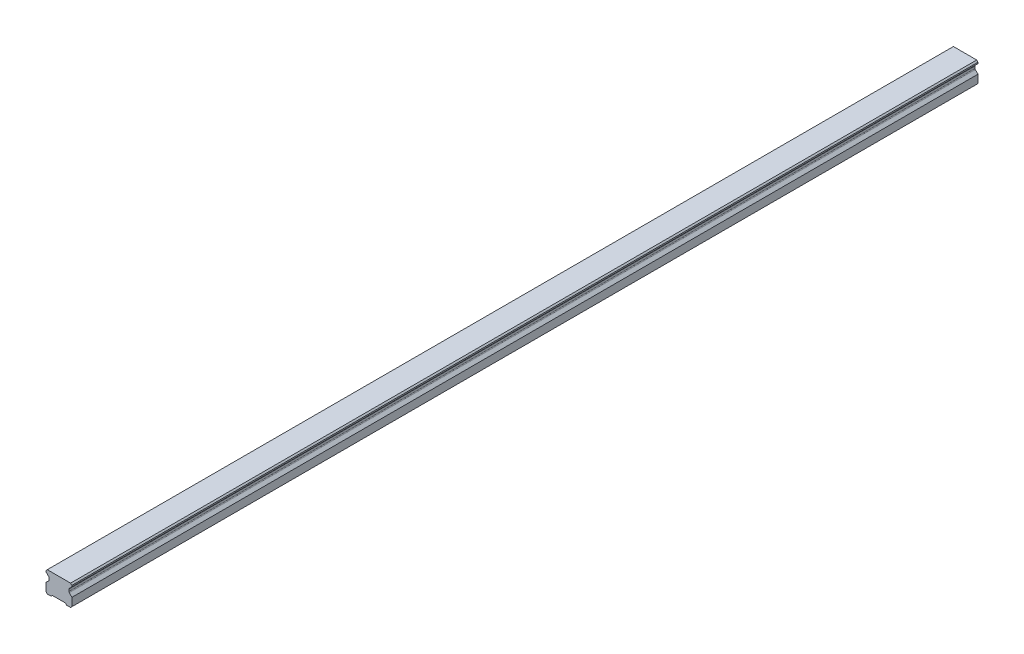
ISO-10303-21;
HEADER;
FILE_DESCRIPTION(('STEP AP214'),'2;1');
FILE_NAME('part.step','',(''),(''),'','','');
FILE_SCHEMA(('AUTOMOTIVE_DESIGN { 1 0 10303 214 1 1 1 1 }'));
ENDSEC;
DATA;
#1=APPLICATION_CONTEXT('core data for automotive mechanical design processes');
#2=APPLICATION_PROTOCOL_DEFINITION('international standard','automotive_design',2000,#1);
#3=PRODUCT_CONTEXT('',#1,'mechanical');
#4=PRODUCT('Part','Part','',(#3));
#5=PRODUCT_RELATED_PRODUCT_CATEGORY('part','',(#4));
#6=PRODUCT_DEFINITION_FORMATION('','',#4);
#7=PRODUCT_DEFINITION_CONTEXT('part definition',#1,'design');
#8=PRODUCT_DEFINITION('design','',#6,#7);
#9=PRODUCT_DEFINITION_SHAPE('','',#8);
#10=(LENGTH_UNIT() NAMED_UNIT(*) SI_UNIT(.MILLI.,.METRE.));
#11=(NAMED_UNIT(*) PLANE_ANGLE_UNIT() SI_UNIT($,.RADIAN.));
#12=(NAMED_UNIT(*) SI_UNIT($,.STERADIAN.) SOLID_ANGLE_UNIT());
#13=UNCERTAINTY_MEASURE_WITH_UNIT(LENGTH_MEASURE(1.E-05),#10,'distance_accuracy_value','');
#14=(GEOMETRIC_REPRESENTATION_CONTEXT(3) GLOBAL_UNCERTAINTY_ASSIGNED_CONTEXT((#13)) GLOBAL_UNIT_ASSIGNED_CONTEXT((#10,
#11,#12)) REPRESENTATION_CONTEXT('',''));
#15=CARTESIAN_POINT('',(0.,0.,0.));
#16=DIRECTION('',(0.,0.,1.));
#17=DIRECTION('',(1.,0.,0.));
#18=AXIS2_PLACEMENT_3D('',#15,#16,#17);
#19=CARTESIAN_POINT('',(0.,10.9999999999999,-330.));
#20=DIRECTION('',(0.,-1.,0.));
#21=DIRECTION('',(0.,0.,-1.));
#22=AXIS2_PLACEMENT_3D('',#19,#20,#21);
#23=PLANE('',#22);
#24=CARTESIAN_POINT('',(0.,10.9999999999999,-330.));
#25=DIRECTION('',(0.,-1.,0.));
#26=DIRECTION('',(0.,0.,-1.));
#27=AXIS2_PLACEMENT_3D('',#24,#25,#26);
#28=CIRCLE('',#27,2.5);
#29=CARTESIAN_POINT('',(0.,10.9999999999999,-332.5));
#30=VERTEX_POINT('',#29);
#31=EDGE_CURVE('E42',#30,#30,#28,.T.);
#32=ORIENTED_EDGE('',*,*,#31,.F.);
#33=EDGE_LOOP('',(#32));
#34=FACE_BOUND('',#33,.T.);
#35=CARTESIAN_POINT('',(0.,10.9999999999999,-330.));
#36=DIRECTION('',(0.,-1.,0.));
#37=DIRECTION('',(0.,0.,-1.));
#38=AXIS2_PLACEMENT_3D('',#35,#36,#37);
#39=CIRCLE('',#38,3.);
#40=CARTESIAN_POINT('',(0.,10.9999999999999,-333.));
#41=VERTEX_POINT('',#40);
#42=EDGE_CURVE('E11',#41,#41,#39,.T.);
#43=ORIENTED_EDGE('',*,*,#42,.T.);
#44=EDGE_LOOP('',(#43));
#45=FACE_BOUND('',#44,.T.);
#46=ADVANCED_FACE('F39',(#34,#45),#23,.T.);
#47=CARTESIAN_POINT('',(0.,10.9999999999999,-330.));
#48=DIRECTION('',(0.,-1.,0.));
#49=DIRECTION('',(0.,0.,-1.));
#50=AXIS2_PLACEMENT_3D('',#47,#48,#49);
#51=CYLINDRICAL_SURFACE('',#50,3.);
#52=ORIENTED_EDGE('',*,*,#42,.F.);
#53=EDGE_LOOP('',(#52));
#54=FACE_BOUND('',#53,.T.);
#55=CARTESIAN_POINT('',(0.,0.999999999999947,-330.));
#56=DIRECTION('',(0.,-1.,0.));
#57=DIRECTION('',(0.,0.,-1.));
#58=AXIS2_PLACEMENT_3D('',#55,#56,#57);
#59=CIRCLE('',#58,3.);
#60=CARTESIAN_POINT('',(0.,0.999999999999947,-333.));
#61=VERTEX_POINT('',#60);
#62=EDGE_CURVE('E48',#61,#61,#59,.T.);
#63=ORIENTED_EDGE('',*,*,#62,.T.);
#64=EDGE_LOOP('',(#63));
#65=FACE_BOUND('',#64,.T.);
#66=ADVANCED_FACE('F671',(#54,#65),#51,.F.);
#67=CARTESIAN_POINT('',(0.,10.9999999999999,-270.));
#68=DIRECTION('',(0.,-1.,0.));
#69=DIRECTION('',(0.,0.,-1.));
#70=AXIS2_PLACEMENT_3D('',#67,#68,#69);
#71=PLANE('',#70);
#72=CARTESIAN_POINT('',(0.,10.9999999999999,-270.));
#73=DIRECTION('',(0.,-1.,0.));
#74=DIRECTION('',(0.,0.,-1.));
#75=AXIS2_PLACEMENT_3D('',#72,#73,#74);
#76=CIRCLE('',#75,2.5);
#77=CARTESIAN_POINT('',(0.,10.9999999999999,-272.5));
#78=VERTEX_POINT('',#77);
#79=EDGE_CURVE('E657',#78,#78,#76,.T.);
#80=ORIENTED_EDGE('',*,*,#79,.F.);
#81=EDGE_LOOP('',(#80));
#82=FACE_BOUND('',#81,.T.);
#83=CARTESIAN_POINT('',(0.,10.9999999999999,-270.));
#84=DIRECTION('',(0.,-1.,0.));
#85=DIRECTION('',(0.,0.,-1.));
#86=AXIS2_PLACEMENT_3D('',#83,#84,#85);
#87=CIRCLE('',#86,3.);
#88=CARTESIAN_POINT('',(0.,10.9999999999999,-273.));
#89=VERTEX_POINT('',#88);
#90=EDGE_CURVE('E620',#89,#89,#87,.T.);
#91=ORIENTED_EDGE('',*,*,#90,.T.);
#92=EDGE_LOOP('',(#91));
#93=FACE_BOUND('',#92,.T.);
#94=ADVANCED_FACE('F676',(#82,#93),#71,.T.);
#95=CARTESIAN_POINT('',(0.,10.9999999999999,-270.));
#96=DIRECTION('',(0.,-1.,0.));
#97=DIRECTION('',(0.,0.,-1.));
#98=AXIS2_PLACEMENT_3D('',#95,#96,#97);
#99=CYLINDRICAL_SURFACE('',#98,3.);
#100=ORIENTED_EDGE('',*,*,#90,.F.);
#101=EDGE_LOOP('',(#100));
#102=FACE_BOUND('',#101,.T.);
#103=CARTESIAN_POINT('',(0.,0.999999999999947,-270.));
#104=DIRECTION('',(0.,-1.,0.));
#105=DIRECTION('',(0.,0.,-1.));
#106=AXIS2_PLACEMENT_3D('',#103,#104,#105);
#107=CIRCLE('',#106,3.);
#108=CARTESIAN_POINT('',(0.,0.999999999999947,-273.));
#109=VERTEX_POINT('',#108);
#110=EDGE_CURVE('E616',#109,#109,#107,.T.);
#111=ORIENTED_EDGE('',*,*,#110,.T.);
#112=EDGE_LOOP('',(#111));
#113=FACE_BOUND('',#112,.T.);
#114=ADVANCED_FACE('F843',(#102,#113),#99,.F.);
#115=CARTESIAN_POINT('',(0.,10.9999999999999,-210.));
#116=DIRECTION('',(0.,-1.,0.));
#117=DIRECTION('',(0.,0.,-1.));
#118=AXIS2_PLACEMENT_3D('',#115,#116,#117);
#119=PLANE('',#118);
#120=CARTESIAN_POINT('',(0.,10.9999999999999,-210.));
#121=DIRECTION('',(0.,-1.,0.));
#122=DIRECTION('',(0.,0.,-1.));
#123=AXIS2_PLACEMENT_3D('',#120,#121,#122);
#124=CIRCLE('',#123,2.5);
#125=CARTESIAN_POINT('',(0.,10.9999999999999,-212.5));
#126=VERTEX_POINT('',#125);
#127=EDGE_CURVE('E654',#126,#126,#124,.T.);
#128=ORIENTED_EDGE('',*,*,#127,.F.);
#129=EDGE_LOOP('',(#128));
#130=FACE_BOUND('',#129,.T.);
#131=CARTESIAN_POINT('',(0.,10.9999999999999,-210.));
#132=DIRECTION('',(0.,-1.,0.));
#133=DIRECTION('',(0.,0.,-1.));
#134=AXIS2_PLACEMENT_3D('',#131,#132,#133);
#135=CIRCLE('',#134,3.);
#136=CARTESIAN_POINT('',(0.,10.9999999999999,-213.));
#137=VERTEX_POINT('',#136);
#138=EDGE_CURVE('E612',#137,#137,#135,.T.);
#139=ORIENTED_EDGE('',*,*,#138,.T.);
#140=EDGE_LOOP('',(#139));
#141=FACE_BOUND('',#140,.T.);
#142=ADVANCED_FACE('F839',(#130,#141),#119,.T.);
#143=CARTESIAN_POINT('',(0.,10.9999999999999,-210.));
#144=DIRECTION('',(0.,-1.,0.));
#145=DIRECTION('',(0.,0.,-1.));
#146=AXIS2_PLACEMENT_3D('',#143,#144,#145);
#147=CYLINDRICAL_SURFACE('',#146,3.);
#148=ORIENTED_EDGE('',*,*,#138,.F.);
#149=EDGE_LOOP('',(#148));
#150=FACE_BOUND('',#149,.T.);
#151=CARTESIAN_POINT('',(0.,0.999999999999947,-210.));
#152=DIRECTION('',(0.,-1.,0.));
#153=DIRECTION('',(0.,0.,-1.));
#154=AXIS2_PLACEMENT_3D('',#151,#152,#153);
#155=CIRCLE('',#154,3.);
#156=CARTESIAN_POINT('',(0.,0.999999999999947,-213.));
#157=VERTEX_POINT('',#156);
#158=EDGE_CURVE('E608',#157,#157,#155,.T.);
#159=ORIENTED_EDGE('',*,*,#158,.T.);
#160=EDGE_LOOP('',(#159));
#161=FACE_BOUND('',#160,.T.);
#162=ADVANCED_FACE('F835',(#150,#161),#147,.F.);
#163=CARTESIAN_POINT('',(0.,10.9999999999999,-150.));
#164=DIRECTION('',(0.,-1.,0.));
#165=DIRECTION('',(0.,0.,-1.));
#166=AXIS2_PLACEMENT_3D('',#163,#164,#165);
#167=PLANE('',#166);
#168=CARTESIAN_POINT('',(0.,10.9999999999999,-150.));
#169=DIRECTION('',(0.,-1.,0.));
#170=DIRECTION('',(0.,0.,-1.));
#171=AXIS2_PLACEMENT_3D('',#168,#169,#170);
#172=CIRCLE('',#171,2.5);
#173=CARTESIAN_POINT('',(0.,10.9999999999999,-152.5));
#174=VERTEX_POINT('',#173);
#175=EDGE_CURVE('E650',#174,#174,#172,.T.);
#176=ORIENTED_EDGE('',*,*,#175,.F.);
#177=EDGE_LOOP('',(#176));
#178=FACE_BOUND('',#177,.T.);
#179=CARTESIAN_POINT('',(0.,10.9999999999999,-150.));
#180=DIRECTION('',(0.,-1.,0.));
#181=DIRECTION('',(0.,0.,-1.));
#182=AXIS2_PLACEMENT_3D('',#179,#180,#181);
#183=CIRCLE('',#182,3.);
#184=CARTESIAN_POINT('',(0.,10.9999999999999,-153.));
#185=VERTEX_POINT('',#184);
#186=EDGE_CURVE('E604',#185,#185,#183,.T.);
#187=ORIENTED_EDGE('',*,*,#186,.T.);
#188=EDGE_LOOP('',(#187));
#189=FACE_BOUND('',#188,.T.);
#190=ADVANCED_FACE('F831',(#178,#189),#167,.T.);
#191=CARTESIAN_POINT('',(0.,10.9999999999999,-150.));
#192=DIRECTION('',(0.,-1.,0.));
#193=DIRECTION('',(0.,0.,-1.));
#194=AXIS2_PLACEMENT_3D('',#191,#192,#193);
#195=CYLINDRICAL_SURFACE('',#194,3.);
#196=ORIENTED_EDGE('',*,*,#186,.F.);
#197=EDGE_LOOP('',(#196));
#198=FACE_BOUND('',#197,.T.);
#199=CARTESIAN_POINT('',(0.,0.999999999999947,-150.));
#200=DIRECTION('',(0.,-1.,0.));
#201=DIRECTION('',(0.,0.,-1.));
#202=AXIS2_PLACEMENT_3D('',#199,#200,#201);
#203=CIRCLE('',#202,3.);
#204=CARTESIAN_POINT('',(0.,0.999999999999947,-153.));
#205=VERTEX_POINT('',#204);
#206=EDGE_CURVE('E600',#205,#205,#203,.T.);
#207=ORIENTED_EDGE('',*,*,#206,.T.);
#208=EDGE_LOOP('',(#207));
#209=FACE_BOUND('',#208,.T.);
#210=ADVANCED_FACE('F827',(#198,#209),#195,.F.);
#211=CARTESIAN_POINT('',(0.,10.9999999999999,-90.));
#212=DIRECTION('',(0.,-1.,0.));
#213=DIRECTION('',(0.,0.,-1.));
#214=AXIS2_PLACEMENT_3D('',#211,#212,#213);
#215=PLANE('',#214);
#216=CARTESIAN_POINT('',(0.,10.9999999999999,-90.));
#217=DIRECTION('',(0.,-1.,0.));
#218=DIRECTION('',(0.,0.,-1.));
#219=AXIS2_PLACEMENT_3D('',#216,#217,#218);
#220=CIRCLE('',#219,2.5);
#221=CARTESIAN_POINT('',(0.,10.9999999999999,-92.5));
#222=VERTEX_POINT('',#221);
#223=EDGE_CURVE('E646',#222,#222,#220,.T.);
#224=ORIENTED_EDGE('',*,*,#223,.F.);
#225=EDGE_LOOP('',(#224));
#226=FACE_BOUND('',#225,.T.);
#227=CARTESIAN_POINT('',(0.,10.9999999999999,-90.));
#228=DIRECTION('',(0.,-1.,0.));
#229=DIRECTION('',(0.,0.,-1.));
#230=AXIS2_PLACEMENT_3D('',#227,#228,#229);
#231=CIRCLE('',#230,3.);
#232=CARTESIAN_POINT('',(0.,10.9999999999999,-93.));
#233=VERTEX_POINT('',#232);
#234=EDGE_CURVE('E596',#233,#233,#231,.T.);
#235=ORIENTED_EDGE('',*,*,#234,.T.);
#236=EDGE_LOOP('',(#235));
#237=FACE_BOUND('',#236,.T.);
#238=ADVANCED_FACE('F823',(#226,#237),#215,.T.);
#239=CARTESIAN_POINT('',(0.,10.9999999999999,-90.));
#240=DIRECTION('',(0.,-1.,0.));
#241=DIRECTION('',(0.,0.,-1.));
#242=AXIS2_PLACEMENT_3D('',#239,#240,#241);
#243=CYLINDRICAL_SURFACE('',#242,3.);
#244=ORIENTED_EDGE('',*,*,#234,.F.);
#245=EDGE_LOOP('',(#244));
#246=FACE_BOUND('',#245,.T.);
#247=CARTESIAN_POINT('',(0.,0.999999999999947,-90.));
#248=DIRECTION('',(0.,-1.,0.));
#249=DIRECTION('',(0.,0.,-1.));
#250=AXIS2_PLACEMENT_3D('',#247,#248,#249);
#251=CIRCLE('',#250,3.);
#252=CARTESIAN_POINT('',(0.,0.999999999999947,-93.));
#253=VERTEX_POINT('',#252);
#254=EDGE_CURVE('E592',#253,#253,#251,.T.);
#255=ORIENTED_EDGE('',*,*,#254,.T.);
#256=EDGE_LOOP('',(#255));
#257=FACE_BOUND('',#256,.T.);
#258=ADVANCED_FACE('F819',(#246,#257),#243,.F.);
#259=CARTESIAN_POINT('',(0.,10.9999999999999,-30.));
#260=DIRECTION('',(0.,-1.,0.));
#261=DIRECTION('',(0.,0.,-1.));
#262=AXIS2_PLACEMENT_3D('',#259,#260,#261);
#263=PLANE('',#262);
#264=CARTESIAN_POINT('',(0.,10.9999999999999,-30.));
#265=DIRECTION('',(0.,-1.,0.));
#266=DIRECTION('',(0.,0.,-1.));
#267=AXIS2_PLACEMENT_3D('',#264,#265,#266);
#268=CIRCLE('',#267,2.5);
#269=CARTESIAN_POINT('',(0.,10.9999999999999,-32.5));
#270=VERTEX_POINT('',#269);
#271=EDGE_CURVE('E642',#270,#270,#268,.T.);
#272=ORIENTED_EDGE('',*,*,#271,.F.);
#273=EDGE_LOOP('',(#272));
#274=FACE_BOUND('',#273,.T.);
#275=CARTESIAN_POINT('',(0.,10.9999999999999,-30.));
#276=DIRECTION('',(0.,-1.,0.));
#277=DIRECTION('',(0.,0.,-1.));
#278=AXIS2_PLACEMENT_3D('',#275,#276,#277);
#279=CIRCLE('',#278,3.);
#280=CARTESIAN_POINT('',(0.,10.9999999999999,-33.));
#281=VERTEX_POINT('',#280);
#282=EDGE_CURVE('E588',#281,#281,#279,.T.);
#283=ORIENTED_EDGE('',*,*,#282,.T.);
#284=EDGE_LOOP('',(#283));
#285=FACE_BOUND('',#284,.T.);
#286=ADVANCED_FACE('F815',(#274,#285),#263,.T.);
#287=CARTESIAN_POINT('',(0.,10.9999999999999,-30.));
#288=DIRECTION('',(0.,-1.,0.));
#289=DIRECTION('',(0.,0.,-1.));
#290=AXIS2_PLACEMENT_3D('',#287,#288,#289);
#291=CYLINDRICAL_SURFACE('',#290,3.);
#292=ORIENTED_EDGE('',*,*,#282,.F.);
#293=EDGE_LOOP('',(#292));
#294=FACE_BOUND('',#293,.T.);
#295=CARTESIAN_POINT('',(0.,0.999999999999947,-30.));
#296=DIRECTION('',(0.,-1.,0.));
#297=DIRECTION('',(0.,0.,-1.));
#298=AXIS2_PLACEMENT_3D('',#295,#296,#297);
#299=CIRCLE('',#298,3.);
#300=CARTESIAN_POINT('',(0.,0.999999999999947,-33.));
#301=VERTEX_POINT('',#300);
#302=EDGE_CURVE('E584',#301,#301,#299,.T.);
#303=ORIENTED_EDGE('',*,*,#302,.T.);
#304=EDGE_LOOP('',(#303));
#305=FACE_BOUND('',#304,.T.);
#306=ADVANCED_FACE('F811',(#294,#305),#291,.F.);
#307=CARTESIAN_POINT('',(0.,10.9999999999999,30.));
#308=DIRECTION('',(0.,-1.,0.));
#309=DIRECTION('',(0.,0.,-1.));
#310=AXIS2_PLACEMENT_3D('',#307,#308,#309);
#311=PLANE('',#310);
#312=CARTESIAN_POINT('',(0.,10.9999999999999,30.));
#313=DIRECTION('',(0.,-1.,0.));
#314=DIRECTION('',(0.,0.,-1.));
#315=AXIS2_PLACEMENT_3D('',#312,#313,#314);
#316=CIRCLE('',#315,2.5);
#317=CARTESIAN_POINT('',(0.,10.9999999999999,27.5));
#318=VERTEX_POINT('',#317);
#319=EDGE_CURVE('E638',#318,#318,#316,.T.);
#320=ORIENTED_EDGE('',*,*,#319,.F.);
#321=EDGE_LOOP('',(#320));
#322=FACE_BOUND('',#321,.T.);
#323=CARTESIAN_POINT('',(0.,10.9999999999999,30.));
#324=DIRECTION('',(0.,-1.,0.));
#325=DIRECTION('',(0.,0.,-1.));
#326=AXIS2_PLACEMENT_3D('',#323,#324,#325);
#327=CIRCLE('',#326,3.);
#328=CARTESIAN_POINT('',(0.,10.9999999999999,27.));
#329=VERTEX_POINT('',#328);
#330=EDGE_CURVE('E580',#329,#329,#327,.T.);
#331=ORIENTED_EDGE('',*,*,#330,.T.);
#332=EDGE_LOOP('',(#331));
#333=FACE_BOUND('',#332,.T.);
#334=ADVANCED_FACE('F807',(#322,#333),#311,.T.);
#335=CARTESIAN_POINT('',(0.,10.9999999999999,30.));
#336=DIRECTION('',(0.,-1.,0.));
#337=DIRECTION('',(0.,0.,-1.));
#338=AXIS2_PLACEMENT_3D('',#335,#336,#337);
#339=CYLINDRICAL_SURFACE('',#338,3.);
#340=ORIENTED_EDGE('',*,*,#330,.F.);
#341=EDGE_LOOP('',(#340));
#342=FACE_BOUND('',#341,.T.);
#343=CARTESIAN_POINT('',(0.,0.999999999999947,30.));
#344=DIRECTION('',(0.,-1.,0.));
#345=DIRECTION('',(0.,0.,-1.));
#346=AXIS2_PLACEMENT_3D('',#343,#344,#345);
#347=CIRCLE('',#346,3.);
#348=CARTESIAN_POINT('',(0.,0.999999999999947,27.));
#349=VERTEX_POINT('',#348);
#350=EDGE_CURVE('E576',#349,#349,#347,.T.);
#351=ORIENTED_EDGE('',*,*,#350,.T.);
#352=EDGE_LOOP('',(#351));
#353=FACE_BOUND('',#352,.T.);
#354=ADVANCED_FACE('F803',(#342,#353),#339,.F.);
#355=CARTESIAN_POINT('',(0.,10.9999999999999,90.));
#356=DIRECTION('',(0.,-1.,0.));
#357=DIRECTION('',(0.,0.,-1.));
#358=AXIS2_PLACEMENT_3D('',#355,#356,#357);
#359=PLANE('',#358);
#360=CARTESIAN_POINT('',(0.,10.9999999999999,90.));
#361=DIRECTION('',(0.,-1.,0.));
#362=DIRECTION('',(0.,0.,-1.));
#363=AXIS2_PLACEMENT_3D('',#360,#361,#362);
#364=CIRCLE('',#363,2.5);
#365=CARTESIAN_POINT('',(0.,10.9999999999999,87.5));
#366=VERTEX_POINT('',#365);
#367=EDGE_CURVE('E634',#366,#366,#364,.T.);
#368=ORIENTED_EDGE('',*,*,#367,.F.);
#369=EDGE_LOOP('',(#368));
#370=FACE_BOUND('',#369,.T.);
#371=CARTESIAN_POINT('',(0.,10.9999999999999,90.));
#372=DIRECTION('',(0.,-1.,0.));
#373=DIRECTION('',(0.,0.,-1.));
#374=AXIS2_PLACEMENT_3D('',#371,#372,#373);
#375=CIRCLE('',#374,3.);
#376=CARTESIAN_POINT('',(0.,10.9999999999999,87.));
#377=VERTEX_POINT('',#376);
#378=EDGE_CURVE('E572',#377,#377,#375,.T.);
#379=ORIENTED_EDGE('',*,*,#378,.T.);
#380=EDGE_LOOP('',(#379));
#381=FACE_BOUND('',#380,.T.);
#382=ADVANCED_FACE('F799',(#370,#381),#359,.T.);
#383=CARTESIAN_POINT('',(0.,10.9999999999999,90.));
#384=DIRECTION('',(0.,-1.,0.));
#385=DIRECTION('',(0.,0.,-1.));
#386=AXIS2_PLACEMENT_3D('',#383,#384,#385);
#387=CYLINDRICAL_SURFACE('',#386,3.);
#388=ORIENTED_EDGE('',*,*,#378,.F.);
#389=EDGE_LOOP('',(#388));
#390=FACE_BOUND('',#389,.T.);
#391=CARTESIAN_POINT('',(0.,0.999999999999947,90.));
#392=DIRECTION('',(0.,-1.,0.));
#393=DIRECTION('',(0.,0.,-1.));
#394=AXIS2_PLACEMENT_3D('',#391,#392,#393);
#395=CIRCLE('',#394,3.);
#396=CARTESIAN_POINT('',(0.,0.999999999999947,87.));
#397=VERTEX_POINT('',#396);
#398=EDGE_CURVE('E568',#397,#397,#395,.T.);
#399=ORIENTED_EDGE('',*,*,#398,.T.);
#400=EDGE_LOOP('',(#399));
#401=FACE_BOUND('',#400,.T.);
#402=ADVANCED_FACE('F795',(#390,#401),#387,.F.);
#403=CARTESIAN_POINT('',(0.,10.9999999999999,150.));
#404=DIRECTION('',(0.,-1.,0.));
#405=DIRECTION('',(0.,0.,-1.));
#406=AXIS2_PLACEMENT_3D('',#403,#404,#405);
#407=PLANE('',#406);
#408=CARTESIAN_POINT('',(0.,10.9999999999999,150.));
#409=DIRECTION('',(0.,-1.,0.));
#410=DIRECTION('',(0.,0.,-1.));
#411=AXIS2_PLACEMENT_3D('',#408,#409,#410);
#412=CIRCLE('',#411,2.5);
#413=CARTESIAN_POINT('',(0.,10.9999999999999,147.5));
#414=VERTEX_POINT('',#413);
#415=EDGE_CURVE('E630',#414,#414,#412,.T.);
#416=ORIENTED_EDGE('',*,*,#415,.F.);
#417=EDGE_LOOP('',(#416));
#418=FACE_BOUND('',#417,.T.);
#419=CARTESIAN_POINT('',(0.,10.9999999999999,150.));
#420=DIRECTION('',(0.,-1.,0.));
#421=DIRECTION('',(0.,0.,-1.));
#422=AXIS2_PLACEMENT_3D('',#419,#420,#421);
#423=CIRCLE('',#422,3.);
#424=CARTESIAN_POINT('',(0.,10.9999999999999,147.));
#425=VERTEX_POINT('',#424);
#426=EDGE_CURVE('E564',#425,#425,#423,.T.);
#427=ORIENTED_EDGE('',*,*,#426,.T.);
#428=EDGE_LOOP('',(#427));
#429=FACE_BOUND('',#428,.T.);
#430=ADVANCED_FACE('F791',(#418,#429),#407,.T.);
#431=CARTESIAN_POINT('',(0.,10.9999999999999,150.));
#432=DIRECTION('',(0.,-1.,0.));
#433=DIRECTION('',(0.,0.,-1.));
#434=AXIS2_PLACEMENT_3D('',#431,#432,#433);
#435=CYLINDRICAL_SURFACE('',#434,3.);
#436=ORIENTED_EDGE('',*,*,#426,.F.);
#437=EDGE_LOOP('',(#436));
#438=FACE_BOUND('',#437,.T.);
#439=CARTESIAN_POINT('',(0.,0.999999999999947,150.));
#440=DIRECTION('',(0.,-1.,0.));
#441=DIRECTION('',(0.,0.,-1.));
#442=AXIS2_PLACEMENT_3D('',#439,#440,#441);
#443=CIRCLE('',#442,3.);
#444=CARTESIAN_POINT('',(0.,0.999999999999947,147.));
#445=VERTEX_POINT('',#444);
#446=EDGE_CURVE('E560',#445,#445,#443,.T.);
#447=ORIENTED_EDGE('',*,*,#446,.T.);
#448=EDGE_LOOP('',(#447));
#449=FACE_BOUND('',#448,.T.);
#450=ADVANCED_FACE('F787',(#438,#449),#435,.F.);
#451=CARTESIAN_POINT('',(0.,10.9999999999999,210.));
#452=DIRECTION('',(0.,-1.,0.));
#453=DIRECTION('',(0.,0.,-1.));
#454=AXIS2_PLACEMENT_3D('',#451,#452,#453);
#455=PLANE('',#454);
#456=CARTESIAN_POINT('',(0.,10.9999999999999,210.));
#457=DIRECTION('',(0.,-1.,0.));
#458=DIRECTION('',(0.,0.,-1.));
#459=AXIS2_PLACEMENT_3D('',#456,#457,#458);
#460=CIRCLE('',#459,2.5);
#461=CARTESIAN_POINT('',(0.,10.9999999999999,207.5));
#462=VERTEX_POINT('',#461);
#463=EDGE_CURVE('E253',#462,#462,#460,.T.);
#464=ORIENTED_EDGE('',*,*,#463,.F.);
#465=EDGE_LOOP('',(#464));
#466=FACE_BOUND('',#465,.T.);
#467=CARTESIAN_POINT('',(0.,10.9999999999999,210.));
#468=DIRECTION('',(0.,-1.,0.));
#469=DIRECTION('',(0.,0.,-1.));
#470=AXIS2_PLACEMENT_3D('',#467,#468,#469);
#471=CIRCLE('',#470,3.);
#472=CARTESIAN_POINT('',(0.,10.9999999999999,207.));
#473=VERTEX_POINT('',#472);
#474=EDGE_CURVE('E556',#473,#473,#471,.T.);
#475=ORIENTED_EDGE('',*,*,#474,.T.);
#476=EDGE_LOOP('',(#475));
#477=FACE_BOUND('',#476,.T.);
#478=ADVANCED_FACE('F783',(#466,#477),#455,.T.);
#479=CARTESIAN_POINT('',(0.,10.9999999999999,210.));
#480=DIRECTION('',(0.,-1.,0.));
#481=DIRECTION('',(0.,0.,-1.));
#482=AXIS2_PLACEMENT_3D('',#479,#480,#481);
#483=CYLINDRICAL_SURFACE('',#482,3.);
#484=ORIENTED_EDGE('',*,*,#474,.F.);
#485=EDGE_LOOP('',(#484));
#486=FACE_BOUND('',#485,.T.);
#487=CARTESIAN_POINT('',(0.,0.999999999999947,210.));
#488=DIRECTION('',(0.,-1.,0.));
#489=DIRECTION('',(0.,0.,-1.));
#490=AXIS2_PLACEMENT_3D('',#487,#488,#489);
#491=CIRCLE('',#490,3.);
#492=CARTESIAN_POINT('',(0.,0.999999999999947,207.));
#493=VERTEX_POINT('',#492);
#494=EDGE_CURVE('E552',#493,#493,#491,.T.);
#495=ORIENTED_EDGE('',*,*,#494,.T.);
#496=EDGE_LOOP('',(#495));
#497=FACE_BOUND('',#496,.T.);
#498=ADVANCED_FACE('F780',(#486,#497),#483,.F.);
#499=CARTESIAN_POINT('',(10.,0.,350.));
#500=DIRECTION('',(0.,1.,0.));
#501=DIRECTION('',(-1.,0.,0.));
#502=AXIS2_PLACEMENT_3D('',#499,#500,#501);
#503=PLANE('',#502);
#504=DIRECTION('',(1.,0.,0.));
#505=VECTOR('',#504,1.);
#506=CARTESIAN_POINT('',(10.,0.,-350.));
#507=LINE('',#506,#505);
#508=CARTESIAN_POINT('',(-8.99999999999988,0.,-350.));
#509=VERTEX_POINT('',#508);
#510=CARTESIAN_POINT('',(-5.99999999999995,0.,-350.));
#511=VERTEX_POINT('',#510);
#512=EDGE_CURVE('E435',#509,#511,#507,.T.);
#513=ORIENTED_EDGE('',*,*,#512,.T.);
#514=DIRECTION('',(0.,0.,1.));
#515=VECTOR('',#514,1.);
#516=CARTESIAN_POINT('',(-5.99999999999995,0.,-350.));
#517=LINE('',#516,#515);
#518=CARTESIAN_POINT('',(-5.99999999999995,0.,350.));
#519=VERTEX_POINT('',#518);
#520=EDGE_CURVE('E340',#511,#519,#517,.T.);
#521=ORIENTED_EDGE('',*,*,#520,.T.);
#522=DIRECTION('',(1.,0.,0.));
#523=VECTOR('',#522,1.);
#524=CARTESIAN_POINT('',(10.,0.,350.));
#525=LINE('',#524,#523);
#526=CARTESIAN_POINT('',(-8.99999999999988,0.,350.));
#527=VERTEX_POINT('',#526);
#528=EDGE_CURVE('E416',#527,#519,#525,.T.);
#529=ORIENTED_EDGE('',*,*,#528,.F.);
#530=DIRECTION('',(0.,0.,-1.));
#531=VECTOR('',#530,1.);
#532=CARTESIAN_POINT('',(-8.99999999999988,0.,350.));
#533=LINE('',#532,#531);
#534=EDGE_CURVE('E487',#527,#509,#533,.T.);
#535=ORIENTED_EDGE('',*,*,#534,.T.);
#536=EDGE_LOOP('',(#513,#521,#529,#535));
#537=FACE_BOUND('',#536,.T.);
#538=ADVANCED_FACE('F745',(#537),#503,.F.);
#539=CARTESIAN_POINT('',(-10.,16.3,350.));
#540=DIRECTION('',(1.,0.,0.));
#541=DIRECTION('',(0.,1.,0.));
#542=AXIS2_PLACEMENT_3D('',#539,#540,#541);
#543=PLANE('',#542);
#544=DIRECTION('',(0.,-1.,0.));
#545=VECTOR('',#544,1.);
#546=CARTESIAN_POINT('',(-10.,16.3,350.));
#547=LINE('',#546,#545);
#548=CARTESIAN_POINT('',(-10.,15.3,350.));
#549=VERTEX_POINT('',#548);
#550=CARTESIAN_POINT('',(-10.,14.3,350.));
#551=VERTEX_POINT('',#550);
#552=EDGE_CURVE('E410',#549,#551,#547,.T.);
#553=ORIENTED_EDGE('',*,*,#552,.F.);
#554=DIRECTION('',(0.,0.,-1.));
#555=VECTOR('',#554,1.);
#556=CARTESIAN_POINT('',(-10.,15.3,350.));
#557=LINE('',#556,#555);
#558=CARTESIAN_POINT('',(-10.,15.3,-350.));
#559=VERTEX_POINT('',#558);
#560=EDGE_CURVE('E429',#549,#559,#557,.T.);
#561=ORIENTED_EDGE('',*,*,#560,.T.);
#562=DIRECTION('',(0.,-1.,0.));
#563=VECTOR('',#562,1.);
#564=CARTESIAN_POINT('',(-10.,16.3,-350.));
#565=LINE('',#564,#563);
#566=CARTESIAN_POINT('',(-10.,14.3,-350.));
#567=VERTEX_POINT('',#566);
#568=EDGE_CURVE('E430',#559,#567,#565,.T.);
#569=ORIENTED_EDGE('',*,*,#568,.T.);
#570=DIRECTION('',(0.,0.,1.));
#571=VECTOR('',#570,1.);
#572=CARTESIAN_POINT('',(-10.,14.3,-350.));
#573=LINE('',#572,#571);
#574=EDGE_CURVE('E364',#567,#551,#573,.T.);
#575=ORIENTED_EDGE('',*,*,#574,.T.);
#576=EDGE_LOOP('',(#553,#561,#569,#575));
#577=FACE_BOUND('',#576,.T.);
#578=ADVANCED_FACE('F749',(#577),#543,.F.);
#579=CARTESIAN_POINT('',(10.,16.3,350.));
#580=DIRECTION('',(-1.,0.,0.));
#581=DIRECTION('',(0.,-1.,0.));
#582=AXIS2_PLACEMENT_3D('',#579,#580,#581);
#583=PLANE('',#582);
#584=DIRECTION('',(0.,1.,0.));
#585=VECTOR('',#584,1.);
#586=CARTESIAN_POINT('',(10.,16.3,350.));
#587=LINE('',#586,#585);
#588=CARTESIAN_POINT('',(10.,1.00000000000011,350.));
#589=VERTEX_POINT('',#588);
#590=CARTESIAN_POINT('',(10.,7.3,350.));
#591=VERTEX_POINT('',#590);
#592=EDGE_CURVE('E421',#589,#591,#587,.T.);
#593=ORIENTED_EDGE('',*,*,#592,.F.);
#594=DIRECTION('',(0.,0.,-1.));
#595=VECTOR('',#594,1.);
#596=CARTESIAN_POINT('',(10.,1.00000000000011,350.));
#597=LINE('',#596,#595);
#598=CARTESIAN_POINT('',(10.,1.00000000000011,-350.));
#599=VERTEX_POINT('',#598);
#600=EDGE_CURVE('E494',#589,#599,#597,.T.);
#601=ORIENTED_EDGE('',*,*,#600,.T.);
#602=DIRECTION('',(0.,1.,0.));
#603=VECTOR('',#602,1.);
#604=CARTESIAN_POINT('',(10.,16.3,-350.));
#605=LINE('',#604,#603);
#606=CARTESIAN_POINT('',(10.,7.3,-350.));
#607=VERTEX_POINT('',#606);
#608=EDGE_CURVE('E440',#599,#607,#605,.T.);
#609=ORIENTED_EDGE('',*,*,#608,.T.);
#610=DIRECTION('',(0.,0.,1.));
#611=VECTOR('',#610,1.);
#612=CARTESIAN_POINT('',(10.,7.3,-350.));
#613=LINE('',#612,#611);
#614=EDGE_CURVE('E395',#607,#591,#613,.T.);
#615=ORIENTED_EDGE('',*,*,#614,.T.);
#616=EDGE_LOOP('',(#593,#601,#609,#615));
#617=FACE_BOUND('',#616,.T.);
#618=ADVANCED_FACE('F740',(#617),#583,.F.);
#619=CARTESIAN_POINT('',(-10.,7.3,-350.));
#620=VERTEX_POINT('',#619);
#621=CARTESIAN_POINT('',(-10.,1.00000000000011,-350.));
#622=VERTEX_POINT('',#621);
#623=EDGE_CURVE('E379',#620,#622,#565,.T.);
#624=ORIENTED_EDGE('',*,*,#623,.T.);
#625=DIRECTION('',(0.,0.,1.));
#626=VECTOR('',#625,1.);
#627=CARTESIAN_POINT('',(-10.,1.00000000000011,350.));
#628=LINE('',#627,#626);
#629=CARTESIAN_POINT('',(-10.,1.00000000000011,350.));
#630=VERTEX_POINT('',#629);
#631=EDGE_CURVE('E491',#622,#630,#628,.T.);
#632=ORIENTED_EDGE('',*,*,#631,.T.);
#633=CARTESIAN_POINT('',(-10.,7.3,350.));
#634=VERTEX_POINT('',#633);
#635=EDGE_CURVE('E415',#634,#630,#547,.T.);
#636=ORIENTED_EDGE('',*,*,#635,.F.);
#637=DIRECTION('',(0.,0.,1.));
#638=VECTOR('',#637,1.);
#639=CARTESIAN_POINT('',(-10.,7.3,-350.));
#640=LINE('',#639,#638);
#641=EDGE_CURVE('E376',#620,#634,#640,.T.);
#642=ORIENTED_EDGE('',*,*,#641,.F.);
#643=EDGE_LOOP('',(#624,#632,#636,#642));
#644=FACE_BOUND('',#643,.T.);
#645=ADVANCED_FACE('F743',(#644),#543,.F.);
#646=CARTESIAN_POINT('',(5.99999999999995,0.,350.));
#647=VERTEX_POINT('',#646);
#648=CARTESIAN_POINT('',(8.99999999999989,0.,350.));
#649=VERTEX_POINT('',#648);
#650=EDGE_CURVE('E414',#647,#649,#525,.T.);
#651=ORIENTED_EDGE('',*,*,#650,.F.);
#652=DIRECTION('',(0.,0.,1.));
#653=VECTOR('',#652,1.);
#654=CARTESIAN_POINT('',(5.99999999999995,0.,-350.));
#655=LINE('',#654,#653);
#656=CARTESIAN_POINT('',(5.99999999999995,0.,-350.));
#657=VERTEX_POINT('',#656);
#658=EDGE_CURVE('E330',#657,#647,#655,.T.);
#659=ORIENTED_EDGE('',*,*,#658,.F.);
#660=CARTESIAN_POINT('',(8.99999999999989,0.,-350.));
#661=VERTEX_POINT('',#660);
#662=EDGE_CURVE('E434',#657,#661,#507,.T.);
#663=ORIENTED_EDGE('',*,*,#662,.T.);
#664=DIRECTION('',(0.,0.,1.));
#665=VECTOR('',#664,1.);
#666=CARTESIAN_POINT('',(8.99999999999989,0.,350.));
#667=LINE('',#666,#665);
#668=EDGE_CURVE('E483',#661,#649,#667,.T.);
#669=ORIENTED_EDGE('',*,*,#668,.T.);
#670=EDGE_LOOP('',(#651,#659,#663,#669));
#671=FACE_BOUND('',#670,.T.);
#672=ADVANCED_FACE('F738',(#671),#503,.F.);
#673=CARTESIAN_POINT('',(10.,14.3,-350.));
#674=VERTEX_POINT('',#673);
#675=CARTESIAN_POINT('',(10.,15.2999999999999,-350.));
#676=VERTEX_POINT('',#675);
#677=EDGE_CURVE('E439',#674,#676,#605,.T.);
#678=ORIENTED_EDGE('',*,*,#677,.T.);
#679=DIRECTION('',(0.,0.,1.));
#680=VECTOR('',#679,1.);
#681=CARTESIAN_POINT('',(10.,15.2999999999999,350.));
#682=LINE('',#681,#680);
#683=CARTESIAN_POINT('',(10.,15.2999999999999,350.));
#684=VERTEX_POINT('',#683);
#685=EDGE_CURVE('E498',#676,#684,#682,.T.);
#686=ORIENTED_EDGE('',*,*,#685,.T.);
#687=CARTESIAN_POINT('',(10.,14.3,350.));
#688=VERTEX_POINT('',#687);
#689=EDGE_CURVE('E420',#688,#684,#587,.T.);
#690=ORIENTED_EDGE('',*,*,#689,.F.);
#691=DIRECTION('',(0.,0.,1.));
#692=VECTOR('',#691,1.);
#693=CARTESIAN_POINT('',(10.,14.3,-350.));
#694=LINE('',#693,#692);
#695=EDGE_CURVE('E369',#674,#688,#694,.T.);
#696=ORIENTED_EDGE('',*,*,#695,.F.);
#697=EDGE_LOOP('',(#678,#686,#690,#696));
#698=FACE_BOUND('',#697,.T.);
#699=ADVANCED_FACE('F734',(#698),#583,.F.);
#700=CARTESIAN_POINT('',(10.,16.3,350.));
#701=DIRECTION('',(0.,-1.,0.));
#702=DIRECTION('',(0.,0.,-1.));
#703=AXIS2_PLACEMENT_3D('',#700,#701,#702);
#704=PLANE('',#703);
#705=DIRECTION('',(-1.,0.,0.));
#706=VECTOR('',#705,1.);
#707=CARTESIAN_POINT('',(10.,16.3,-350.));
#708=LINE('',#707,#706);
#709=CARTESIAN_POINT('',(8.99999999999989,16.3,-350.));
#710=VERTEX_POINT('',#709);
#711=CARTESIAN_POINT('',(-9.00000000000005,16.3,-350.));
#712=VERTEX_POINT('',#711);
#713=EDGE_CURVE('E444',#710,#712,#708,.T.);
#714=ORIENTED_EDGE('',*,*,#713,.T.);
#715=DIRECTION('',(0.,0.,1.));
#716=VECTOR('',#715,1.);
#717=CARTESIAN_POINT('',(-9.00000000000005,16.3,350.));
#718=LINE('',#717,#716);
#719=CARTESIAN_POINT('',(-9.00000000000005,16.3,350.));
#720=VERTEX_POINT('',#719);
#721=EDGE_CURVE('E468',#712,#720,#718,.T.);
#722=ORIENTED_EDGE('',*,*,#721,.T.);
#723=DIRECTION('',(-1.,0.,0.));
#724=VECTOR('',#723,1.);
#725=CARTESIAN_POINT('',(10.,16.3,350.));
#726=LINE('',#725,#724);
#727=CARTESIAN_POINT('',(8.99999999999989,16.3,350.));
#728=VERTEX_POINT('',#727);
#729=EDGE_CURVE('E425',#728,#720,#726,.T.);
#730=ORIENTED_EDGE('',*,*,#729,.F.);
#731=DIRECTION('',(0.,0.,-1.));
#732=VECTOR('',#731,1.);
#733=CARTESIAN_POINT('',(8.99999999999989,16.3,350.));
#734=LINE('',#733,#732);
#735=EDGE_CURVE('E464',#728,#710,#734,.T.);
#736=ORIENTED_EDGE('',*,*,#735,.T.);
#737=EDGE_LOOP('',(#714,#722,#730,#736));
#738=FACE_BOUND('',#737,.T.);
#739=ADVANCED_FACE('F728',(#738),#704,.F.);
#740=CARTESIAN_POINT('',(0.,0.,350.));
#741=DIRECTION('',(0.,0.,-1.));
#742=DIRECTION('',(-1.,0.,0.));
#743=AXIS2_PLACEMENT_3D('',#740,#741,#742);
#744=PLANE('',#743);
#745=ORIENTED_EDGE('',*,*,#528,.T.);
#746=DIRECTION('',(-0.707106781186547,-0.707106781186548,0.));
#747=VECTOR('',#746,1.);
#748=CARTESIAN_POINT('',(-5.99999999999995,0.,350.));
#749=LINE('',#748,#747);
#750=CARTESIAN_POINT('',(-5.,0.999999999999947,350.));
#751=VERTEX_POINT('',#750);
#752=EDGE_CURVE('E324',#751,#519,#749,.T.);
#753=ORIENTED_EDGE('',*,*,#752,.F.);
#754=DIRECTION('',(-1.,0.,0.));
#755=VECTOR('',#754,1.);
#756=CARTESIAN_POINT('',(-5.,0.999999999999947,350.));
#757=LINE('',#756,#755);
#758=CARTESIAN_POINT('',(5.,0.999999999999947,350.));
#759=VERTEX_POINT('',#758);
#760=EDGE_CURVE('E334',#759,#751,#757,.T.);
#761=ORIENTED_EDGE('',*,*,#760,.F.);
#762=DIRECTION('',(-0.707106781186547,0.707106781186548,0.));
#763=VECTOR('',#762,1.);
#764=CARTESIAN_POINT('',(5.,0.999999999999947,350.));
#765=LINE('',#764,#763);
#766=EDGE_CURVE('E316',#647,#759,#765,.T.);
#767=ORIENTED_EDGE('',*,*,#766,.F.);
#768=ORIENTED_EDGE('',*,*,#650,.T.);
#769=DIRECTION('',(-0.707106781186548,-0.707106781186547,0.));
#770=VECTOR('',#769,1.);
#771=CARTESIAN_POINT('',(10.,1.00000000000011,350.));
#772=LINE('',#771,#770);
#773=EDGE_CURVE('E474',#649,#589,#772,.F.);
#774=ORIENTED_EDGE('',*,*,#773,.T.);
#775=ORIENTED_EDGE('',*,*,#592,.T.);
#776=DIRECTION('',(0.707106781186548,-0.707106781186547,0.));
#777=VECTOR('',#776,1.);
#778=CARTESIAN_POINT('',(10.,7.3,350.));
#779=LINE('',#778,#777);
#780=CARTESIAN_POINT('',(7.95955988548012,9.34044011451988,350.));
#781=VERTEX_POINT('',#780);
#782=EDGE_CURVE('E344',#781,#591,#779,.T.);
#783=ORIENTED_EDGE('',*,*,#782,.F.);
#784=CARTESIAN_POINT('',(8.66666666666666,10.0475468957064,350.));
#785=DIRECTION('',(0.,0.,-1.));
#786=DIRECTION('',(-1.,0.,0.));
#787=AXIS2_PLACEMENT_3D('',#784,#785,#786);
#788=CIRCLE('',#787,1.);
#789=CARTESIAN_POINT('',(7.66666666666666,10.0475468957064,350.));
#790=VERTEX_POINT('',#789);
#791=EDGE_CURVE('E529',#781,#790,#788,.T.);
#792=ORIENTED_EDGE('',*,*,#791,.T.);
#793=DIRECTION('',(0.,-1.,0.));
#794=VECTOR('',#793,1.);
#795=CARTESIAN_POINT('',(7.66666666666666,9.63333333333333,350.));
#796=LINE('',#795,#794);
#797=CARTESIAN_POINT('',(7.66666666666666,11.5524531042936,350.));
#798=VERTEX_POINT('',#797);
#799=EDGE_CURVE('E387',#798,#790,#796,.T.);
#800=ORIENTED_EDGE('',*,*,#799,.F.);
#801=CARTESIAN_POINT('',(8.66666666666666,11.5524531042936,350.));
#802=DIRECTION('',(0.,0.,-1.));
#803=DIRECTION('',(-1.,0.,0.));
#804=AXIS2_PLACEMENT_3D('',#801,#802,#803);
#805=CIRCLE('',#804,1.);
#806=CARTESIAN_POINT('',(7.95955988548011,12.2595598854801,350.));
#807=VERTEX_POINT('',#806);
#808=EDGE_CURVE('E535',#798,#807,#805,.T.);
#809=ORIENTED_EDGE('',*,*,#808,.T.);
#810=DIRECTION('',(-0.707106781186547,-0.707106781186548,0.));
#811=VECTOR('',#810,1.);
#812=CARTESIAN_POINT('',(7.66666666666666,11.9666666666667,350.));
#813=LINE('',#812,#811);
#814=EDGE_CURVE('E398',#688,#807,#813,.T.);
#815=ORIENTED_EDGE('',*,*,#814,.F.);
#816=ORIENTED_EDGE('',*,*,#689,.T.);
#817=DIRECTION('',(0.707106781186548,-0.707106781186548,0.));
#818=VECTOR('',#817,1.);
#819=CARTESIAN_POINT('',(8.99999999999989,16.3,350.));
#820=LINE('',#819,#818);
#821=EDGE_CURVE('E471',#684,#728,#820,.F.);
#822=ORIENTED_EDGE('',*,*,#821,.T.);
#823=ORIENTED_EDGE('',*,*,#729,.T.);
#824=DIRECTION('',(0.707106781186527,0.707106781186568,0.));
#825=VECTOR('',#824,1.);
#826=CARTESIAN_POINT('',(-10.,15.3,350.));
#827=LINE('',#826,#825);
#828=EDGE_CURVE('E480',#720,#549,#827,.F.);
#829=ORIENTED_EDGE('',*,*,#828,.T.);
#830=ORIENTED_EDGE('',*,*,#552,.T.);
#831=DIRECTION('',(-0.707106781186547,0.707106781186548,0.));
#832=VECTOR('',#831,1.);
#833=CARTESIAN_POINT('',(-7.66666666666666,11.9666666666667,350.));
#834=LINE('',#833,#832);
#835=CARTESIAN_POINT('',(-7.95955988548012,12.2595598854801,350.));
#836=VERTEX_POINT('',#835);
#837=EDGE_CURVE('E365',#836,#551,#834,.T.);
#838=ORIENTED_EDGE('',*,*,#837,.F.);
#839=CARTESIAN_POINT('',(-8.66666666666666,11.5524531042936,350.));
#840=DIRECTION('',(0.,0.,-1.));
#841=DIRECTION('',(-1.,0.,0.));
#842=AXIS2_PLACEMENT_3D('',#839,#840,#841);
#843=CIRCLE('',#842,1.);
#844=CARTESIAN_POINT('',(-7.66666666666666,11.5524531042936,350.));
#845=VERTEX_POINT('',#844);
#846=EDGE_CURVE('E547',#836,#845,#843,.T.);
#847=ORIENTED_EDGE('',*,*,#846,.T.);
#848=DIRECTION('',(0.,1.,0.));
#849=VECTOR('',#848,1.);
#850=CARTESIAN_POINT('',(-7.66666666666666,9.63333333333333,350.));
#851=LINE('',#850,#849);
#852=CARTESIAN_POINT('',(-7.66666666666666,10.0475468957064,350.));
#853=VERTEX_POINT('',#852);
#854=EDGE_CURVE('E357',#853,#845,#851,.T.);
#855=ORIENTED_EDGE('',*,*,#854,.F.);
#856=CARTESIAN_POINT('',(-8.66666666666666,10.0475468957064,350.));
#857=DIRECTION('',(0.,0.,-1.));
#858=DIRECTION('',(-1.,0.,0.));
#859=AXIS2_PLACEMENT_3D('',#856,#857,#858);
#860=CIRCLE('',#859,1.);
#861=CARTESIAN_POINT('',(-7.95955988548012,9.34044011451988,350.));
#862=VERTEX_POINT('',#861);
#863=EDGE_CURVE('E541',#853,#862,#860,.T.);
#864=ORIENTED_EDGE('',*,*,#863,.T.);
#865=DIRECTION('',(0.707106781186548,0.707106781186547,0.));
#866=VECTOR('',#865,1.);
#867=CARTESIAN_POINT('',(-10.,7.3,350.));
#868=LINE('',#867,#866);
#869=EDGE_CURVE('E368',#634,#862,#868,.T.);
#870=ORIENTED_EDGE('',*,*,#869,.F.);
#871=ORIENTED_EDGE('',*,*,#635,.T.);
#872=DIRECTION('',(-0.707106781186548,0.707106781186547,0.));
#873=VECTOR('',#872,1.);
#874=CARTESIAN_POINT('',(-8.99999999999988,0.,350.));
#875=LINE('',#874,#873);
#876=EDGE_CURVE('E477',#630,#527,#875,.F.);
#877=ORIENTED_EDGE('',*,*,#876,.T.);
#878=EDGE_LOOP('',(#745,#753,#761,#767,#768,#774,#775,#783,#792,#800,#809,#815,#816,#822,#823,
#829,#830,#838,#847,#855,#864,#870,#871,#877));
#879=FACE_BOUND('',#878,.T.);
#880=ADVANCED_FACE('F725',(#879),#744,.F.);
#881=CARTESIAN_POINT('',(0.,0.,-350.));
#882=DIRECTION('',(0.,0.,-1.));
#883=DIRECTION('',(-1.,0.,0.));
#884=AXIS2_PLACEMENT_3D('',#881,#882,#883);
#885=PLANE('',#884);
#886=DIRECTION('',(-0.707106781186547,-0.707106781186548,0.));
#887=VECTOR('',#886,1.);
#888=CARTESIAN_POINT('',(-5.99999999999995,0.,-350.));
#889=LINE('',#888,#887);
#890=CARTESIAN_POINT('',(-5.,0.999999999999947,-350.));
#891=VERTEX_POINT('',#890);
#892=EDGE_CURVE('E326',#891,#511,#889,.T.);
#893=ORIENTED_EDGE('',*,*,#892,.T.);
#894=ORIENTED_EDGE('',*,*,#512,.F.);
#895=DIRECTION('',(0.707106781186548,-0.707106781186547,0.));
#896=VECTOR('',#895,1.);
#897=CARTESIAN_POINT('',(-4.49999999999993,-4.49999999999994,-350.));
#898=LINE('',#897,#896);
#899=EDGE_CURVE('E458',#509,#622,#898,.F.);
#900=ORIENTED_EDGE('',*,*,#899,.T.);
#901=ORIENTED_EDGE('',*,*,#623,.F.);
#902=DIRECTION('',(0.707106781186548,0.707106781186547,0.));
#903=VECTOR('',#902,1.);
#904=CARTESIAN_POINT('',(-10.,7.3,-350.));
#905=LINE('',#904,#903);
#906=CARTESIAN_POINT('',(-7.95955988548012,9.34044011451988,-350.));
#907=VERTEX_POINT('',#906);
#908=EDGE_CURVE('E356',#620,#907,#905,.T.);
#909=ORIENTED_EDGE('',*,*,#908,.T.);
#910=CARTESIAN_POINT('',(-8.66666666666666,10.0475468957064,-350.));
#911=DIRECTION('',(0.,0.,-1.));
#912=DIRECTION('',(-1.,0.,0.));
#913=AXIS2_PLACEMENT_3D('',#910,#911,#912);
#914=CIRCLE('',#913,1.);
#915=CARTESIAN_POINT('',(-7.66666666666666,10.0475468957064,-350.));
#916=VERTEX_POINT('',#915);
#917=EDGE_CURVE('E544',#907,#916,#914,.F.);
#918=ORIENTED_EDGE('',*,*,#917,.T.);
#919=DIRECTION('',(0.,1.,0.));
#920=VECTOR('',#919,1.);
#921=CARTESIAN_POINT('',(-7.66666666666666,9.63333333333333,-350.));
#922=LINE('',#921,#920);
#923=CARTESIAN_POINT('',(-7.66666666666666,11.5524531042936,-350.));
#924=VERTEX_POINT('',#923);
#925=EDGE_CURVE('E361',#916,#924,#922,.T.);
#926=ORIENTED_EDGE('',*,*,#925,.T.);
#927=CARTESIAN_POINT('',(-8.66666666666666,11.5524531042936,-350.));
#928=DIRECTION('',(0.,0.,-1.));
#929=DIRECTION('',(-1.,0.,0.));
#930=AXIS2_PLACEMENT_3D('',#927,#928,#929);
#931=CIRCLE('',#930,1.);
#932=CARTESIAN_POINT('',(-7.95955988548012,12.2595598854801,-350.));
#933=VERTEX_POINT('',#932);
#934=EDGE_CURVE('E64',#924,#933,#931,.F.);
#935=ORIENTED_EDGE('',*,*,#934,.T.);
#936=DIRECTION('',(-0.707106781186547,0.707106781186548,0.));
#937=VECTOR('',#936,1.);
#938=CARTESIAN_POINT('',(-7.66666666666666,11.9666666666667,-350.));
#939=LINE('',#938,#937);
#940=EDGE_CURVE('E353',#933,#567,#939,.T.);
#941=ORIENTED_EDGE('',*,*,#940,.T.);
#942=ORIENTED_EDGE('',*,*,#568,.F.);
#943=DIRECTION('',(-0.707106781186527,-0.707106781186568,0.));
#944=VECTOR('',#943,1.);
#945=CARTESIAN_POINT('',(-12.6500000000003,12.6499999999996,-350.));
#946=LINE('',#945,#944);
#947=EDGE_CURVE('E461',#559,#712,#946,.F.);
#948=ORIENTED_EDGE('',*,*,#947,.T.);
#949=ORIENTED_EDGE('',*,*,#713,.F.);
#950=DIRECTION('',(-0.707106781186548,0.707106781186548,0.));
#951=VECTOR('',#950,1.);
#952=CARTESIAN_POINT('',(12.6499999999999,12.6499999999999,-350.));
#953=LINE('',#952,#951);
#954=EDGE_CURVE('E451',#710,#676,#953,.F.);
#955=ORIENTED_EDGE('',*,*,#954,.T.);
#956=ORIENTED_EDGE('',*,*,#677,.F.);
#957=DIRECTION('',(-0.707106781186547,-0.707106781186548,0.));
#958=VECTOR('',#957,1.);
#959=CARTESIAN_POINT('',(7.66666666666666,11.9666666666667,-350.));
#960=LINE('',#959,#958);
#961=CARTESIAN_POINT('',(7.95955988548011,12.2595598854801,-350.));
#962=VERTEX_POINT('',#961);
#963=EDGE_CURVE('E386',#674,#962,#960,.T.);
#964=ORIENTED_EDGE('',*,*,#963,.T.);
#965=CARTESIAN_POINT('',(8.66666666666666,11.5524531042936,-350.));
#966=DIRECTION('',(0.,0.,-1.));
#967=DIRECTION('',(-1.,0.,0.));
#968=AXIS2_PLACEMENT_3D('',#965,#966,#967);
#969=CIRCLE('',#968,1.);
#970=CARTESIAN_POINT('',(7.66666666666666,11.5524531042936,-350.));
#971=VERTEX_POINT('',#970);
#972=EDGE_CURVE('E538',#962,#971,#969,.F.);
#973=ORIENTED_EDGE('',*,*,#972,.T.);
#974=DIRECTION('',(0.,-1.,0.));
#975=VECTOR('',#974,1.);
#976=CARTESIAN_POINT('',(7.66666666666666,9.63333333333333,-350.));
#977=LINE('',#976,#975);
#978=CARTESIAN_POINT('',(7.66666666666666,10.0475468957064,-350.));
#979=VERTEX_POINT('',#978);
#980=EDGE_CURVE('E391',#971,#979,#977,.T.);
#981=ORIENTED_EDGE('',*,*,#980,.T.);
#982=CARTESIAN_POINT('',(8.66666666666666,10.0475468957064,-350.));
#983=DIRECTION('',(0.,0.,-1.));
#984=DIRECTION('',(-1.,0.,0.));
#985=AXIS2_PLACEMENT_3D('',#982,#983,#984);
#986=CIRCLE('',#985,1.);
#987=CARTESIAN_POINT('',(7.95955988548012,9.34044011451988,-350.));
#988=VERTEX_POINT('',#987);
#989=EDGE_CURVE('E532',#979,#988,#986,.F.);
#990=ORIENTED_EDGE('',*,*,#989,.T.);
#991=DIRECTION('',(0.707106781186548,-0.707106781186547,0.));
#992=VECTOR('',#991,1.);
#993=CARTESIAN_POINT('',(10.,7.3,-350.));
#994=LINE('',#993,#992);
#995=EDGE_CURVE('E383',#988,#607,#994,.T.);
#996=ORIENTED_EDGE('',*,*,#995,.T.);
#997=ORIENTED_EDGE('',*,*,#608,.F.);
#998=DIRECTION('',(0.707106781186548,0.707106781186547,0.));
#999=VECTOR('',#998,1.);
#1000=CARTESIAN_POINT('',(4.49999999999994,-4.49999999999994,-350.));
#1001=LINE('',#1000,#999);
#1002=EDGE_CURVE('E454',#599,#661,#1001,.F.);
#1003=ORIENTED_EDGE('',*,*,#1002,.T.);
#1004=ORIENTED_EDGE('',*,*,#662,.F.);
#1005=DIRECTION('',(-0.707106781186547,0.707106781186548,0.));
#1006=VECTOR('',#1005,1.);
#1007=CARTESIAN_POINT('',(5.,0.999999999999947,-350.));
#1008=LINE('',#1007,#1006);
#1009=CARTESIAN_POINT('',(5.,0.999999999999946,-350.));
#1010=VERTEX_POINT('',#1009);
#1011=EDGE_CURVE('E320',#657,#1010,#1008,.T.);
#1012=ORIENTED_EDGE('',*,*,#1011,.T.);
#1013=DIRECTION('',(-1.,0.,0.));
#1014=VECTOR('',#1013,1.);
#1015=CARTESIAN_POINT('',(-5.,0.999999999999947,-350.));
#1016=LINE('',#1015,#1014);
#1017=EDGE_CURVE('E56',#1010,#891,#1016,.T.);
#1018=ORIENTED_EDGE('',*,*,#1017,.T.);
#1019=EDGE_LOOP('',(#893,#894,#900,#901,#909,#918,#926,#935,#941,#942,#948,#949,#955,#956,#964,
#973,#981,#990,#996,#997,#1003,#1004,#1012,#1018));
#1020=FACE_BOUND('',#1019,.T.);
#1021=ADVANCED_FACE('F723',(#1020),#885,.T.);
#1022=CARTESIAN_POINT('',(10.,7.3,-350.));
#1023=DIRECTION('',(-0.707106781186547,-0.707106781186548,0.));
#1024=DIRECTION('',(0.707106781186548,-0.707106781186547,0.));
#1025=AXIS2_PLACEMENT_3D('',#1022,#1023,#1024);
#1026=PLANE('',#1025);
#1027=ORIENTED_EDGE('',*,*,#995,.F.);
#1028=DIRECTION('',(0.,0.,1.));
#1029=VECTOR('',#1028,1.);
#1030=CARTESIAN_POINT('',(7.95955988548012,9.34044011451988,350.));
#1031=LINE('',#1030,#1029);
#1032=EDGE_CURVE('E501',#988,#781,#1031,.T.);
#1033=ORIENTED_EDGE('',*,*,#1032,.T.);
#1034=ORIENTED_EDGE('',*,*,#782,.T.);
#1035=ORIENTED_EDGE('',*,*,#614,.F.);
#1036=EDGE_LOOP('',(#1027,#1033,#1034,#1035));
#1037=FACE_BOUND('',#1036,.T.);
#1038=ADVANCED_FACE('F716',(#1037),#1026,.F.);
#1039=CARTESIAN_POINT('',(7.66666666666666,9.63333333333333,-350.));
#1040=DIRECTION('',(-1.,0.,0.));
#1041=DIRECTION('',(0.,-1.,0.));
#1042=AXIS2_PLACEMENT_3D('',#1039,#1040,#1041);
#1043=PLANE('',#1042);
#1044=ORIENTED_EDGE('',*,*,#799,.T.);
#1045=DIRECTION('',(0.,0.,1.));
#1046=VECTOR('',#1045,1.);
#1047=CARTESIAN_POINT('',(7.66666666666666,10.0475468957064,-350.));
#1048=LINE('',#1047,#1046);
#1049=EDGE_CURVE('E509',#790,#979,#1048,.F.);
#1050=ORIENTED_EDGE('',*,*,#1049,.T.);
#1051=ORIENTED_EDGE('',*,*,#980,.F.);
#1052=DIRECTION('',(0.,0.,1.));
#1053=VECTOR('',#1052,1.);
#1054=CARTESIAN_POINT('',(7.66666666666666,11.5524531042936,350.));
#1055=LINE('',#1054,#1053);
#1056=EDGE_CURVE('E505',#971,#798,#1055,.T.);
#1057=ORIENTED_EDGE('',*,*,#1056,.T.);
#1058=EDGE_LOOP('',(#1044,#1050,#1051,#1057));
#1059=FACE_BOUND('',#1058,.T.);
#1060=ADVANCED_FACE('F713',(#1059),#1043,.F.);
#1061=CARTESIAN_POINT('',(7.66666666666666,11.9666666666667,-350.));
#1062=DIRECTION('',(-0.707106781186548,0.707106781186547,0.));
#1063=DIRECTION('',(-0.707106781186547,-0.707106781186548,0.));
#1064=AXIS2_PLACEMENT_3D('',#1061,#1062,#1063);
#1065=PLANE('',#1064);
#1066=ORIENTED_EDGE('',*,*,#814,.T.);
#1067=DIRECTION('',(0.,0.,1.));
#1068=VECTOR('',#1067,1.);
#1069=CARTESIAN_POINT('',(7.95955988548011,12.2595598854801,-350.));
#1070=LINE('',#1069,#1068);
#1071=EDGE_CURVE('E512',#807,#962,#1070,.F.);
#1072=ORIENTED_EDGE('',*,*,#1071,.T.);
#1073=ORIENTED_EDGE('',*,*,#963,.F.);
#1074=ORIENTED_EDGE('',*,*,#695,.T.);
#1075=EDGE_LOOP('',(#1066,#1072,#1073,#1074));
#1076=FACE_BOUND('',#1075,.T.);
#1077=ADVANCED_FACE('F711',(#1076),#1065,.F.);
#1078=CARTESIAN_POINT('',(-7.66666666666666,11.9666666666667,-350.));
#1079=DIRECTION('',(0.707106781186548,0.707106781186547,0.));
#1080=DIRECTION('',(-0.707106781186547,0.707106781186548,0.));
#1081=AXIS2_PLACEMENT_3D('',#1078,#1079,#1080);
#1082=PLANE('',#1081);
#1083=ORIENTED_EDGE('',*,*,#940,.F.);
#1084=DIRECTION('',(0.,0.,1.));
#1085=VECTOR('',#1084,1.);
#1086=CARTESIAN_POINT('',(-7.95955988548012,12.2595598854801,350.));
#1087=LINE('',#1086,#1085);
#1088=EDGE_CURVE('E525',#933,#836,#1087,.T.);
#1089=ORIENTED_EDGE('',*,*,#1088,.T.);
#1090=ORIENTED_EDGE('',*,*,#837,.T.);
#1091=ORIENTED_EDGE('',*,*,#574,.F.);
#1092=EDGE_LOOP('',(#1083,#1089,#1090,#1091));
#1093=FACE_BOUND('',#1092,.T.);
#1094=ADVANCED_FACE('F703',(#1093),#1082,.F.);
#1095=CARTESIAN_POINT('',(-7.66666666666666,9.63333333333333,-350.));
#1096=DIRECTION('',(1.,0.,0.));
#1097=DIRECTION('',(0.,1.,0.));
#1098=AXIS2_PLACEMENT_3D('',#1095,#1096,#1097);
#1099=PLANE('',#1098);
#1100=ORIENTED_EDGE('',*,*,#925,.F.);
#1101=DIRECTION('',(0.,0.,1.));
#1102=VECTOR('',#1101,1.);
#1103=CARTESIAN_POINT('',(-7.66666666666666,10.0475468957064,350.));
#1104=LINE('',#1103,#1102);
#1105=EDGE_CURVE('E518',#916,#853,#1104,.T.);
#1106=ORIENTED_EDGE('',*,*,#1105,.T.);
#1107=ORIENTED_EDGE('',*,*,#854,.T.);
#1108=DIRECTION('',(0.,0.,1.));
#1109=VECTOR('',#1108,1.);
#1110=CARTESIAN_POINT('',(-7.66666666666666,11.5524531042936,-350.));
#1111=LINE('',#1110,#1109);
#1112=EDGE_CURVE('E515',#845,#924,#1111,.F.);
#1113=ORIENTED_EDGE('',*,*,#1112,.T.);
#1114=EDGE_LOOP('',(#1100,#1106,#1107,#1113));
#1115=FACE_BOUND('',#1114,.T.);
#1116=ADVANCED_FACE('F699',(#1115),#1099,.F.);
#1117=CARTESIAN_POINT('',(-10.,7.3,-350.));
#1118=DIRECTION('',(0.707106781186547,-0.707106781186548,0.));
#1119=DIRECTION('',(0.707106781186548,0.707106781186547,0.));
#1120=AXIS2_PLACEMENT_3D('',#1117,#1118,#1119);
#1121=PLANE('',#1120);
#1122=ORIENTED_EDGE('',*,*,#869,.T.);
#1123=DIRECTION('',(0.,0.,1.));
#1124=VECTOR('',#1123,1.);
#1125=CARTESIAN_POINT('',(-7.95955988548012,9.34044011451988,-350.));
#1126=LINE('',#1125,#1124);
#1127=EDGE_CURVE('E522',#862,#907,#1126,.F.);
#1128=ORIENTED_EDGE('',*,*,#1127,.T.);
#1129=ORIENTED_EDGE('',*,*,#908,.F.);
#1130=ORIENTED_EDGE('',*,*,#641,.T.);
#1131=EDGE_LOOP('',(#1122,#1128,#1129,#1130));
#1132=FACE_BOUND('',#1131,.T.);
#1133=ADVANCED_FACE('F702',(#1132),#1121,.F.);
#1134=CARTESIAN_POINT('',(-10.,15.3,350.));
#1135=DIRECTION('',(0.707106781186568,-0.707106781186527,0.));
#1136=DIRECTION('',(0.,0.,-1.));
#1137=AXIS2_PLACEMENT_3D('',#1134,#1135,#1136);
#1138=PLANE('',#1137);
#1139=ORIENTED_EDGE('',*,*,#828,.F.);
#1140=ORIENTED_EDGE('',*,*,#721,.F.);
#1141=ORIENTED_EDGE('',*,*,#947,.F.);
#1142=ORIENTED_EDGE('',*,*,#560,.F.);
#1143=EDGE_LOOP('',(#1139,#1140,#1141,#1142));
#1144=FACE_BOUND('',#1143,.T.);
#1145=ADVANCED_FACE('F707',(#1144),#1138,.F.);
#1146=CARTESIAN_POINT('',(-8.99999999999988,0.,350.));
#1147=DIRECTION('',(0.707106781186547,0.707106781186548,0.));
#1148=DIRECTION('',(0.,0.,-1.));
#1149=AXIS2_PLACEMENT_3D('',#1146,#1147,#1148);
#1150=PLANE('',#1149);
#1151=ORIENTED_EDGE('',*,*,#876,.F.);
#1152=ORIENTED_EDGE('',*,*,#631,.F.);
#1153=ORIENTED_EDGE('',*,*,#899,.F.);
#1154=ORIENTED_EDGE('',*,*,#534,.F.);
#1155=EDGE_LOOP('',(#1151,#1152,#1153,#1154));
#1156=FACE_BOUND('',#1155,.T.);
#1157=ADVANCED_FACE('F752',(#1156),#1150,.F.);
#1158=CARTESIAN_POINT('',(10.,1.00000000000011,350.));
#1159=DIRECTION('',(-0.707106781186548,0.707106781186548,0.));
#1160=DIRECTION('',(0.,0.,-1.));
#1161=AXIS2_PLACEMENT_3D('',#1158,#1159,#1160);
#1162=PLANE('',#1161);
#1163=ORIENTED_EDGE('',*,*,#773,.F.);
#1164=ORIENTED_EDGE('',*,*,#668,.F.);
#1165=ORIENTED_EDGE('',*,*,#1002,.F.);
#1166=ORIENTED_EDGE('',*,*,#600,.F.);
#1167=EDGE_LOOP('',(#1163,#1164,#1165,#1166));
#1168=FACE_BOUND('',#1167,.T.);
#1169=ADVANCED_FACE('F756',(#1168),#1162,.F.);
#1170=CARTESIAN_POINT('',(8.99999999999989,16.3,350.));
#1171=DIRECTION('',(-0.707106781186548,-0.707106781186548,0.));
#1172=DIRECTION('',(0.,0.,-1.));
#1173=AXIS2_PLACEMENT_3D('',#1170,#1171,#1172);
#1174=PLANE('',#1173);
#1175=ORIENTED_EDGE('',*,*,#821,.F.);
#1176=ORIENTED_EDGE('',*,*,#685,.F.);
#1177=ORIENTED_EDGE('',*,*,#954,.F.);
#1178=ORIENTED_EDGE('',*,*,#735,.F.);
#1179=EDGE_LOOP('',(#1175,#1176,#1177,#1178));
#1180=FACE_BOUND('',#1179,.T.);
#1181=ADVANCED_FACE('F760',(#1180),#1174,.F.);
#1182=CARTESIAN_POINT('',(8.66666666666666,10.0475468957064,-350.));
#1183=DIRECTION('',(0.,0.,-1.));
#1184=DIRECTION('',(-1.,0.,0.));
#1185=AXIS2_PLACEMENT_3D('',#1182,#1183,#1184);
#1186=CYLINDRICAL_SURFACE('',#1185,1.);
#1187=ORIENTED_EDGE('',*,*,#989,.F.);
#1188=ORIENTED_EDGE('',*,*,#1049,.F.);
#1189=ORIENTED_EDGE('',*,*,#791,.F.);
#1190=ORIENTED_EDGE('',*,*,#1032,.F.);
#1191=EDGE_LOOP('',(#1187,#1188,#1189,#1190));
#1192=FACE_BOUND('',#1191,.T.);
#1193=ADVANCED_FACE('F764',(#1192),#1186,.F.);
#1194=CARTESIAN_POINT('',(8.66666666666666,11.5524531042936,-350.));
#1195=DIRECTION('',(0.,0.,-1.));
#1196=DIRECTION('',(-1.,0.,0.));
#1197=AXIS2_PLACEMENT_3D('',#1194,#1195,#1196);
#1198=CYLINDRICAL_SURFACE('',#1197,1.);
#1199=ORIENTED_EDGE('',*,*,#972,.F.);
#1200=ORIENTED_EDGE('',*,*,#1071,.F.);
#1201=ORIENTED_EDGE('',*,*,#808,.F.);
#1202=ORIENTED_EDGE('',*,*,#1056,.F.);
#1203=EDGE_LOOP('',(#1199,#1200,#1201,#1202));
#1204=FACE_BOUND('',#1203,.T.);
#1205=ADVANCED_FACE('F768',(#1204),#1198,.F.);
#1206=CARTESIAN_POINT('',(-8.66666666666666,10.0475468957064,-350.));
#1207=DIRECTION('',(0.,0.,-1.));
#1208=DIRECTION('',(-1.,0.,0.));
#1209=AXIS2_PLACEMENT_3D('',#1206,#1207,#1208);
#1210=CYLINDRICAL_SURFACE('',#1209,1.);
#1211=ORIENTED_EDGE('',*,*,#917,.F.);
#1212=ORIENTED_EDGE('',*,*,#1127,.F.);
#1213=ORIENTED_EDGE('',*,*,#863,.F.);
#1214=ORIENTED_EDGE('',*,*,#1105,.F.);
#1215=EDGE_LOOP('',(#1211,#1212,#1213,#1214));
#1216=FACE_BOUND('',#1215,.T.);
#1217=ADVANCED_FACE('F772',(#1216),#1210,.F.);
#1218=CARTESIAN_POINT('',(-8.66666666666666,11.5524531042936,-350.));
#1219=DIRECTION('',(0.,0.,-1.));
#1220=DIRECTION('',(-1.,0.,0.));
#1221=AXIS2_PLACEMENT_3D('',#1218,#1219,#1220);
#1222=CYLINDRICAL_SURFACE('',#1221,1.);
#1223=ORIENTED_EDGE('',*,*,#934,.F.);
#1224=ORIENTED_EDGE('',*,*,#1112,.F.);
#1225=ORIENTED_EDGE('',*,*,#846,.F.);
#1226=ORIENTED_EDGE('',*,*,#1088,.F.);
#1227=EDGE_LOOP('',(#1223,#1224,#1225,#1226));
#1228=FACE_BOUND('',#1227,.T.);
#1229=ADVANCED_FACE('F692',(#1228),#1222,.F.);
#1230=CARTESIAN_POINT('',(-5.99999999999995,0.,-350.));
#1231=DIRECTION('',(-0.707106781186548,0.707106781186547,0.));
#1232=DIRECTION('',(-0.707106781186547,-0.707106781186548,0.));
#1233=AXIS2_PLACEMENT_3D('',#1230,#1231,#1232);
#1234=PLANE('',#1233);
#1235=ORIENTED_EDGE('',*,*,#752,.T.);
#1236=ORIENTED_EDGE('',*,*,#520,.F.);
#1237=ORIENTED_EDGE('',*,*,#892,.F.);
#1238=DIRECTION('',(0.,0.,1.));
#1239=VECTOR('',#1238,1.);
#1240=CARTESIAN_POINT('',(-5.,0.999999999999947,-350.));
#1241=LINE('',#1240,#1239);
#1242=EDGE_CURVE('E345',#891,#751,#1241,.T.);
#1243=ORIENTED_EDGE('',*,*,#1242,.T.);
#1244=EDGE_LOOP('',(#1235,#1236,#1237,#1243));
#1245=FACE_BOUND('',#1244,.T.);
#1246=ADVANCED_FACE('F682',(#1245),#1234,.F.);
#1247=CARTESIAN_POINT('',(-5.,0.999999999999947,-350.));
#1248=DIRECTION('',(0.,1.,0.));
#1249=DIRECTION('',(0.,0.,1.));
#1250=AXIS2_PLACEMENT_3D('',#1247,#1248,#1249);
#1251=PLANE('',#1250);
#1252=CARTESIAN_POINT('',(0.,0.999999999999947,270.));
#1253=DIRECTION('',(0.,-1.,0.));
#1254=DIRECTION('',(0.,0.,-1.));
#1255=AXIS2_PLACEMENT_3D('',#1252,#1253,#1254);
#1256=CIRCLE('',#1255,3.);
#1257=CARTESIAN_POINT('',(0.,0.999999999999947,267.));
#1258=VERTEX_POINT('',#1257);
#1259=EDGE_CURVE('E295',#1258,#1258,#1256,.T.);
#1260=ORIENTED_EDGE('',*,*,#1259,.F.);
#1261=EDGE_LOOP('',(#1260));
#1262=FACE_BOUND('',#1261,.T.);
#1263=CARTESIAN_POINT('',(0.,0.999999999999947,330.));
#1264=DIRECTION('',(0.,-1.,0.));
#1265=DIRECTION('',(0.,0.,-1.));
#1266=AXIS2_PLACEMENT_3D('',#1263,#1264,#1265);
#1267=CIRCLE('',#1266,3.);
#1268=CARTESIAN_POINT('',(0.,0.999999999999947,327.));
#1269=VERTEX_POINT('',#1268);
#1270=EDGE_CURVE('E311',#1269,#1269,#1267,.T.);
#1271=ORIENTED_EDGE('',*,*,#1270,.F.);
#1272=EDGE_LOOP('',(#1271));
#1273=FACE_BOUND('',#1272,.T.);
#1274=ORIENTED_EDGE('',*,*,#760,.T.);
#1275=ORIENTED_EDGE('',*,*,#1242,.F.);
#1276=ORIENTED_EDGE('',*,*,#1017,.F.);
#1277=DIRECTION('',(0.,0.,1.));
#1278=VECTOR('',#1277,1.);
#1279=CARTESIAN_POINT('',(5.,0.999999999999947,-350.));
#1280=LINE('',#1279,#1278);
#1281=EDGE_CURVE('E348',#1010,#759,#1280,.T.);
#1282=ORIENTED_EDGE('',*,*,#1281,.T.);
#1283=EDGE_LOOP('',(#1274,#1275,#1276,#1282));
#1284=FACE_BOUND('',#1283,.T.);
#1285=ORIENTED_EDGE('',*,*,#494,.F.);
#1286=EDGE_LOOP('',(#1285));
#1287=FACE_BOUND('',#1286,.T.);
#1288=ORIENTED_EDGE('',*,*,#446,.F.);
#1289=EDGE_LOOP('',(#1288));
#1290=FACE_BOUND('',#1289,.T.);
#1291=ORIENTED_EDGE('',*,*,#398,.F.);
#1292=EDGE_LOOP('',(#1291));
#1293=FACE_BOUND('',#1292,.T.);
#1294=ORIENTED_EDGE('',*,*,#350,.F.);
#1295=EDGE_LOOP('',(#1294));
#1296=FACE_BOUND('',#1295,.T.);
#1297=ORIENTED_EDGE('',*,*,#302,.F.);
#1298=EDGE_LOOP('',(#1297));
#1299=FACE_BOUND('',#1298,.T.);
#1300=ORIENTED_EDGE('',*,*,#254,.F.);
#1301=EDGE_LOOP('',(#1300));
#1302=FACE_BOUND('',#1301,.T.);
#1303=ORIENTED_EDGE('',*,*,#206,.F.);
#1304=EDGE_LOOP('',(#1303));
#1305=FACE_BOUND('',#1304,.T.);
#1306=ORIENTED_EDGE('',*,*,#158,.F.);
#1307=EDGE_LOOP('',(#1306));
#1308=FACE_BOUND('',#1307,.T.);
#1309=ORIENTED_EDGE('',*,*,#110,.F.);
#1310=EDGE_LOOP('',(#1309));
#1311=FACE_BOUND('',#1310,.T.);
#1312=ORIENTED_EDGE('',*,*,#62,.F.);
#1313=EDGE_LOOP('',(#1312));
#1314=FACE_BOUND('',#1313,.T.);
#1315=ADVANCED_FACE('F679',(#1262,#1273,#1284,#1287,#1290,#1293,#1296,#1299,#1302,#1305,#1308,
#1311,#1314),#1251,.F.);
#1316=CARTESIAN_POINT('',(5.,0.999999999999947,-350.));
#1317=DIRECTION('',(0.707106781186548,0.707106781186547,0.));
#1318=DIRECTION('',(-0.707106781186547,0.707106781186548,0.));
#1319=AXIS2_PLACEMENT_3D('',#1316,#1317,#1318);
#1320=PLANE('',#1319);
#1321=ORIENTED_EDGE('',*,*,#766,.T.);
#1322=ORIENTED_EDGE('',*,*,#1281,.F.);
#1323=ORIENTED_EDGE('',*,*,#1011,.F.);
#1324=ORIENTED_EDGE('',*,*,#658,.T.);
#1325=EDGE_LOOP('',(#1321,#1322,#1323,#1324));
#1326=FACE_BOUND('',#1325,.T.);
#1327=ADVANCED_FACE('F681',(#1326),#1320,.F.);
#1328=CARTESIAN_POINT('',(0.,10.9999999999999,330.));
#1329=DIRECTION('',(0.,-1.,0.));
#1330=DIRECTION('',(0.,0.,-1.));
#1331=AXIS2_PLACEMENT_3D('',#1328,#1329,#1330);
#1332=CYLINDRICAL_SURFACE('',#1331,3.);
#1333=CARTESIAN_POINT('',(0.,10.9999999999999,330.));
#1334=DIRECTION('',(0.,-1.,0.));
#1335=DIRECTION('',(0.,0.,-1.));
#1336=AXIS2_PLACEMENT_3D('',#1333,#1334,#1335);
#1337=CIRCLE('',#1336,3.);
#1338=CARTESIAN_POINT('',(0.,10.9999999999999,327.));
#1339=VERTEX_POINT('',#1338);
#1340=EDGE_CURVE('E312',#1339,#1339,#1337,.T.);
#1341=ORIENTED_EDGE('',*,*,#1340,.F.);
#1342=EDGE_LOOP('',(#1341));
#1343=FACE_BOUND('',#1342,.T.);
#1344=ORIENTED_EDGE('',*,*,#1270,.T.);
#1345=EDGE_LOOP('',(#1344));
#1346=FACE_BOUND('',#1345,.T.);
#1347=ADVANCED_FACE('F689',(#1343,#1346),#1332,.F.);
#1348=CARTESIAN_POINT('',(0.,10.9999999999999,330.));
#1349=DIRECTION('',(0.,-1.,0.));
#1350=DIRECTION('',(0.,0.,-1.));
#1351=AXIS2_PLACEMENT_3D('',#1348,#1349,#1350);
#1352=PLANE('',#1351);
#1353=CARTESIAN_POINT('',(0.,10.9999999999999,330.));
#1354=DIRECTION('',(0.,-1.,0.));
#1355=DIRECTION('',(0.,0.,-1.));
#1356=AXIS2_PLACEMENT_3D('',#1353,#1354,#1355);
#1357=CIRCLE('',#1356,2.5);
#1358=CARTESIAN_POINT('',(0.,10.9999999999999,327.5));
#1359=VERTEX_POINT('',#1358);
#1360=EDGE_CURVE('E307',#1359,#1359,#1357,.T.);
#1361=ORIENTED_EDGE('',*,*,#1360,.F.);
#1362=EDGE_LOOP('',(#1361));
#1363=FACE_BOUND('',#1362,.T.);
#1364=ORIENTED_EDGE('',*,*,#1340,.T.);
#1365=EDGE_LOOP('',(#1364));
#1366=FACE_BOUND('',#1365,.T.);
#1367=ADVANCED_FACE('F1004',(#1363,#1366),#1352,.T.);
#1368=CARTESIAN_POINT('',(0.,13.9999999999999,330.));
#1369=DIRECTION('',(0.,-1.,0.));
#1370=DIRECTION('',(0.,0.,-1.));
#1371=AXIS2_PLACEMENT_3D('',#1368,#1369,#1370);
#1372=CYLINDRICAL_SURFACE('',#1371,2.5);
#1373=CARTESIAN_POINT('',(0.,13.9999999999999,330.));
#1374=DIRECTION('',(0.,-1.,0.));
#1375=DIRECTION('',(0.,0.,-1.));
#1376=AXIS2_PLACEMENT_3D('',#1373,#1374,#1375);
#1377=CIRCLE('',#1376,2.5);
#1378=CARTESIAN_POINT('',(0.,13.9999999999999,327.5));
#1379=VERTEX_POINT('',#1378);
#1380=EDGE_CURVE('E303',#1379,#1379,#1377,.T.);
#1381=CARTESIAN_POINT('',(0.,10.9999999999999,327.5));
#1382=CARTESIAN_POINT('',(0.,11.0312499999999,327.5));
#1383=CARTESIAN_POINT('',(0.,11.0624999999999,327.5));
#1384=CARTESIAN_POINT('',(0.,11.1249999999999,327.5));
#1385=CARTESIAN_POINT('',(0.,11.1562499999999,327.5));
#1386=CARTESIAN_POINT('',(0.,11.2187499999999,327.5));
#1387=CARTESIAN_POINT('',(0.,11.2499999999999,327.5));
#1388=CARTESIAN_POINT('',(0.,11.3124999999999,327.5));
#1389=CARTESIAN_POINT('',(0.,11.3437499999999,327.5));
#1390=CARTESIAN_POINT('',(0.,11.4062499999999,327.5));
#1391=CARTESIAN_POINT('',(0.,11.4374999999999,327.5));
#1392=CARTESIAN_POINT('',(0.,11.4999999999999,327.5));
#1393=CARTESIAN_POINT('',(0.,11.5312499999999,327.5));
#1394=CARTESIAN_POINT('',(0.,11.5937499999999,327.5));
#1395=CARTESIAN_POINT('',(0.,11.6249999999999,327.5));
#1396=CARTESIAN_POINT('',(0.,11.6874999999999,327.5));
#1397=CARTESIAN_POINT('',(0.,11.7187499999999,327.5));
#1398=CARTESIAN_POINT('',(0.,11.7812499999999,327.5));
#1399=CARTESIAN_POINT('',(0.,11.8124999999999,327.5));
#1400=CARTESIAN_POINT('',(0.,11.8749999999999,327.5));
#1401=CARTESIAN_POINT('',(0.,11.9062499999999,327.5));
#1402=CARTESIAN_POINT('',(0.,11.9687499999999,327.5));
#1403=CARTESIAN_POINT('',(0.,11.9999999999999,327.5));
#1404=CARTESIAN_POINT('',(0.,12.0624999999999,327.5));
#1405=CARTESIAN_POINT('',(0.,12.0937499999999,327.5));
#1406=CARTESIAN_POINT('',(0.,12.1562499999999,327.5));
#1407=CARTESIAN_POINT('',(0.,12.1874999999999,327.5));
#1408=CARTESIAN_POINT('',(0.,12.2499999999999,327.5));
#1409=CARTESIAN_POINT('',(0.,12.2812499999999,327.5));
#1410=CARTESIAN_POINT('',(0.,12.3437499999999,327.5));
#1411=CARTESIAN_POINT('',(0.,12.3749999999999,327.5));
#1412=CARTESIAN_POINT('',(0.,12.4374999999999,327.5));
#1413=CARTESIAN_POINT('',(0.,12.4687499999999,327.5));
#1414=CARTESIAN_POINT('',(0.,12.5312499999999,327.5));
#1415=CARTESIAN_POINT('',(0.,12.5624999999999,327.5));
#1416=CARTESIAN_POINT('',(0.,12.6249999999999,327.5));
#1417=CARTESIAN_POINT('',(0.,12.6562499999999,327.5));
#1418=CARTESIAN_POINT('',(0.,12.7187499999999,327.5));
#1419=CARTESIAN_POINT('',(0.,12.7499999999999,327.5));
#1420=CARTESIAN_POINT('',(0.,12.8124999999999,327.5));
#1421=CARTESIAN_POINT('',(0.,12.8437499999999,327.5));
#1422=CARTESIAN_POINT('',(0.,12.9062499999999,327.5));
#1423=CARTESIAN_POINT('',(0.,12.9374999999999,327.5));
#1424=CARTESIAN_POINT('',(0.,12.9999999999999,327.5));
#1425=CARTESIAN_POINT('',(0.,13.0312499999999,327.5));
#1426=CARTESIAN_POINT('',(0.,13.0937499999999,327.5));
#1427=CARTESIAN_POINT('',(0.,13.1249999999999,327.5));
#1428=CARTESIAN_POINT('',(0.,13.1874999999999,327.5));
#1429=CARTESIAN_POINT('',(0.,13.2187499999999,327.5));
#1430=CARTESIAN_POINT('',(0.,13.2812499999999,327.5));
#1431=CARTESIAN_POINT('',(0.,13.3124999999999,327.5));
#1432=CARTESIAN_POINT('',(0.,13.3749999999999,327.5));
#1433=CARTESIAN_POINT('',(0.,13.4062499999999,327.5));
#1434=CARTESIAN_POINT('',(0.,13.4687499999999,327.5));
#1435=CARTESIAN_POINT('',(0.,13.4999999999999,327.5));
#1436=CARTESIAN_POINT('',(0.,13.5624999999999,327.5));
#1437=CARTESIAN_POINT('',(0.,13.5937499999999,327.5));
#1438=CARTESIAN_POINT('',(0.,13.6562499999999,327.5));
#1439=CARTESIAN_POINT('',(0.,13.6874999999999,327.5));
#1440=CARTESIAN_POINT('',(0.,13.7499999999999,327.5));
#1441=CARTESIAN_POINT('',(0.,13.7812499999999,327.5));
#1442=CARTESIAN_POINT('',(0.,13.8437499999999,327.5));
#1443=CARTESIAN_POINT('',(0.,13.8749999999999,327.5));
#1444=CARTESIAN_POINT('',(0.,13.9374999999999,327.5));
#1445=CARTESIAN_POINT('',(0.,13.9687499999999,327.5));
#1446=CARTESIAN_POINT('',(0.,13.9999999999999,327.5));
#1447=B_SPLINE_CURVE_WITH_KNOTS('',3,(#1381,#1382,#1383,#1384,#1385,#1386,#1387,#1388,#1389,
#1390,#1391,#1392,#1393,#1394,#1395,#1396,#1397,#1398,#1399,#1400,#1401,#1402,#1403,#1404,#1405,
#1406,#1407,#1408,#1409,#1410,#1411,#1412,#1413,#1414,#1415,#1416,#1417,#1418,#1419,#1420,#1421,
#1422,#1423,#1424,#1425,#1426,#1427,#1428,#1429,#1430,#1431,#1432,#1433,#1434,#1435,#1436,#1437,
#1438,#1439,#1440,#1441,#1442,#1443,#1444,#1445,#1446),.UNSPECIFIED.,.F.,.F.,(4,2,2,2,2,2,2,2,2,
2,2,2,2,2,2,2,2,2,2,2,2,2,2,2,2,2,2,2,2,2,2,2,4),(0.,0.0937500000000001,0.1875,
0.281249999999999,0.374999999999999,0.468749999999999,0.562499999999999,0.656249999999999,
0.749999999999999,0.843749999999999,0.937499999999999,1.03125,1.125,1.21875,1.3125,1.40625,1.5,
1.59375,1.6875,1.78125,1.875,1.96875,2.0625,2.15625,2.25,2.34375,2.4375,2.53125,2.625,2.71875,
2.8125,2.90625,3.),.UNSPECIFIED.);
#1448=EDGE_CURVE('BSEAM1012',#1359,#1379,#1447,.T.);
#1449=ORIENTED_EDGE('',*,*,#1360,.T.);
#1450=ORIENTED_EDGE('',*,*,#1380,.F.);
#1451=ORIENTED_EDGE('',*,*,#1448,.T.);
#1452=ORIENTED_EDGE('',*,*,#1448,.F.);
#1453=EDGE_LOOP('',(#1449,#1451,#1450,#1452));
#1454=FACE_BOUND('',#1453,.T.);
#1455=ADVANCED_FACE('F1012',(#1454),#1372,.F.);
#1456=CARTESIAN_POINT('',(0.,13.9999999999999,330.));
#1457=DIRECTION('',(0.,-1.,0.));
#1458=DIRECTION('',(0.,0.,-1.));
#1459=AXIS2_PLACEMENT_3D('',#1456,#1457,#1458);
#1460=CONICAL_SURFACE('',#1459,2.5,1.0471975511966);
#1461=CARTESIAN_POINT('',(0.,15.443375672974,330.));
#1462=VERTEX_POINT('',#1461);
#1463=VERTEX_LOOP('',#1462);
#1464=FACE_BOUND('',#1463,.T.);
#1465=ORIENTED_EDGE('',*,*,#1380,.T.);
#1466=EDGE_LOOP('',(#1465));
#1467=FACE_BOUND('',#1466,.T.);
#1468=ADVANCED_FACE('F1021',(#1464,#1467),#1460,.F.);
#1469=CARTESIAN_POINT('',(0.,10.9999999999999,270.));
#1470=DIRECTION('',(0.,-1.,0.));
#1471=DIRECTION('',(0.,0.,-1.));
#1472=AXIS2_PLACEMENT_3D('',#1469,#1470,#1471);
#1473=CYLINDRICAL_SURFACE('',#1472,3.);
#1474=CARTESIAN_POINT('',(0.,10.9999999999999,270.));
#1475=DIRECTION('',(0.,-1.,0.));
#1476=DIRECTION('',(0.,0.,-1.));
#1477=AXIS2_PLACEMENT_3D('',#1474,#1475,#1476);
#1478=CIRCLE('',#1477,3.);
#1479=CARTESIAN_POINT('',(0.,10.9999999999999,267.));
#1480=VERTEX_POINT('',#1479);
#1481=EDGE_CURVE('E299',#1480,#1480,#1478,.T.);
#1482=ORIENTED_EDGE('',*,*,#1481,.F.);
#1483=EDGE_LOOP('',(#1482));
#1484=FACE_BOUND('',#1483,.T.);
#1485=ORIENTED_EDGE('',*,*,#1259,.T.);
#1486=EDGE_LOOP('',(#1485));
#1487=FACE_BOUND('',#1486,.T.);
#1488=ADVANCED_FACE('F1030',(#1484,#1487),#1473,.F.);
#1489=CARTESIAN_POINT('',(0.,10.9999999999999,270.));
#1490=DIRECTION('',(0.,-1.,0.));
#1491=DIRECTION('',(0.,0.,-1.));
#1492=AXIS2_PLACEMENT_3D('',#1489,#1490,#1491);
#1493=PLANE('',#1492);
#1494=CARTESIAN_POINT('',(0.,10.9999999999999,270.));
#1495=DIRECTION('',(0.,-1.,0.));
#1496=DIRECTION('',(0.,0.,-1.));
#1497=AXIS2_PLACEMENT_3D('',#1494,#1495,#1496);
#1498=CIRCLE('',#1497,2.5);
#1499=CARTESIAN_POINT('',(0.,10.9999999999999,267.5));
#1500=VERTEX_POINT('',#1499);
#1501=EDGE_CURVE('E247',#1500,#1500,#1498,.T.);
#1502=ORIENTED_EDGE('',*,*,#1501,.F.);
#1503=EDGE_LOOP('',(#1502));
#1504=FACE_BOUND('',#1503,.T.);
#1505=ORIENTED_EDGE('',*,*,#1481,.T.);
#1506=EDGE_LOOP('',(#1505));
#1507=FACE_BOUND('',#1506,.T.);
#1508=ADVANCED_FACE('F1039',(#1504,#1507),#1493,.T.);
#1509=CARTESIAN_POINT('',(0.,13.9999999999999,270.));
#1510=DIRECTION('',(0.,-1.,0.));
#1511=DIRECTION('',(0.,0.,-1.));
#1512=AXIS2_PLACEMENT_3D('',#1509,#1510,#1511);
#1513=CYLINDRICAL_SURFACE('',#1512,2.5);
#1514=CARTESIAN_POINT('',(0.,13.9999999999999,270.));
#1515=DIRECTION('',(0.,-1.,0.));
#1516=DIRECTION('',(0.,0.,-1.));
#1517=AXIS2_PLACEMENT_3D('',#1514,#1515,#1516);
#1518=CIRCLE('',#1517,2.5);
#1519=CARTESIAN_POINT('',(0.,13.9999999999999,267.5));
#1520=VERTEX_POINT('',#1519);
#1521=EDGE_CURVE('E244',#1520,#1520,#1518,.T.);
#1522=CARTESIAN_POINT('',(0.,10.9999999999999,267.5));
#1523=CARTESIAN_POINT('',(0.,11.0312499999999,267.5));
#1524=CARTESIAN_POINT('',(0.,11.0624999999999,267.5));
#1525=CARTESIAN_POINT('',(0.,11.1249999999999,267.5));
#1526=CARTESIAN_POINT('',(0.,11.1562499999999,267.5));
#1527=CARTESIAN_POINT('',(0.,11.2187499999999,267.5));
#1528=CARTESIAN_POINT('',(0.,11.2499999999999,267.5));
#1529=CARTESIAN_POINT('',(0.,11.3124999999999,267.5));
#1530=CARTESIAN_POINT('',(0.,11.3437499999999,267.5));
#1531=CARTESIAN_POINT('',(0.,11.4062499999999,267.5));
#1532=CARTESIAN_POINT('',(0.,11.4374999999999,267.5));
#1533=CARTESIAN_POINT('',(0.,11.4999999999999,267.5));
#1534=CARTESIAN_POINT('',(0.,11.5312499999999,267.5));
#1535=CARTESIAN_POINT('',(0.,11.5937499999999,267.5));
#1536=CARTESIAN_POINT('',(0.,11.6249999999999,267.5));
#1537=CARTESIAN_POINT('',(0.,11.6874999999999,267.5));
#1538=CARTESIAN_POINT('',(0.,11.7187499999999,267.5));
#1539=CARTESIAN_POINT('',(0.,11.7812499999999,267.5));
#1540=CARTESIAN_POINT('',(0.,11.8124999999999,267.5));
#1541=CARTESIAN_POINT('',(0.,11.8749999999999,267.5));
#1542=CARTESIAN_POINT('',(0.,11.9062499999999,267.5));
#1543=CARTESIAN_POINT('',(0.,11.9687499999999,267.5));
#1544=CARTESIAN_POINT('',(0.,11.9999999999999,267.5));
#1545=CARTESIAN_POINT('',(0.,12.0624999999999,267.5));
#1546=CARTESIAN_POINT('',(0.,12.0937499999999,267.5));
#1547=CARTESIAN_POINT('',(0.,12.1562499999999,267.5));
#1548=CARTESIAN_POINT('',(0.,12.1874999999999,267.5));
#1549=CARTESIAN_POINT('',(0.,12.2499999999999,267.5));
#1550=CARTESIAN_POINT('',(0.,12.2812499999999,267.5));
#1551=CARTESIAN_POINT('',(0.,12.3437499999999,267.5));
#1552=CARTESIAN_POINT('',(0.,12.3749999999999,267.5));
#1553=CARTESIAN_POINT('',(0.,12.4374999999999,267.5));
#1554=CARTESIAN_POINT('',(0.,12.4687499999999,267.5));
#1555=CARTESIAN_POINT('',(0.,12.5312499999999,267.5));
#1556=CARTESIAN_POINT('',(0.,12.5624999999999,267.5));
#1557=CARTESIAN_POINT('',(0.,12.6249999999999,267.5));
#1558=CARTESIAN_POINT('',(0.,12.6562499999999,267.5));
#1559=CARTESIAN_POINT('',(0.,12.7187499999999,267.5));
#1560=CARTESIAN_POINT('',(0.,12.7499999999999,267.5));
#1561=CARTESIAN_POINT('',(0.,12.8124999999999,267.5));
#1562=CARTESIAN_POINT('',(0.,12.8437499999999,267.5));
#1563=CARTESIAN_POINT('',(0.,12.9062499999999,267.5));
#1564=CARTESIAN_POINT('',(0.,12.9374999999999,267.5));
#1565=CARTESIAN_POINT('',(0.,12.9999999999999,267.5));
#1566=CARTESIAN_POINT('',(0.,13.0312499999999,267.5));
#1567=CARTESIAN_POINT('',(0.,13.0937499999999,267.5));
#1568=CARTESIAN_POINT('',(0.,13.1249999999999,267.5));
#1569=CARTESIAN_POINT('',(0.,13.1874999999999,267.5));
#1570=CARTESIAN_POINT('',(0.,13.2187499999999,267.5));
#1571=CARTESIAN_POINT('',(0.,13.2812499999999,267.5));
#1572=CARTESIAN_POINT('',(0.,13.3124999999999,267.5));
#1573=CARTESIAN_POINT('',(0.,13.3749999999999,267.5));
#1574=CARTESIAN_POINT('',(0.,13.4062499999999,267.5));
#1575=CARTESIAN_POINT('',(0.,13.4687499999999,267.5));
#1576=CARTESIAN_POINT('',(0.,13.4999999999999,267.5));
#1577=CARTESIAN_POINT('',(0.,13.5624999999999,267.5));
#1578=CARTESIAN_POINT('',(0.,13.5937499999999,267.5));
#1579=CARTESIAN_POINT('',(0.,13.6562499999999,267.5));
#1580=CARTESIAN_POINT('',(0.,13.6874999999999,267.5));
#1581=CARTESIAN_POINT('',(0.,13.7499999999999,267.5));
#1582=CARTESIAN_POINT('',(0.,13.7812499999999,267.5));
#1583=CARTESIAN_POINT('',(0.,13.8437499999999,267.5));
#1584=CARTESIAN_POINT('',(0.,13.8749999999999,267.5));
#1585=CARTESIAN_POINT('',(0.,13.9374999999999,267.5));
#1586=CARTESIAN_POINT('',(0.,13.9687499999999,267.5));
#1587=CARTESIAN_POINT('',(0.,13.9999999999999,267.5));
#1588=B_SPLINE_CURVE_WITH_KNOTS('',3,(#1522,#1523,#1524,#1525,#1526,#1527,#1528,#1529,#1530,
#1531,#1532,#1533,#1534,#1535,#1536,#1537,#1538,#1539,#1540,#1541,#1542,#1543,#1544,#1545,#1546,
#1547,#1548,#1549,#1550,#1551,#1552,#1553,#1554,#1555,#1556,#1557,#1558,#1559,#1560,#1561,#1562,
#1563,#1564,#1565,#1566,#1567,#1568,#1569,#1570,#1571,#1572,#1573,#1574,#1575,#1576,#1577,#1578,
#1579,#1580,#1581,#1582,#1583,#1584,#1585,#1586,#1587),.UNSPECIFIED.,.F.,.F.,(4,2,2,2,2,2,2,2,2,
2,2,2,2,2,2,2,2,2,2,2,2,2,2,2,2,2,2,2,2,2,2,2,4),(0.,0.0937500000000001,0.1875,
0.281249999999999,0.374999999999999,0.468749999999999,0.562499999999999,0.656249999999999,
0.749999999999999,0.843749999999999,0.937499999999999,1.03125,1.125,1.21875,1.3125,1.40625,1.5,
1.59375,1.6875,1.78125,1.875,1.96875,2.0625,2.15625,2.25,2.34375,2.4375,2.53125,2.625,2.71875,
2.8125,2.90625,3.),.UNSPECIFIED.);
#1589=EDGE_CURVE('BSEAM1048',#1500,#1520,#1588,.T.);
#1590=ORIENTED_EDGE('',*,*,#1501,.T.);
#1591=ORIENTED_EDGE('',*,*,#1521,.F.);
#1592=ORIENTED_EDGE('',*,*,#1589,.T.);
#1593=ORIENTED_EDGE('',*,*,#1589,.F.);
#1594=EDGE_LOOP('',(#1590,#1592,#1591,#1593));
#1595=FACE_BOUND('',#1594,.T.);
#1596=ADVANCED_FACE('F1048',(#1595),#1513,.F.);
#1597=CARTESIAN_POINT('',(0.,13.9999999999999,210.));
#1598=DIRECTION('',(0.,-1.,0.));
#1599=DIRECTION('',(0.,0.,-1.));
#1600=AXIS2_PLACEMENT_3D('',#1597,#1598,#1599);
#1601=CYLINDRICAL_SURFACE('',#1600,2.5);
#1602=CARTESIAN_POINT('',(0.,13.9999999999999,210.));
#1603=DIRECTION('',(0.,-1.,0.));
#1604=DIRECTION('',(0.,0.,-1.));
#1605=AXIS2_PLACEMENT_3D('',#1602,#1603,#1604);
#1606=CIRCLE('',#1605,2.5);
#1607=CARTESIAN_POINT('',(0.,13.9999999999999,207.5));
#1608=VERTEX_POINT('',#1607);
#1609=EDGE_CURVE('E248',#1608,#1608,#1606,.T.);
#1610=CARTESIAN_POINT('',(0.,10.9999999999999,207.5));
#1611=CARTESIAN_POINT('',(0.,11.0312499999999,207.5));
#1612=CARTESIAN_POINT('',(0.,11.0624999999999,207.5));
#1613=CARTESIAN_POINT('',(0.,11.1249999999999,207.5));
#1614=CARTESIAN_POINT('',(0.,11.1562499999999,207.5));
#1615=CARTESIAN_POINT('',(0.,11.2187499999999,207.5));
#1616=CARTESIAN_POINT('',(0.,11.2499999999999,207.5));
#1617=CARTESIAN_POINT('',(0.,11.3124999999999,207.5));
#1618=CARTESIAN_POINT('',(0.,11.3437499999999,207.5));
#1619=CARTESIAN_POINT('',(0.,11.4062499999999,207.5));
#1620=CARTESIAN_POINT('',(0.,11.4374999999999,207.5));
#1621=CARTESIAN_POINT('',(0.,11.4999999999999,207.5));
#1622=CARTESIAN_POINT('',(0.,11.5312499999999,207.5));
#1623=CARTESIAN_POINT('',(0.,11.5937499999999,207.5));
#1624=CARTESIAN_POINT('',(0.,11.6249999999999,207.5));
#1625=CARTESIAN_POINT('',(0.,11.6874999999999,207.5));
#1626=CARTESIAN_POINT('',(0.,11.7187499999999,207.5));
#1627=CARTESIAN_POINT('',(0.,11.7812499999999,207.5));
#1628=CARTESIAN_POINT('',(0.,11.8124999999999,207.5));
#1629=CARTESIAN_POINT('',(0.,11.8749999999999,207.5));
#1630=CARTESIAN_POINT('',(0.,11.9062499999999,207.5));
#1631=CARTESIAN_POINT('',(0.,11.9687499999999,207.5));
#1632=CARTESIAN_POINT('',(0.,11.9999999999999,207.5));
#1633=CARTESIAN_POINT('',(0.,12.0624999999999,207.5));
#1634=CARTESIAN_POINT('',(0.,12.0937499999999,207.5));
#1635=CARTESIAN_POINT('',(0.,12.1562499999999,207.5));
#1636=CARTESIAN_POINT('',(0.,12.1874999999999,207.5));
#1637=CARTESIAN_POINT('',(0.,12.2499999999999,207.5));
#1638=CARTESIAN_POINT('',(0.,12.2812499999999,207.5));
#1639=CARTESIAN_POINT('',(0.,12.3437499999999,207.5));
#1640=CARTESIAN_POINT('',(0.,12.3749999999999,207.5));
#1641=CARTESIAN_POINT('',(0.,12.4374999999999,207.5));
#1642=CARTESIAN_POINT('',(0.,12.4687499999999,207.5));
#1643=CARTESIAN_POINT('',(0.,12.5312499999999,207.5));
#1644=CARTESIAN_POINT('',(0.,12.5624999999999,207.5));
#1645=CARTESIAN_POINT('',(0.,12.6249999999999,207.5));
#1646=CARTESIAN_POINT('',(0.,12.6562499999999,207.5));
#1647=CARTESIAN_POINT('',(0.,12.7187499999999,207.5));
#1648=CARTESIAN_POINT('',(0.,12.7499999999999,207.5));
#1649=CARTESIAN_POINT('',(0.,12.8124999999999,207.5));
#1650=CARTESIAN_POINT('',(0.,12.8437499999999,207.5));
#1651=CARTESIAN_POINT('',(0.,12.9062499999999,207.5));
#1652=CARTESIAN_POINT('',(0.,12.9374999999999,207.5));
#1653=CARTESIAN_POINT('',(0.,12.9999999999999,207.5));
#1654=CARTESIAN_POINT('',(0.,13.0312499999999,207.5));
#1655=CARTESIAN_POINT('',(0.,13.0937499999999,207.5));
#1656=CARTESIAN_POINT('',(0.,13.1249999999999,207.5));
#1657=CARTESIAN_POINT('',(0.,13.1874999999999,207.5));
#1658=CARTESIAN_POINT('',(0.,13.2187499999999,207.5));
#1659=CARTESIAN_POINT('',(0.,13.2812499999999,207.5));
#1660=CARTESIAN_POINT('',(0.,13.3124999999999,207.5));
#1661=CARTESIAN_POINT('',(0.,13.3749999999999,207.5));
#1662=CARTESIAN_POINT('',(0.,13.4062499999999,207.5));
#1663=CARTESIAN_POINT('',(0.,13.4687499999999,207.5));
#1664=CARTESIAN_POINT('',(0.,13.4999999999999,207.5));
#1665=CARTESIAN_POINT('',(0.,13.5624999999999,207.5));
#1666=CARTESIAN_POINT('',(0.,13.5937499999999,207.5));
#1667=CARTESIAN_POINT('',(0.,13.6562499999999,207.5));
#1668=CARTESIAN_POINT('',(0.,13.6874999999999,207.5));
#1669=CARTESIAN_POINT('',(0.,13.7499999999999,207.5));
#1670=CARTESIAN_POINT('',(0.,13.7812499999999,207.5));
#1671=CARTESIAN_POINT('',(0.,13.8437499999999,207.5));
#1672=CARTESIAN_POINT('',(0.,13.8749999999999,207.5));
#1673=CARTESIAN_POINT('',(0.,13.9374999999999,207.5));
#1674=CARTESIAN_POINT('',(0.,13.9687499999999,207.5));
#1675=CARTESIAN_POINT('',(0.,13.9999999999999,207.5));
#1676=B_SPLINE_CURVE_WITH_KNOTS('',3,(#1610,#1611,#1612,#1613,#1614,#1615,#1616,#1617,#1618,
#1619,#1620,#1621,#1622,#1623,#1624,#1625,#1626,#1627,#1628,#1629,#1630,#1631,#1632,#1633,#1634,
#1635,#1636,#1637,#1638,#1639,#1640,#1641,#1642,#1643,#1644,#1645,#1646,#1647,#1648,#1649,#1650,
#1651,#1652,#1653,#1654,#1655,#1656,#1657,#1658,#1659,#1660,#1661,#1662,#1663,#1664,#1665,#1666,
#1667,#1668,#1669,#1670,#1671,#1672,#1673,#1674,#1675),.UNSPECIFIED.,.F.,.F.,(4,2,2,2,2,2,2,2,2,
2,2,2,2,2,2,2,2,2,2,2,2,2,2,2,2,2,2,2,2,2,2,2,4),(0.,0.0937500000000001,0.1875,
0.281249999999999,0.374999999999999,0.468749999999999,0.562499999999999,0.656249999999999,
0.749999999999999,0.843749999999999,0.937499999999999,1.03125,1.125,1.21875,1.3125,1.40625,1.5,
1.59375,1.6875,1.78125,1.875,1.96875,2.0625,2.15625,2.25,2.34375,2.4375,2.53125,2.625,2.71875,
2.8125,2.90625,3.),.UNSPECIFIED.);
#1677=EDGE_CURVE('BSEAM1057',#462,#1608,#1676,.T.);
#1678=ORIENTED_EDGE('',*,*,#463,.T.);
#1679=ORIENTED_EDGE('',*,*,#1609,.F.);
#1680=ORIENTED_EDGE('',*,*,#1677,.T.);
#1681=ORIENTED_EDGE('',*,*,#1677,.F.);
#1682=EDGE_LOOP('',(#1678,#1680,#1679,#1681));
#1683=FACE_BOUND('',#1682,.T.);
#1684=ADVANCED_FACE('F1057',(#1683),#1601,.F.);
#1685=CARTESIAN_POINT('',(0.,13.9999999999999,150.));
#1686=DIRECTION('',(0.,-1.,0.));
#1687=DIRECTION('',(0.,0.,-1.));
#1688=AXIS2_PLACEMENT_3D('',#1685,#1686,#1687);
#1689=CYLINDRICAL_SURFACE('',#1688,2.5);
#1690=CARTESIAN_POINT('',(0.,13.9999999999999,150.));
#1691=DIRECTION('',(0.,-1.,0.));
#1692=DIRECTION('',(0.,0.,-1.));
#1693=AXIS2_PLACEMENT_3D('',#1690,#1691,#1692);
#1694=CIRCLE('',#1693,2.5);
#1695=CARTESIAN_POINT('',(0.,13.9999999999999,147.5));
#1696=VERTEX_POINT('',#1695);
#1697=EDGE_CURVE('E257',#1696,#1696,#1694,.T.);
#1698=CARTESIAN_POINT('',(0.,10.9999999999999,147.5));
#1699=CARTESIAN_POINT('',(0.,11.0312499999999,147.5));
#1700=CARTESIAN_POINT('',(0.,11.0624999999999,147.5));
#1701=CARTESIAN_POINT('',(0.,11.1249999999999,147.5));
#1702=CARTESIAN_POINT('',(0.,11.1562499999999,147.5));
#1703=CARTESIAN_POINT('',(0.,11.2187499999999,147.5));
#1704=CARTESIAN_POINT('',(0.,11.2499999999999,147.5));
#1705=CARTESIAN_POINT('',(0.,11.3124999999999,147.5));
#1706=CARTESIAN_POINT('',(0.,11.3437499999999,147.5));
#1707=CARTESIAN_POINT('',(0.,11.4062499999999,147.5));
#1708=CARTESIAN_POINT('',(0.,11.4374999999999,147.5));
#1709=CARTESIAN_POINT('',(0.,11.4999999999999,147.5));
#1710=CARTESIAN_POINT('',(0.,11.5312499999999,147.5));
#1711=CARTESIAN_POINT('',(0.,11.5937499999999,147.5));
#1712=CARTESIAN_POINT('',(0.,11.6249999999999,147.5));
#1713=CARTESIAN_POINT('',(0.,11.6874999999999,147.5));
#1714=CARTESIAN_POINT('',(0.,11.7187499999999,147.5));
#1715=CARTESIAN_POINT('',(0.,11.7812499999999,147.5));
#1716=CARTESIAN_POINT('',(0.,11.8124999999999,147.5));
#1717=CARTESIAN_POINT('',(0.,11.8749999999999,147.5));
#1718=CARTESIAN_POINT('',(0.,11.9062499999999,147.5));
#1719=CARTESIAN_POINT('',(0.,11.9687499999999,147.5));
#1720=CARTESIAN_POINT('',(0.,11.9999999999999,147.5));
#1721=CARTESIAN_POINT('',(0.,12.0624999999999,147.5));
#1722=CARTESIAN_POINT('',(0.,12.0937499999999,147.5));
#1723=CARTESIAN_POINT('',(0.,12.1562499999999,147.5));
#1724=CARTESIAN_POINT('',(0.,12.1874999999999,147.5));
#1725=CARTESIAN_POINT('',(0.,12.2499999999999,147.5));
#1726=CARTESIAN_POINT('',(0.,12.2812499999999,147.5));
#1727=CARTESIAN_POINT('',(0.,12.3437499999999,147.5));
#1728=CARTESIAN_POINT('',(0.,12.3749999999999,147.5));
#1729=CARTESIAN_POINT('',(0.,12.4374999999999,147.5));
#1730=CARTESIAN_POINT('',(0.,12.4687499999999,147.5));
#1731=CARTESIAN_POINT('',(0.,12.5312499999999,147.5));
#1732=CARTESIAN_POINT('',(0.,12.5624999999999,147.5));
#1733=CARTESIAN_POINT('',(0.,12.6249999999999,147.5));
#1734=CARTESIAN_POINT('',(0.,12.6562499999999,147.5));
#1735=CARTESIAN_POINT('',(0.,12.7187499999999,147.5));
#1736=CARTESIAN_POINT('',(0.,12.7499999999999,147.5));
#1737=CARTESIAN_POINT('',(0.,12.8124999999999,147.5));
#1738=CARTESIAN_POINT('',(0.,12.8437499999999,147.5));
#1739=CARTESIAN_POINT('',(0.,12.9062499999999,147.5));
#1740=CARTESIAN_POINT('',(0.,12.9374999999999,147.5));
#1741=CARTESIAN_POINT('',(0.,12.9999999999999,147.5));
#1742=CARTESIAN_POINT('',(0.,13.0312499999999,147.5));
#1743=CARTESIAN_POINT('',(0.,13.0937499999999,147.5));
#1744=CARTESIAN_POINT('',(0.,13.1249999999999,147.5));
#1745=CARTESIAN_POINT('',(0.,13.1874999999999,147.5));
#1746=CARTESIAN_POINT('',(0.,13.2187499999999,147.5));
#1747=CARTESIAN_POINT('',(0.,13.2812499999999,147.5));
#1748=CARTESIAN_POINT('',(0.,13.3124999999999,147.5));
#1749=CARTESIAN_POINT('',(0.,13.3749999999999,147.5));
#1750=CARTESIAN_POINT('',(0.,13.4062499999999,147.5));
#1751=CARTESIAN_POINT('',(0.,13.4687499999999,147.5));
#1752=CARTESIAN_POINT('',(0.,13.4999999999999,147.5));
#1753=CARTESIAN_POINT('',(0.,13.5624999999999,147.5));
#1754=CARTESIAN_POINT('',(0.,13.5937499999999,147.5));
#1755=CARTESIAN_POINT('',(0.,13.6562499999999,147.5));
#1756=CARTESIAN_POINT('',(0.,13.6874999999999,147.5));
#1757=CARTESIAN_POINT('',(0.,13.7499999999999,147.5));
#1758=CARTESIAN_POINT('',(0.,13.7812499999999,147.5));
#1759=CARTESIAN_POINT('',(0.,13.8437499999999,147.5));
#1760=CARTESIAN_POINT('',(0.,13.8749999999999,147.5));
#1761=CARTESIAN_POINT('',(0.,13.9374999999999,147.5));
#1762=CARTESIAN_POINT('',(0.,13.9687499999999,147.5));
#1763=CARTESIAN_POINT('',(0.,13.9999999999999,147.5));
#1764=B_SPLINE_CURVE_WITH_KNOTS('',3,(#1698,#1699,#1700,#1701,#1702,#1703,#1704,#1705,#1706,
#1707,#1708,#1709,#1710,#1711,#1712,#1713,#1714,#1715,#1716,#1717,#1718,#1719,#1720,#1721,#1722,
#1723,#1724,#1725,#1726,#1727,#1728,#1729,#1730,#1731,#1732,#1733,#1734,#1735,#1736,#1737,#1738,
#1739,#1740,#1741,#1742,#1743,#1744,#1745,#1746,#1747,#1748,#1749,#1750,#1751,#1752,#1753,#1754,
#1755,#1756,#1757,#1758,#1759,#1760,#1761,#1762,#1763),.UNSPECIFIED.,.F.,.F.,(4,2,2,2,2,2,2,2,2,
2,2,2,2,2,2,2,2,2,2,2,2,2,2,2,2,2,2,2,2,2,2,2,4),(0.,0.0937500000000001,0.1875,
0.281249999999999,0.374999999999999,0.468749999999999,0.562499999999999,0.656249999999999,
0.749999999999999,0.843749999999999,0.937499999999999,1.03125,1.125,1.21875,1.3125,1.40625,1.5,
1.59375,1.6875,1.78125,1.875,1.96875,2.0625,2.15625,2.25,2.34375,2.4375,2.53125,2.625,2.71875,
2.8125,2.90625,3.),.UNSPECIFIED.);
#1765=EDGE_CURVE('BSEAM1066',#414,#1696,#1764,.T.);
#1766=ORIENTED_EDGE('',*,*,#415,.T.);
#1767=ORIENTED_EDGE('',*,*,#1697,.F.);
#1768=ORIENTED_EDGE('',*,*,#1765,.T.);
#1769=ORIENTED_EDGE('',*,*,#1765,.F.);
#1770=EDGE_LOOP('',(#1766,#1768,#1767,#1769));
#1771=FACE_BOUND('',#1770,.T.);
#1772=ADVANCED_FACE('F1066',(#1771),#1689,.F.);
#1773=CARTESIAN_POINT('',(0.,13.9999999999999,90.));
#1774=DIRECTION('',(0.,-1.,0.));
#1775=DIRECTION('',(0.,0.,-1.));
#1776=AXIS2_PLACEMENT_3D('',#1773,#1774,#1775);
#1777=CYLINDRICAL_SURFACE('',#1776,2.5);
#1778=CARTESIAN_POINT('',(0.,13.9999999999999,90.));
#1779=DIRECTION('',(0.,-1.,0.));
#1780=DIRECTION('',(0.,0.,-1.));
#1781=AXIS2_PLACEMENT_3D('',#1778,#1779,#1780);
#1782=CIRCLE('',#1781,2.5);
#1783=CARTESIAN_POINT('',(0.,13.9999999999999,87.5));
#1784=VERTEX_POINT('',#1783);
#1785=EDGE_CURVE('E263',#1784,#1784,#1782,.T.);
#1786=CARTESIAN_POINT('',(0.,10.9999999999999,87.5));
#1787=CARTESIAN_POINT('',(0.,11.0312499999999,87.5));
#1788=CARTESIAN_POINT('',(0.,11.0624999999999,87.5));
#1789=CARTESIAN_POINT('',(0.,11.1249999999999,87.5));
#1790=CARTESIAN_POINT('',(0.,11.1562499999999,87.5));
#1791=CARTESIAN_POINT('',(0.,11.2187499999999,87.5));
#1792=CARTESIAN_POINT('',(0.,11.2499999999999,87.5));
#1793=CARTESIAN_POINT('',(0.,11.3124999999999,87.5));
#1794=CARTESIAN_POINT('',(0.,11.3437499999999,87.5));
#1795=CARTESIAN_POINT('',(0.,11.4062499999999,87.5));
#1796=CARTESIAN_POINT('',(0.,11.4374999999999,87.5));
#1797=CARTESIAN_POINT('',(0.,11.4999999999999,87.5));
#1798=CARTESIAN_POINT('',(0.,11.5312499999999,87.5));
#1799=CARTESIAN_POINT('',(0.,11.5937499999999,87.5));
#1800=CARTESIAN_POINT('',(0.,11.6249999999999,87.5));
#1801=CARTESIAN_POINT('',(0.,11.6874999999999,87.5));
#1802=CARTESIAN_POINT('',(0.,11.7187499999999,87.5));
#1803=CARTESIAN_POINT('',(0.,11.7812499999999,87.5));
#1804=CARTESIAN_POINT('',(0.,11.8124999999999,87.5));
#1805=CARTESIAN_POINT('',(0.,11.8749999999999,87.5));
#1806=CARTESIAN_POINT('',(0.,11.9062499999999,87.5));
#1807=CARTESIAN_POINT('',(0.,11.9687499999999,87.5));
#1808=CARTESIAN_POINT('',(0.,11.9999999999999,87.5));
#1809=CARTESIAN_POINT('',(0.,12.0624999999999,87.5));
#1810=CARTESIAN_POINT('',(0.,12.0937499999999,87.5));
#1811=CARTESIAN_POINT('',(0.,12.1562499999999,87.5));
#1812=CARTESIAN_POINT('',(0.,12.1874999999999,87.5));
#1813=CARTESIAN_POINT('',(0.,12.2499999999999,87.5));
#1814=CARTESIAN_POINT('',(0.,12.2812499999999,87.5));
#1815=CARTESIAN_POINT('',(0.,12.3437499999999,87.5));
#1816=CARTESIAN_POINT('',(0.,12.3749999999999,87.5));
#1817=CARTESIAN_POINT('',(0.,12.4374999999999,87.5));
#1818=CARTESIAN_POINT('',(0.,12.4687499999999,87.5));
#1819=CARTESIAN_POINT('',(0.,12.5312499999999,87.5));
#1820=CARTESIAN_POINT('',(0.,12.5624999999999,87.5));
#1821=CARTESIAN_POINT('',(0.,12.6249999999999,87.5));
#1822=CARTESIAN_POINT('',(0.,12.6562499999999,87.5));
#1823=CARTESIAN_POINT('',(0.,12.7187499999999,87.5));
#1824=CARTESIAN_POINT('',(0.,12.7499999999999,87.5));
#1825=CARTESIAN_POINT('',(0.,12.8124999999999,87.5));
#1826=CARTESIAN_POINT('',(0.,12.8437499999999,87.5));
#1827=CARTESIAN_POINT('',(0.,12.9062499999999,87.5));
#1828=CARTESIAN_POINT('',(0.,12.9374999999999,87.5));
#1829=CARTESIAN_POINT('',(0.,12.9999999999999,87.5));
#1830=CARTESIAN_POINT('',(0.,13.0312499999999,87.5));
#1831=CARTESIAN_POINT('',(0.,13.0937499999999,87.5));
#1832=CARTESIAN_POINT('',(0.,13.1249999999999,87.5));
#1833=CARTESIAN_POINT('',(0.,13.1874999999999,87.5));
#1834=CARTESIAN_POINT('',(0.,13.2187499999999,87.5));
#1835=CARTESIAN_POINT('',(0.,13.2812499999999,87.5));
#1836=CARTESIAN_POINT('',(0.,13.3124999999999,87.5));
#1837=CARTESIAN_POINT('',(0.,13.3749999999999,87.5));
#1838=CARTESIAN_POINT('',(0.,13.4062499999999,87.5));
#1839=CARTESIAN_POINT('',(0.,13.4687499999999,87.5));
#1840=CARTESIAN_POINT('',(0.,13.4999999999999,87.5));
#1841=CARTESIAN_POINT('',(0.,13.5624999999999,87.5));
#1842=CARTESIAN_POINT('',(0.,13.5937499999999,87.5));
#1843=CARTESIAN_POINT('',(0.,13.6562499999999,87.5));
#1844=CARTESIAN_POINT('',(0.,13.6874999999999,87.5));
#1845=CARTESIAN_POINT('',(0.,13.7499999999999,87.5));
#1846=CARTESIAN_POINT('',(0.,13.7812499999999,87.5));
#1847=CARTESIAN_POINT('',(0.,13.8437499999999,87.5));
#1848=CARTESIAN_POINT('',(0.,13.8749999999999,87.5));
#1849=CARTESIAN_POINT('',(0.,13.9374999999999,87.5));
#1850=CARTESIAN_POINT('',(0.,13.9687499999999,87.5));
#1851=CARTESIAN_POINT('',(0.,13.9999999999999,87.5));
#1852=B_SPLINE_CURVE_WITH_KNOTS('',3,(#1786,#1787,#1788,#1789,#1790,#1791,#1792,#1793,#1794,
#1795,#1796,#1797,#1798,#1799,#1800,#1801,#1802,#1803,#1804,#1805,#1806,#1807,#1808,#1809,#1810,
#1811,#1812,#1813,#1814,#1815,#1816,#1817,#1818,#1819,#1820,#1821,#1822,#1823,#1824,#1825,#1826,
#1827,#1828,#1829,#1830,#1831,#1832,#1833,#1834,#1835,#1836,#1837,#1838,#1839,#1840,#1841,#1842,
#1843,#1844,#1845,#1846,#1847,#1848,#1849,#1850,#1851),.UNSPECIFIED.,.F.,.F.,(4,2,2,2,2,2,2,2,2,
2,2,2,2,2,2,2,2,2,2,2,2,2,2,2,2,2,2,2,2,2,2,2,4),(0.,0.0937500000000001,0.1875,
0.281249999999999,0.374999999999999,0.468749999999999,0.562499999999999,0.656249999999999,
0.749999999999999,0.843749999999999,0.937499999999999,1.03125,1.125,1.21875,1.3125,1.40625,1.5,
1.59375,1.6875,1.78125,1.875,1.96875,2.0625,2.15625,2.25,2.34375,2.4375,2.53125,2.625,2.71875,
2.8125,2.90625,3.),.UNSPECIFIED.);
#1853=EDGE_CURVE('BSEAM1075',#366,#1784,#1852,.T.);
#1854=ORIENTED_EDGE('',*,*,#367,.T.);
#1855=ORIENTED_EDGE('',*,*,#1785,.F.);
#1856=ORIENTED_EDGE('',*,*,#1853,.T.);
#1857=ORIENTED_EDGE('',*,*,#1853,.F.);
#1858=EDGE_LOOP('',(#1854,#1856,#1855,#1857));
#1859=FACE_BOUND('',#1858,.T.);
#1860=ADVANCED_FACE('F1075',(#1859),#1777,.F.);
#1861=CARTESIAN_POINT('',(0.,13.9999999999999,30.));
#1862=DIRECTION('',(0.,-1.,0.));
#1863=DIRECTION('',(0.,0.,-1.));
#1864=AXIS2_PLACEMENT_3D('',#1861,#1862,#1863);
#1865=CYLINDRICAL_SURFACE('',#1864,2.5);
#1866=CARTESIAN_POINT('',(0.,13.9999999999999,30.));
#1867=DIRECTION('',(0.,-1.,0.));
#1868=DIRECTION('',(0.,0.,-1.));
#1869=AXIS2_PLACEMENT_3D('',#1866,#1867,#1868);
#1870=CIRCLE('',#1869,2.5);
#1871=CARTESIAN_POINT('',(0.,13.9999999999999,27.5));
#1872=VERTEX_POINT('',#1871);
#1873=EDGE_CURVE('E267',#1872,#1872,#1870,.T.);
#1874=CARTESIAN_POINT('',(0.,10.9999999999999,27.5));
#1875=CARTESIAN_POINT('',(0.,11.0312499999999,27.5));
#1876=CARTESIAN_POINT('',(0.,11.0624999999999,27.5));
#1877=CARTESIAN_POINT('',(0.,11.1249999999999,27.5));
#1878=CARTESIAN_POINT('',(0.,11.1562499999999,27.5));
#1879=CARTESIAN_POINT('',(0.,11.2187499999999,27.5));
#1880=CARTESIAN_POINT('',(0.,11.2499999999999,27.5));
#1881=CARTESIAN_POINT('',(0.,11.3124999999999,27.5));
#1882=CARTESIAN_POINT('',(0.,11.3437499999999,27.5));
#1883=CARTESIAN_POINT('',(0.,11.4062499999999,27.5));
#1884=CARTESIAN_POINT('',(0.,11.4374999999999,27.5));
#1885=CARTESIAN_POINT('',(0.,11.4999999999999,27.5));
#1886=CARTESIAN_POINT('',(0.,11.5312499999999,27.5));
#1887=CARTESIAN_POINT('',(0.,11.5937499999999,27.5));
#1888=CARTESIAN_POINT('',(0.,11.6249999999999,27.5));
#1889=CARTESIAN_POINT('',(0.,11.6874999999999,27.5));
#1890=CARTESIAN_POINT('',(0.,11.7187499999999,27.5));
#1891=CARTESIAN_POINT('',(0.,11.7812499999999,27.5));
#1892=CARTESIAN_POINT('',(0.,11.8124999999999,27.5));
#1893=CARTESIAN_POINT('',(0.,11.8749999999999,27.5));
#1894=CARTESIAN_POINT('',(0.,11.9062499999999,27.5));
#1895=CARTESIAN_POINT('',(0.,11.9687499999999,27.5));
#1896=CARTESIAN_POINT('',(0.,11.9999999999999,27.5));
#1897=CARTESIAN_POINT('',(0.,12.0624999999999,27.5));
#1898=CARTESIAN_POINT('',(0.,12.0937499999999,27.5));
#1899=CARTESIAN_POINT('',(0.,12.1562499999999,27.5));
#1900=CARTESIAN_POINT('',(0.,12.1874999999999,27.5));
#1901=CARTESIAN_POINT('',(0.,12.2499999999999,27.5));
#1902=CARTESIAN_POINT('',(0.,12.2812499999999,27.5));
#1903=CARTESIAN_POINT('',(0.,12.3437499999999,27.5));
#1904=CARTESIAN_POINT('',(0.,12.3749999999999,27.5));
#1905=CARTESIAN_POINT('',(0.,12.4374999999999,27.5));
#1906=CARTESIAN_POINT('',(0.,12.4687499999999,27.5));
#1907=CARTESIAN_POINT('',(0.,12.5312499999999,27.5));
#1908=CARTESIAN_POINT('',(0.,12.5624999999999,27.5));
#1909=CARTESIAN_POINT('',(0.,12.6249999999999,27.5));
#1910=CARTESIAN_POINT('',(0.,12.6562499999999,27.5));
#1911=CARTESIAN_POINT('',(0.,12.7187499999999,27.5));
#1912=CARTESIAN_POINT('',(0.,12.7499999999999,27.5));
#1913=CARTESIAN_POINT('',(0.,12.8124999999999,27.5));
#1914=CARTESIAN_POINT('',(0.,12.8437499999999,27.5));
#1915=CARTESIAN_POINT('',(0.,12.9062499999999,27.5));
#1916=CARTESIAN_POINT('',(0.,12.9374999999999,27.5));
#1917=CARTESIAN_POINT('',(0.,12.9999999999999,27.5));
#1918=CARTESIAN_POINT('',(0.,13.0312499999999,27.5));
#1919=CARTESIAN_POINT('',(0.,13.0937499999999,27.5));
#1920=CARTESIAN_POINT('',(0.,13.1249999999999,27.5));
#1921=CARTESIAN_POINT('',(0.,13.1874999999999,27.5));
#1922=CARTESIAN_POINT('',(0.,13.2187499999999,27.5));
#1923=CARTESIAN_POINT('',(0.,13.2812499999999,27.5));
#1924=CARTESIAN_POINT('',(0.,13.3124999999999,27.5));
#1925=CARTESIAN_POINT('',(0.,13.3749999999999,27.5));
#1926=CARTESIAN_POINT('',(0.,13.4062499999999,27.5));
#1927=CARTESIAN_POINT('',(0.,13.4687499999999,27.5));
#1928=CARTESIAN_POINT('',(0.,13.4999999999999,27.5));
#1929=CARTESIAN_POINT('',(0.,13.5624999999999,27.5));
#1930=CARTESIAN_POINT('',(0.,13.5937499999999,27.5));
#1931=CARTESIAN_POINT('',(0.,13.6562499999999,27.5));
#1932=CARTESIAN_POINT('',(0.,13.6874999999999,27.5));
#1933=CARTESIAN_POINT('',(0.,13.7499999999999,27.5));
#1934=CARTESIAN_POINT('',(0.,13.7812499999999,27.5));
#1935=CARTESIAN_POINT('',(0.,13.8437499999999,27.5));
#1936=CARTESIAN_POINT('',(0.,13.8749999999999,27.5));
#1937=CARTESIAN_POINT('',(0.,13.9374999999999,27.5));
#1938=CARTESIAN_POINT('',(0.,13.9687499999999,27.5));
#1939=CARTESIAN_POINT('',(0.,13.9999999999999,27.5));
#1940=B_SPLINE_CURVE_WITH_KNOTS('',3,(#1874,#1875,#1876,#1877,#1878,#1879,#1880,#1881,#1882,
#1883,#1884,#1885,#1886,#1887,#1888,#1889,#1890,#1891,#1892,#1893,#1894,#1895,#1896,#1897,#1898,
#1899,#1900,#1901,#1902,#1903,#1904,#1905,#1906,#1907,#1908,#1909,#1910,#1911,#1912,#1913,#1914,
#1915,#1916,#1917,#1918,#1919,#1920,#1921,#1922,#1923,#1924,#1925,#1926,#1927,#1928,#1929,#1930,
#1931,#1932,#1933,#1934,#1935,#1936,#1937,#1938,#1939),.UNSPECIFIED.,.F.,.F.,(4,2,2,2,2,2,2,2,2,
2,2,2,2,2,2,2,2,2,2,2,2,2,2,2,2,2,2,2,2,2,2,2,4),(0.,0.0937500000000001,0.1875,
0.281249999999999,0.374999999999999,0.468749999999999,0.562499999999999,0.656249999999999,
0.749999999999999,0.843749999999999,0.937499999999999,1.03125,1.125,1.21875,1.3125,1.40625,1.5,
1.59375,1.6875,1.78125,1.875,1.96875,2.0625,2.15625,2.25,2.34375,2.4375,2.53125,2.625,2.71875,
2.8125,2.90625,3.),.UNSPECIFIED.);
#1941=EDGE_CURVE('BSEAM1084',#318,#1872,#1940,.T.);
#1942=ORIENTED_EDGE('',*,*,#319,.T.);
#1943=ORIENTED_EDGE('',*,*,#1873,.F.);
#1944=ORIENTED_EDGE('',*,*,#1941,.T.);
#1945=ORIENTED_EDGE('',*,*,#1941,.F.);
#1946=EDGE_LOOP('',(#1942,#1944,#1943,#1945));
#1947=FACE_BOUND('',#1946,.T.);
#1948=ADVANCED_FACE('F1084',(#1947),#1865,.F.);
#1949=CARTESIAN_POINT('',(0.,13.9999999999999,-30.));
#1950=DIRECTION('',(0.,-1.,0.));
#1951=DIRECTION('',(0.,0.,-1.));
#1952=AXIS2_PLACEMENT_3D('',#1949,#1950,#1951);
#1953=CYLINDRICAL_SURFACE('',#1952,2.5);
#1954=CARTESIAN_POINT('',(0.,13.9999999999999,-30.));
#1955=DIRECTION('',(0.,-1.,0.));
#1956=DIRECTION('',(0.,0.,-1.));
#1957=AXIS2_PLACEMENT_3D('',#1954,#1955,#1956);
#1958=CIRCLE('',#1957,2.5);
#1959=CARTESIAN_POINT('',(0.,13.9999999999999,-32.5));
#1960=VERTEX_POINT('',#1959);
#1961=EDGE_CURVE('E271',#1960,#1960,#1958,.T.);
#1962=CARTESIAN_POINT('',(0.,10.9999999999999,-32.5));
#1963=CARTESIAN_POINT('',(0.,11.0312499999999,-32.5));
#1964=CARTESIAN_POINT('',(0.,11.0624999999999,-32.5));
#1965=CARTESIAN_POINT('',(0.,11.1249999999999,-32.5));
#1966=CARTESIAN_POINT('',(0.,11.1562499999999,-32.5));
#1967=CARTESIAN_POINT('',(0.,11.2187499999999,-32.5));
#1968=CARTESIAN_POINT('',(0.,11.2499999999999,-32.5));
#1969=CARTESIAN_POINT('',(0.,11.3124999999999,-32.5));
#1970=CARTESIAN_POINT('',(0.,11.3437499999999,-32.5));
#1971=CARTESIAN_POINT('',(0.,11.4062499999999,-32.5));
#1972=CARTESIAN_POINT('',(0.,11.4374999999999,-32.5));
#1973=CARTESIAN_POINT('',(0.,11.4999999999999,-32.5));
#1974=CARTESIAN_POINT('',(0.,11.5312499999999,-32.5));
#1975=CARTESIAN_POINT('',(0.,11.5937499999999,-32.5));
#1976=CARTESIAN_POINT('',(0.,11.6249999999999,-32.5));
#1977=CARTESIAN_POINT('',(0.,11.6874999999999,-32.5));
#1978=CARTESIAN_POINT('',(0.,11.7187499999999,-32.5));
#1979=CARTESIAN_POINT('',(0.,11.7812499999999,-32.5));
#1980=CARTESIAN_POINT('',(0.,11.8124999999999,-32.5));
#1981=CARTESIAN_POINT('',(0.,11.8749999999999,-32.5));
#1982=CARTESIAN_POINT('',(0.,11.9062499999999,-32.5));
#1983=CARTESIAN_POINT('',(0.,11.9687499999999,-32.5));
#1984=CARTESIAN_POINT('',(0.,11.9999999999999,-32.5));
#1985=CARTESIAN_POINT('',(0.,12.0624999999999,-32.5));
#1986=CARTESIAN_POINT('',(0.,12.0937499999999,-32.5));
#1987=CARTESIAN_POINT('',(0.,12.1562499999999,-32.5));
#1988=CARTESIAN_POINT('',(0.,12.1874999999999,-32.5));
#1989=CARTESIAN_POINT('',(0.,12.2499999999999,-32.5));
#1990=CARTESIAN_POINT('',(0.,12.2812499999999,-32.5));
#1991=CARTESIAN_POINT('',(0.,12.3437499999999,-32.5));
#1992=CARTESIAN_POINT('',(0.,12.3749999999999,-32.5));
#1993=CARTESIAN_POINT('',(0.,12.4374999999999,-32.5));
#1994=CARTESIAN_POINT('',(0.,12.4687499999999,-32.5));
#1995=CARTESIAN_POINT('',(0.,12.5312499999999,-32.5));
#1996=CARTESIAN_POINT('',(0.,12.5624999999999,-32.5));
#1997=CARTESIAN_POINT('',(0.,12.6249999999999,-32.5));
#1998=CARTESIAN_POINT('',(0.,12.6562499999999,-32.5));
#1999=CARTESIAN_POINT('',(0.,12.7187499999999,-32.5));
#2000=CARTESIAN_POINT('',(0.,12.7499999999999,-32.5));
#2001=CARTESIAN_POINT('',(0.,12.8124999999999,-32.5));
#2002=CARTESIAN_POINT('',(0.,12.8437499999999,-32.5));
#2003=CARTESIAN_POINT('',(0.,12.9062499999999,-32.5));
#2004=CARTESIAN_POINT('',(0.,12.9374999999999,-32.5));
#2005=CARTESIAN_POINT('',(0.,12.9999999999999,-32.5));
#2006=CARTESIAN_POINT('',(0.,13.0312499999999,-32.5));
#2007=CARTESIAN_POINT('',(0.,13.0937499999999,-32.5));
#2008=CARTESIAN_POINT('',(0.,13.1249999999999,-32.5));
#2009=CARTESIAN_POINT('',(0.,13.1874999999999,-32.5));
#2010=CARTESIAN_POINT('',(0.,13.2187499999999,-32.5));
#2011=CARTESIAN_POINT('',(0.,13.2812499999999,-32.5));
#2012=CARTESIAN_POINT('',(0.,13.3124999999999,-32.5));
#2013=CARTESIAN_POINT('',(0.,13.3749999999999,-32.5));
#2014=CARTESIAN_POINT('',(0.,13.4062499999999,-32.5));
#2015=CARTESIAN_POINT('',(0.,13.4687499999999,-32.5));
#2016=CARTESIAN_POINT('',(0.,13.4999999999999,-32.5));
#2017=CARTESIAN_POINT('',(0.,13.5624999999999,-32.5));
#2018=CARTESIAN_POINT('',(0.,13.5937499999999,-32.5));
#2019=CARTESIAN_POINT('',(0.,13.6562499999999,-32.5));
#2020=CARTESIAN_POINT('',(0.,13.6874999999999,-32.5));
#2021=CARTESIAN_POINT('',(0.,13.7499999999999,-32.5));
#2022=CARTESIAN_POINT('',(0.,13.7812499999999,-32.5));
#2023=CARTESIAN_POINT('',(0.,13.8437499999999,-32.5));
#2024=CARTESIAN_POINT('',(0.,13.8749999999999,-32.5));
#2025=CARTESIAN_POINT('',(0.,13.9374999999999,-32.5));
#2026=CARTESIAN_POINT('',(0.,13.9687499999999,-32.5));
#2027=CARTESIAN_POINT('',(0.,13.9999999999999,-32.5));
#2028=B_SPLINE_CURVE_WITH_KNOTS('',3,(#1962,#1963,#1964,#1965,#1966,#1967,#1968,#1969,#1970,
#1971,#1972,#1973,#1974,#1975,#1976,#1977,#1978,#1979,#1980,#1981,#1982,#1983,#1984,#1985,#1986,
#1987,#1988,#1989,#1990,#1991,#1992,#1993,#1994,#1995,#1996,#1997,#1998,#1999,#2000,#2001,#2002,
#2003,#2004,#2005,#2006,#2007,#2008,#2009,#2010,#2011,#2012,#2013,#2014,#2015,#2016,#2017,#2018,
#2019,#2020,#2021,#2022,#2023,#2024,#2025,#2026,#2027),.UNSPECIFIED.,.F.,.F.,(4,2,2,2,2,2,2,2,2,
2,2,2,2,2,2,2,2,2,2,2,2,2,2,2,2,2,2,2,2,2,2,2,4),(0.,0.0937500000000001,0.1875,
0.281249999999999,0.374999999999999,0.468749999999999,0.562499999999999,0.656249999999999,
0.749999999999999,0.843749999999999,0.937499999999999,1.03125,1.125,1.21875,1.3125,1.40625,1.5,
1.59375,1.6875,1.78125,1.875,1.96875,2.0625,2.15625,2.25,2.34375,2.4375,2.53125,2.625,2.71875,
2.8125,2.90625,3.),.UNSPECIFIED.);
#2029=EDGE_CURVE('BSEAM1093',#270,#1960,#2028,.T.);
#2030=ORIENTED_EDGE('',*,*,#271,.T.);
#2031=ORIENTED_EDGE('',*,*,#1961,.F.);
#2032=ORIENTED_EDGE('',*,*,#2029,.T.);
#2033=ORIENTED_EDGE('',*,*,#2029,.F.);
#2034=EDGE_LOOP('',(#2030,#2032,#2031,#2033));
#2035=FACE_BOUND('',#2034,.T.);
#2036=ADVANCED_FACE('F1093',(#2035),#1953,.F.);
#2037=CARTESIAN_POINT('',(0.,13.9999999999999,-90.));
#2038=DIRECTION('',(0.,-1.,0.));
#2039=DIRECTION('',(0.,0.,-1.));
#2040=AXIS2_PLACEMENT_3D('',#2037,#2038,#2039);
#2041=CYLINDRICAL_SURFACE('',#2040,2.5);
#2042=CARTESIAN_POINT('',(0.,13.9999999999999,-90.));
#2043=DIRECTION('',(0.,-1.,0.));
#2044=DIRECTION('',(0.,0.,-1.));
#2045=AXIS2_PLACEMENT_3D('',#2042,#2043,#2044);
#2046=CIRCLE('',#2045,2.5);
#2047=CARTESIAN_POINT('',(0.,13.9999999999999,-92.5));
#2048=VERTEX_POINT('',#2047);
#2049=EDGE_CURVE('E275',#2048,#2048,#2046,.T.);
#2050=CARTESIAN_POINT('',(0.,10.9999999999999,-92.5));
#2051=CARTESIAN_POINT('',(0.,11.0312499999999,-92.5));
#2052=CARTESIAN_POINT('',(0.,11.0624999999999,-92.5));
#2053=CARTESIAN_POINT('',(0.,11.1249999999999,-92.5));
#2054=CARTESIAN_POINT('',(0.,11.1562499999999,-92.5));
#2055=CARTESIAN_POINT('',(0.,11.2187499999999,-92.5));
#2056=CARTESIAN_POINT('',(0.,11.2499999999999,-92.5));
#2057=CARTESIAN_POINT('',(0.,11.3124999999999,-92.5));
#2058=CARTESIAN_POINT('',(0.,11.3437499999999,-92.5));
#2059=CARTESIAN_POINT('',(0.,11.4062499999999,-92.5));
#2060=CARTESIAN_POINT('',(0.,11.4374999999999,-92.5));
#2061=CARTESIAN_POINT('',(0.,11.4999999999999,-92.5));
#2062=CARTESIAN_POINT('',(0.,11.5312499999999,-92.5));
#2063=CARTESIAN_POINT('',(0.,11.5937499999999,-92.5));
#2064=CARTESIAN_POINT('',(0.,11.6249999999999,-92.5));
#2065=CARTESIAN_POINT('',(0.,11.6874999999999,-92.5));
#2066=CARTESIAN_POINT('',(0.,11.7187499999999,-92.5));
#2067=CARTESIAN_POINT('',(0.,11.7812499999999,-92.5));
#2068=CARTESIAN_POINT('',(0.,11.8124999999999,-92.5));
#2069=CARTESIAN_POINT('',(0.,11.8749999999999,-92.5));
#2070=CARTESIAN_POINT('',(0.,11.9062499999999,-92.5));
#2071=CARTESIAN_POINT('',(0.,11.9687499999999,-92.5));
#2072=CARTESIAN_POINT('',(0.,11.9999999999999,-92.5));
#2073=CARTESIAN_POINT('',(0.,12.0624999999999,-92.5));
#2074=CARTESIAN_POINT('',(0.,12.0937499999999,-92.5));
#2075=CARTESIAN_POINT('',(0.,12.1562499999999,-92.5));
#2076=CARTESIAN_POINT('',(0.,12.1874999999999,-92.5));
#2077=CARTESIAN_POINT('',(0.,12.2499999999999,-92.5));
#2078=CARTESIAN_POINT('',(0.,12.2812499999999,-92.5));
#2079=CARTESIAN_POINT('',(0.,12.3437499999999,-92.5));
#2080=CARTESIAN_POINT('',(0.,12.3749999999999,-92.5));
#2081=CARTESIAN_POINT('',(0.,12.4374999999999,-92.5));
#2082=CARTESIAN_POINT('',(0.,12.4687499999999,-92.5));
#2083=CARTESIAN_POINT('',(0.,12.5312499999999,-92.5));
#2084=CARTESIAN_POINT('',(0.,12.5624999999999,-92.5));
#2085=CARTESIAN_POINT('',(0.,12.6249999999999,-92.5));
#2086=CARTESIAN_POINT('',(0.,12.6562499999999,-92.5));
#2087=CARTESIAN_POINT('',(0.,12.7187499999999,-92.5));
#2088=CARTESIAN_POINT('',(0.,12.7499999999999,-92.5));
#2089=CARTESIAN_POINT('',(0.,12.8124999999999,-92.5));
#2090=CARTESIAN_POINT('',(0.,12.8437499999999,-92.5));
#2091=CARTESIAN_POINT('',(0.,12.9062499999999,-92.5));
#2092=CARTESIAN_POINT('',(0.,12.9374999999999,-92.5));
#2093=CARTESIAN_POINT('',(0.,12.9999999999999,-92.5));
#2094=CARTESIAN_POINT('',(0.,13.0312499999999,-92.5));
#2095=CARTESIAN_POINT('',(0.,13.0937499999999,-92.5));
#2096=CARTESIAN_POINT('',(0.,13.1249999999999,-92.5));
#2097=CARTESIAN_POINT('',(0.,13.1874999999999,-92.5));
#2098=CARTESIAN_POINT('',(0.,13.2187499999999,-92.5));
#2099=CARTESIAN_POINT('',(0.,13.2812499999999,-92.5));
#2100=CARTESIAN_POINT('',(0.,13.3124999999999,-92.5));
#2101=CARTESIAN_POINT('',(0.,13.3749999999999,-92.5));
#2102=CARTESIAN_POINT('',(0.,13.4062499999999,-92.5));
#2103=CARTESIAN_POINT('',(0.,13.4687499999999,-92.5));
#2104=CARTESIAN_POINT('',(0.,13.4999999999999,-92.5));
#2105=CARTESIAN_POINT('',(0.,13.5624999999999,-92.5));
#2106=CARTESIAN_POINT('',(0.,13.5937499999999,-92.5));
#2107=CARTESIAN_POINT('',(0.,13.6562499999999,-92.5));
#2108=CARTESIAN_POINT('',(0.,13.6874999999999,-92.5));
#2109=CARTESIAN_POINT('',(0.,13.7499999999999,-92.5));
#2110=CARTESIAN_POINT('',(0.,13.7812499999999,-92.5));
#2111=CARTESIAN_POINT('',(0.,13.8437499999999,-92.5));
#2112=CARTESIAN_POINT('',(0.,13.8749999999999,-92.5));
#2113=CARTESIAN_POINT('',(0.,13.9374999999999,-92.5));
#2114=CARTESIAN_POINT('',(0.,13.9687499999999,-92.5));
#2115=CARTESIAN_POINT('',(0.,13.9999999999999,-92.5));
#2116=B_SPLINE_CURVE_WITH_KNOTS('',3,(#2050,#2051,#2052,#2053,#2054,#2055,#2056,#2057,#2058,
#2059,#2060,#2061,#2062,#2063,#2064,#2065,#2066,#2067,#2068,#2069,#2070,#2071,#2072,#2073,#2074,
#2075,#2076,#2077,#2078,#2079,#2080,#2081,#2082,#2083,#2084,#2085,#2086,#2087,#2088,#2089,#2090,
#2091,#2092,#2093,#2094,#2095,#2096,#2097,#2098,#2099,#2100,#2101,#2102,#2103,#2104,#2105,#2106,
#2107,#2108,#2109,#2110,#2111,#2112,#2113,#2114,#2115),.UNSPECIFIED.,.F.,.F.,(4,2,2,2,2,2,2,2,2,
2,2,2,2,2,2,2,2,2,2,2,2,2,2,2,2,2,2,2,2,2,2,2,4),(0.,0.0937500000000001,0.1875,
0.281249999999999,0.374999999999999,0.468749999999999,0.562499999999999,0.656249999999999,
0.749999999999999,0.843749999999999,0.937499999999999,1.03125,1.125,1.21875,1.3125,1.40625,1.5,
1.59375,1.6875,1.78125,1.875,1.96875,2.0625,2.15625,2.25,2.34375,2.4375,2.53125,2.625,2.71875,
2.8125,2.90625,3.),.UNSPECIFIED.);
#2117=EDGE_CURVE('BSEAM1102',#222,#2048,#2116,.T.);
#2118=ORIENTED_EDGE('',*,*,#223,.T.);
#2119=ORIENTED_EDGE('',*,*,#2049,.F.);
#2120=ORIENTED_EDGE('',*,*,#2117,.T.);
#2121=ORIENTED_EDGE('',*,*,#2117,.F.);
#2122=EDGE_LOOP('',(#2118,#2120,#2119,#2121));
#2123=FACE_BOUND('',#2122,.T.);
#2124=ADVANCED_FACE('F1102',(#2123),#2041,.F.);
#2125=CARTESIAN_POINT('',(0.,13.9999999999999,-150.));
#2126=DIRECTION('',(0.,-1.,0.));
#2127=DIRECTION('',(0.,0.,-1.));
#2128=AXIS2_PLACEMENT_3D('',#2125,#2126,#2127);
#2129=CYLINDRICAL_SURFACE('',#2128,2.5);
#2130=CARTESIAN_POINT('',(0.,13.9999999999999,-150.));
#2131=DIRECTION('',(0.,-1.,0.));
#2132=DIRECTION('',(0.,0.,-1.));
#2133=AXIS2_PLACEMENT_3D('',#2130,#2131,#2132);
#2134=CIRCLE('',#2133,2.5);
#2135=CARTESIAN_POINT('',(0.,13.9999999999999,-152.5));
#2136=VERTEX_POINT('',#2135);
#2137=EDGE_CURVE('E279',#2136,#2136,#2134,.T.);
#2138=CARTESIAN_POINT('',(0.,10.9999999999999,-152.5));
#2139=CARTESIAN_POINT('',(0.,11.0312499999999,-152.5));
#2140=CARTESIAN_POINT('',(0.,11.0624999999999,-152.5));
#2141=CARTESIAN_POINT('',(0.,11.1249999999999,-152.5));
#2142=CARTESIAN_POINT('',(0.,11.1562499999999,-152.5));
#2143=CARTESIAN_POINT('',(0.,11.2187499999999,-152.5));
#2144=CARTESIAN_POINT('',(0.,11.2499999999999,-152.5));
#2145=CARTESIAN_POINT('',(0.,11.3124999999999,-152.5));
#2146=CARTESIAN_POINT('',(0.,11.3437499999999,-152.5));
#2147=CARTESIAN_POINT('',(0.,11.4062499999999,-152.5));
#2148=CARTESIAN_POINT('',(0.,11.4374999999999,-152.5));
#2149=CARTESIAN_POINT('',(0.,11.4999999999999,-152.5));
#2150=CARTESIAN_POINT('',(0.,11.5312499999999,-152.5));
#2151=CARTESIAN_POINT('',(0.,11.5937499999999,-152.5));
#2152=CARTESIAN_POINT('',(0.,11.6249999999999,-152.5));
#2153=CARTESIAN_POINT('',(0.,11.6874999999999,-152.5));
#2154=CARTESIAN_POINT('',(0.,11.7187499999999,-152.5));
#2155=CARTESIAN_POINT('',(0.,11.7812499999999,-152.5));
#2156=CARTESIAN_POINT('',(0.,11.8124999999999,-152.5));
#2157=CARTESIAN_POINT('',(0.,11.8749999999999,-152.5));
#2158=CARTESIAN_POINT('',(0.,11.9062499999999,-152.5));
#2159=CARTESIAN_POINT('',(0.,11.9687499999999,-152.5));
#2160=CARTESIAN_POINT('',(0.,11.9999999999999,-152.5));
#2161=CARTESIAN_POINT('',(0.,12.0624999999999,-152.5));
#2162=CARTESIAN_POINT('',(0.,12.0937499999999,-152.5));
#2163=CARTESIAN_POINT('',(0.,12.1562499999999,-152.5));
#2164=CARTESIAN_POINT('',(0.,12.1874999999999,-152.5));
#2165=CARTESIAN_POINT('',(0.,12.2499999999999,-152.5));
#2166=CARTESIAN_POINT('',(0.,12.2812499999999,-152.5));
#2167=CARTESIAN_POINT('',(0.,12.3437499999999,-152.5));
#2168=CARTESIAN_POINT('',(0.,12.3749999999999,-152.5));
#2169=CARTESIAN_POINT('',(0.,12.4374999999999,-152.5));
#2170=CARTESIAN_POINT('',(0.,12.4687499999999,-152.5));
#2171=CARTESIAN_POINT('',(0.,12.5312499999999,-152.5));
#2172=CARTESIAN_POINT('',(0.,12.5624999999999,-152.5));
#2173=CARTESIAN_POINT('',(0.,12.6249999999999,-152.5));
#2174=CARTESIAN_POINT('',(0.,12.6562499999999,-152.5));
#2175=CARTESIAN_POINT('',(0.,12.7187499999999,-152.5));
#2176=CARTESIAN_POINT('',(0.,12.7499999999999,-152.5));
#2177=CARTESIAN_POINT('',(0.,12.8124999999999,-152.5));
#2178=CARTESIAN_POINT('',(0.,12.8437499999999,-152.5));
#2179=CARTESIAN_POINT('',(0.,12.9062499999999,-152.5));
#2180=CARTESIAN_POINT('',(0.,12.9374999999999,-152.5));
#2181=CARTESIAN_POINT('',(0.,12.9999999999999,-152.5));
#2182=CARTESIAN_POINT('',(0.,13.0312499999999,-152.5));
#2183=CARTESIAN_POINT('',(0.,13.0937499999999,-152.5));
#2184=CARTESIAN_POINT('',(0.,13.1249999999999,-152.5));
#2185=CARTESIAN_POINT('',(0.,13.1874999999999,-152.5));
#2186=CARTESIAN_POINT('',(0.,13.2187499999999,-152.5));
#2187=CARTESIAN_POINT('',(0.,13.2812499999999,-152.5));
#2188=CARTESIAN_POINT('',(0.,13.3124999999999,-152.5));
#2189=CARTESIAN_POINT('',(0.,13.3749999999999,-152.5));
#2190=CARTESIAN_POINT('',(0.,13.4062499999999,-152.5));
#2191=CARTESIAN_POINT('',(0.,13.4687499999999,-152.5));
#2192=CARTESIAN_POINT('',(0.,13.4999999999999,-152.5));
#2193=CARTESIAN_POINT('',(0.,13.5624999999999,-152.5));
#2194=CARTESIAN_POINT('',(0.,13.5937499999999,-152.5));
#2195=CARTESIAN_POINT('',(0.,13.6562499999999,-152.5));
#2196=CARTESIAN_POINT('',(0.,13.6874999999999,-152.5));
#2197=CARTESIAN_POINT('',(0.,13.7499999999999,-152.5));
#2198=CARTESIAN_POINT('',(0.,13.7812499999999,-152.5));
#2199=CARTESIAN_POINT('',(0.,13.8437499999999,-152.5));
#2200=CARTESIAN_POINT('',(0.,13.8749999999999,-152.5));
#2201=CARTESIAN_POINT('',(0.,13.9374999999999,-152.5));
#2202=CARTESIAN_POINT('',(0.,13.9687499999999,-152.5));
#2203=CARTESIAN_POINT('',(0.,13.9999999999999,-152.5));
#2204=B_SPLINE_CURVE_WITH_KNOTS('',3,(#2138,#2139,#2140,#2141,#2142,#2143,#2144,#2145,#2146,
#2147,#2148,#2149,#2150,#2151,#2152,#2153,#2154,#2155,#2156,#2157,#2158,#2159,#2160,#2161,#2162,
#2163,#2164,#2165,#2166,#2167,#2168,#2169,#2170,#2171,#2172,#2173,#2174,#2175,#2176,#2177,#2178,
#2179,#2180,#2181,#2182,#2183,#2184,#2185,#2186,#2187,#2188,#2189,#2190,#2191,#2192,#2193,#2194,
#2195,#2196,#2197,#2198,#2199,#2200,#2201,#2202,#2203),.UNSPECIFIED.,.F.,.F.,(4,2,2,2,2,2,2,2,2,
2,2,2,2,2,2,2,2,2,2,2,2,2,2,2,2,2,2,2,2,2,2,2,4),(0.,0.0937500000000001,0.1875,
0.281249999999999,0.374999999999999,0.468749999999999,0.562499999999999,0.656249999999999,
0.749999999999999,0.843749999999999,0.937499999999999,1.03125,1.125,1.21875,1.3125,1.40625,1.5,
1.59375,1.6875,1.78125,1.875,1.96875,2.0625,2.15625,2.25,2.34375,2.4375,2.53125,2.625,2.71875,
2.8125,2.90625,3.),.UNSPECIFIED.);
#2205=EDGE_CURVE('BSEAM1111',#174,#2136,#2204,.T.);
#2206=ORIENTED_EDGE('',*,*,#175,.T.);
#2207=ORIENTED_EDGE('',*,*,#2137,.F.);
#2208=ORIENTED_EDGE('',*,*,#2205,.T.);
#2209=ORIENTED_EDGE('',*,*,#2205,.F.);
#2210=EDGE_LOOP('',(#2206,#2208,#2207,#2209));
#2211=FACE_BOUND('',#2210,.T.);
#2212=ADVANCED_FACE('F1111',(#2211),#2129,.F.);
#2213=CARTESIAN_POINT('',(0.,13.9999999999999,-210.));
#2214=DIRECTION('',(0.,-1.,0.));
#2215=DIRECTION('',(0.,0.,-1.));
#2216=AXIS2_PLACEMENT_3D('',#2213,#2214,#2215);
#2217=CYLINDRICAL_SURFACE('',#2216,2.5);
#2218=CARTESIAN_POINT('',(0.,13.9999999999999,-210.));
#2219=DIRECTION('',(0.,-1.,0.));
#2220=DIRECTION('',(0.,0.,-1.));
#2221=AXIS2_PLACEMENT_3D('',#2218,#2219,#2220);
#2222=CIRCLE('',#2221,2.5);
#2223=CARTESIAN_POINT('',(0.,13.9999999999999,-212.5));
#2224=VERTEX_POINT('',#2223);
#2225=EDGE_CURVE('E283',#2224,#2224,#2222,.T.);
#2226=CARTESIAN_POINT('',(0.,10.9999999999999,-212.5));
#2227=CARTESIAN_POINT('',(0.,11.0312499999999,-212.5));
#2228=CARTESIAN_POINT('',(0.,11.0624999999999,-212.5));
#2229=CARTESIAN_POINT('',(0.,11.1249999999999,-212.5));
#2230=CARTESIAN_POINT('',(0.,11.1562499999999,-212.5));
#2231=CARTESIAN_POINT('',(0.,11.2187499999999,-212.5));
#2232=CARTESIAN_POINT('',(0.,11.2499999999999,-212.5));
#2233=CARTESIAN_POINT('',(0.,11.3124999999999,-212.5));
#2234=CARTESIAN_POINT('',(0.,11.3437499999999,-212.5));
#2235=CARTESIAN_POINT('',(0.,11.4062499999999,-212.5));
#2236=CARTESIAN_POINT('',(0.,11.4374999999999,-212.5));
#2237=CARTESIAN_POINT('',(0.,11.4999999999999,-212.5));
#2238=CARTESIAN_POINT('',(0.,11.5312499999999,-212.5));
#2239=CARTESIAN_POINT('',(0.,11.5937499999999,-212.5));
#2240=CARTESIAN_POINT('',(0.,11.6249999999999,-212.5));
#2241=CARTESIAN_POINT('',(0.,11.6874999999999,-212.5));
#2242=CARTESIAN_POINT('',(0.,11.7187499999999,-212.5));
#2243=CARTESIAN_POINT('',(0.,11.7812499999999,-212.5));
#2244=CARTESIAN_POINT('',(0.,11.8124999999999,-212.5));
#2245=CARTESIAN_POINT('',(0.,11.8749999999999,-212.5));
#2246=CARTESIAN_POINT('',(0.,11.9062499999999,-212.5));
#2247=CARTESIAN_POINT('',(0.,11.9687499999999,-212.5));
#2248=CARTESIAN_POINT('',(0.,11.9999999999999,-212.5));
#2249=CARTESIAN_POINT('',(0.,12.0624999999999,-212.5));
#2250=CARTESIAN_POINT('',(0.,12.0937499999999,-212.5));
#2251=CARTESIAN_POINT('',(0.,12.1562499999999,-212.5));
#2252=CARTESIAN_POINT('',(0.,12.1874999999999,-212.5));
#2253=CARTESIAN_POINT('',(0.,12.2499999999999,-212.5));
#2254=CARTESIAN_POINT('',(0.,12.2812499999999,-212.5));
#2255=CARTESIAN_POINT('',(0.,12.3437499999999,-212.5));
#2256=CARTESIAN_POINT('',(0.,12.3749999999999,-212.5));
#2257=CARTESIAN_POINT('',(0.,12.4374999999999,-212.5));
#2258=CARTESIAN_POINT('',(0.,12.4687499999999,-212.5));
#2259=CARTESIAN_POINT('',(0.,12.5312499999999,-212.5));
#2260=CARTESIAN_POINT('',(0.,12.5624999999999,-212.5));
#2261=CARTESIAN_POINT('',(0.,12.6249999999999,-212.5));
#2262=CARTESIAN_POINT('',(0.,12.6562499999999,-212.5));
#2263=CARTESIAN_POINT('',(0.,12.7187499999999,-212.5));
#2264=CARTESIAN_POINT('',(0.,12.7499999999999,-212.5));
#2265=CARTESIAN_POINT('',(0.,12.8124999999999,-212.5));
#2266=CARTESIAN_POINT('',(0.,12.8437499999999,-212.5));
#2267=CARTESIAN_POINT('',(0.,12.9062499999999,-212.5));
#2268=CARTESIAN_POINT('',(0.,12.9374999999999,-212.5));
#2269=CARTESIAN_POINT('',(0.,12.9999999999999,-212.5));
#2270=CARTESIAN_POINT('',(0.,13.0312499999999,-212.5));
#2271=CARTESIAN_POINT('',(0.,13.0937499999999,-212.5));
#2272=CARTESIAN_POINT('',(0.,13.1249999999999,-212.5));
#2273=CARTESIAN_POINT('',(0.,13.1874999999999,-212.5));
#2274=CARTESIAN_POINT('',(0.,13.2187499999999,-212.5));
#2275=CARTESIAN_POINT('',(0.,13.2812499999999,-212.5));
#2276=CARTESIAN_POINT('',(0.,13.3124999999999,-212.5));
#2277=CARTESIAN_POINT('',(0.,13.3749999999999,-212.5));
#2278=CARTESIAN_POINT('',(0.,13.4062499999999,-212.5));
#2279=CARTESIAN_POINT('',(0.,13.4687499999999,-212.5));
#2280=CARTESIAN_POINT('',(0.,13.4999999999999,-212.5));
#2281=CARTESIAN_POINT('',(0.,13.5624999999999,-212.5));
#2282=CARTESIAN_POINT('',(0.,13.5937499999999,-212.5));
#2283=CARTESIAN_POINT('',(0.,13.6562499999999,-212.5));
#2284=CARTESIAN_POINT('',(0.,13.6874999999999,-212.5));
#2285=CARTESIAN_POINT('',(0.,13.7499999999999,-212.5));
#2286=CARTESIAN_POINT('',(0.,13.7812499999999,-212.5));
#2287=CARTESIAN_POINT('',(0.,13.8437499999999,-212.5));
#2288=CARTESIAN_POINT('',(0.,13.8749999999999,-212.5));
#2289=CARTESIAN_POINT('',(0.,13.9374999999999,-212.5));
#2290=CARTESIAN_POINT('',(0.,13.9687499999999,-212.5));
#2291=CARTESIAN_POINT('',(0.,13.9999999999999,-212.5));
#2292=B_SPLINE_CURVE_WITH_KNOTS('',3,(#2226,#2227,#2228,#2229,#2230,#2231,#2232,#2233,#2234,
#2235,#2236,#2237,#2238,#2239,#2240,#2241,#2242,#2243,#2244,#2245,#2246,#2247,#2248,#2249,#2250,
#2251,#2252,#2253,#2254,#2255,#2256,#2257,#2258,#2259,#2260,#2261,#2262,#2263,#2264,#2265,#2266,
#2267,#2268,#2269,#2270,#2271,#2272,#2273,#2274,#2275,#2276,#2277,#2278,#2279,#2280,#2281,#2282,
#2283,#2284,#2285,#2286,#2287,#2288,#2289,#2290,#2291),.UNSPECIFIED.,.F.,.F.,(4,2,2,2,2,2,2,2,2,
2,2,2,2,2,2,2,2,2,2,2,2,2,2,2,2,2,2,2,2,2,2,2,4),(0.,0.0937500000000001,0.1875,
0.281249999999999,0.374999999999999,0.468749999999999,0.562499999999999,0.656249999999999,
0.749999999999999,0.843749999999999,0.937499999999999,1.03125,1.125,1.21875,1.3125,1.40625,1.5,
1.59375,1.6875,1.78125,1.875,1.96875,2.0625,2.15625,2.25,2.34375,2.4375,2.53125,2.625,2.71875,
2.8125,2.90625,3.),.UNSPECIFIED.);
#2293=EDGE_CURVE('BSEAM1120',#126,#2224,#2292,.T.);
#2294=ORIENTED_EDGE('',*,*,#127,.T.);
#2295=ORIENTED_EDGE('',*,*,#2225,.F.);
#2296=ORIENTED_EDGE('',*,*,#2293,.T.);
#2297=ORIENTED_EDGE('',*,*,#2293,.F.);
#2298=EDGE_LOOP('',(#2294,#2296,#2295,#2297));
#2299=FACE_BOUND('',#2298,.T.);
#2300=ADVANCED_FACE('F1120',(#2299),#2217,.F.);
#2301=CARTESIAN_POINT('',(0.,13.9999999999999,-270.));
#2302=DIRECTION('',(0.,-1.,0.));
#2303=DIRECTION('',(0.,0.,-1.));
#2304=AXIS2_PLACEMENT_3D('',#2301,#2302,#2303);
#2305=CYLINDRICAL_SURFACE('',#2304,2.5);
#2306=CARTESIAN_POINT('',(0.,13.9999999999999,-270.));
#2307=DIRECTION('',(0.,-1.,0.));
#2308=DIRECTION('',(0.,0.,-1.));
#2309=AXIS2_PLACEMENT_3D('',#2306,#2307,#2308);
#2310=CIRCLE('',#2309,2.5);
#2311=CARTESIAN_POINT('',(0.,13.9999999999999,-272.5));
#2312=VERTEX_POINT('',#2311);
#2313=EDGE_CURVE('E287',#2312,#2312,#2310,.T.);
#2314=CARTESIAN_POINT('',(0.,10.9999999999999,-272.5));
#2315=CARTESIAN_POINT('',(0.,11.0312499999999,-272.5));
#2316=CARTESIAN_POINT('',(0.,11.0624999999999,-272.5));
#2317=CARTESIAN_POINT('',(0.,11.1249999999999,-272.5));
#2318=CARTESIAN_POINT('',(0.,11.1562499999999,-272.5));
#2319=CARTESIAN_POINT('',(0.,11.2187499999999,-272.5));
#2320=CARTESIAN_POINT('',(0.,11.2499999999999,-272.5));
#2321=CARTESIAN_POINT('',(0.,11.3124999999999,-272.5));
#2322=CARTESIAN_POINT('',(0.,11.3437499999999,-272.5));
#2323=CARTESIAN_POINT('',(0.,11.4062499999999,-272.5));
#2324=CARTESIAN_POINT('',(0.,11.4374999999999,-272.5));
#2325=CARTESIAN_POINT('',(0.,11.4999999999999,-272.5));
#2326=CARTESIAN_POINT('',(0.,11.5312499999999,-272.5));
#2327=CARTESIAN_POINT('',(0.,11.5937499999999,-272.5));
#2328=CARTESIAN_POINT('',(0.,11.6249999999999,-272.5));
#2329=CARTESIAN_POINT('',(0.,11.6874999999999,-272.5));
#2330=CARTESIAN_POINT('',(0.,11.7187499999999,-272.5));
#2331=CARTESIAN_POINT('',(0.,11.7812499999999,-272.5));
#2332=CARTESIAN_POINT('',(0.,11.8124999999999,-272.5));
#2333=CARTESIAN_POINT('',(0.,11.8749999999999,-272.5));
#2334=CARTESIAN_POINT('',(0.,11.9062499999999,-272.5));
#2335=CARTESIAN_POINT('',(0.,11.9687499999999,-272.5));
#2336=CARTESIAN_POINT('',(0.,11.9999999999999,-272.5));
#2337=CARTESIAN_POINT('',(0.,12.0624999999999,-272.5));
#2338=CARTESIAN_POINT('',(0.,12.0937499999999,-272.5));
#2339=CARTESIAN_POINT('',(0.,12.1562499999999,-272.5));
#2340=CARTESIAN_POINT('',(0.,12.1874999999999,-272.5));
#2341=CARTESIAN_POINT('',(0.,12.2499999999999,-272.5));
#2342=CARTESIAN_POINT('',(0.,12.2812499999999,-272.5));
#2343=CARTESIAN_POINT('',(0.,12.3437499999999,-272.5));
#2344=CARTESIAN_POINT('',(0.,12.3749999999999,-272.5));
#2345=CARTESIAN_POINT('',(0.,12.4374999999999,-272.5));
#2346=CARTESIAN_POINT('',(0.,12.4687499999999,-272.5));
#2347=CARTESIAN_POINT('',(0.,12.5312499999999,-272.5));
#2348=CARTESIAN_POINT('',(0.,12.5624999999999,-272.5));
#2349=CARTESIAN_POINT('',(0.,12.6249999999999,-272.5));
#2350=CARTESIAN_POINT('',(0.,12.6562499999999,-272.5));
#2351=CARTESIAN_POINT('',(0.,12.7187499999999,-272.5));
#2352=CARTESIAN_POINT('',(0.,12.7499999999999,-272.5));
#2353=CARTESIAN_POINT('',(0.,12.8124999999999,-272.5));
#2354=CARTESIAN_POINT('',(0.,12.8437499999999,-272.5));
#2355=CARTESIAN_POINT('',(0.,12.9062499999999,-272.5));
#2356=CARTESIAN_POINT('',(0.,12.9374999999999,-272.5));
#2357=CARTESIAN_POINT('',(0.,12.9999999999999,-272.5));
#2358=CARTESIAN_POINT('',(0.,13.0312499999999,-272.5));
#2359=CARTESIAN_POINT('',(0.,13.0937499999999,-272.5));
#2360=CARTESIAN_POINT('',(0.,13.1249999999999,-272.5));
#2361=CARTESIAN_POINT('',(0.,13.1874999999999,-272.5));
#2362=CARTESIAN_POINT('',(0.,13.2187499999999,-272.5));
#2363=CARTESIAN_POINT('',(0.,13.2812499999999,-272.5));
#2364=CARTESIAN_POINT('',(0.,13.3124999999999,-272.5));
#2365=CARTESIAN_POINT('',(0.,13.3749999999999,-272.5));
#2366=CARTESIAN_POINT('',(0.,13.4062499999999,-272.5));
#2367=CARTESIAN_POINT('',(0.,13.4687499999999,-272.5));
#2368=CARTESIAN_POINT('',(0.,13.4999999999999,-272.5));
#2369=CARTESIAN_POINT('',(0.,13.5624999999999,-272.5));
#2370=CARTESIAN_POINT('',(0.,13.5937499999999,-272.5));
#2371=CARTESIAN_POINT('',(0.,13.6562499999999,-272.5));
#2372=CARTESIAN_POINT('',(0.,13.6874999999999,-272.5));
#2373=CARTESIAN_POINT('',(0.,13.7499999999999,-272.5));
#2374=CARTESIAN_POINT('',(0.,13.7812499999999,-272.5));
#2375=CARTESIAN_POINT('',(0.,13.8437499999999,-272.5));
#2376=CARTESIAN_POINT('',(0.,13.8749999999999,-272.5));
#2377=CARTESIAN_POINT('',(0.,13.9374999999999,-272.5));
#2378=CARTESIAN_POINT('',(0.,13.9687499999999,-272.5));
#2379=CARTESIAN_POINT('',(0.,13.9999999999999,-272.5));
#2380=B_SPLINE_CURVE_WITH_KNOTS('',3,(#2314,#2315,#2316,#2317,#2318,#2319,#2320,#2321,#2322,
#2323,#2324,#2325,#2326,#2327,#2328,#2329,#2330,#2331,#2332,#2333,#2334,#2335,#2336,#2337,#2338,
#2339,#2340,#2341,#2342,#2343,#2344,#2345,#2346,#2347,#2348,#2349,#2350,#2351,#2352,#2353,#2354,
#2355,#2356,#2357,#2358,#2359,#2360,#2361,#2362,#2363,#2364,#2365,#2366,#2367,#2368,#2369,#2370,
#2371,#2372,#2373,#2374,#2375,#2376,#2377,#2378,#2379),.UNSPECIFIED.,.F.,.F.,(4,2,2,2,2,2,2,2,2,
2,2,2,2,2,2,2,2,2,2,2,2,2,2,2,2,2,2,2,2,2,2,2,4),(0.,0.0937500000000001,0.1875,
0.281249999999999,0.374999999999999,0.468749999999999,0.562499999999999,0.656249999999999,
0.749999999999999,0.843749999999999,0.937499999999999,1.03125,1.125,1.21875,1.3125,1.40625,1.5,
1.59375,1.6875,1.78125,1.875,1.96875,2.0625,2.15625,2.25,2.34375,2.4375,2.53125,2.625,2.71875,
2.8125,2.90625,3.),.UNSPECIFIED.);
#2381=EDGE_CURVE('BSEAM1129',#78,#2312,#2380,.T.);
#2382=ORIENTED_EDGE('',*,*,#79,.T.);
#2383=ORIENTED_EDGE('',*,*,#2313,.F.);
#2384=ORIENTED_EDGE('',*,*,#2381,.T.);
#2385=ORIENTED_EDGE('',*,*,#2381,.F.);
#2386=EDGE_LOOP('',(#2382,#2384,#2383,#2385));
#2387=FACE_BOUND('',#2386,.T.);
#2388=ADVANCED_FACE('F1129',(#2387),#2305,.F.);
#2389=CARTESIAN_POINT('',(0.,13.9999999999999,-330.));
#2390=DIRECTION('',(0.,-1.,0.));
#2391=DIRECTION('',(0.,0.,-1.));
#2392=AXIS2_PLACEMENT_3D('',#2389,#2390,#2391);
#2393=CYLINDRICAL_SURFACE('',#2392,2.5);
#2394=CARTESIAN_POINT('',(0.,13.9999999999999,-330.));
#2395=DIRECTION('',(0.,-1.,0.));
#2396=DIRECTION('',(0.,0.,-1.));
#2397=AXIS2_PLACEMENT_3D('',#2394,#2395,#2396);
#2398=CIRCLE('',#2397,2.5);
#2399=CARTESIAN_POINT('',(0.,13.9999999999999,-332.5));
#2400=VERTEX_POINT('',#2399);
#2401=EDGE_CURVE('E291',#2400,#2400,#2398,.T.);
#2402=CARTESIAN_POINT('',(0.,10.9999999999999,-332.5));
#2403=CARTESIAN_POINT('',(0.,11.0312499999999,-332.5));
#2404=CARTESIAN_POINT('',(0.,11.0624999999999,-332.5));
#2405=CARTESIAN_POINT('',(0.,11.1249999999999,-332.5));
#2406=CARTESIAN_POINT('',(0.,11.1562499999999,-332.5));
#2407=CARTESIAN_POINT('',(0.,11.2187499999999,-332.5));
#2408=CARTESIAN_POINT('',(0.,11.2499999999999,-332.5));
#2409=CARTESIAN_POINT('',(0.,11.3124999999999,-332.5));
#2410=CARTESIAN_POINT('',(0.,11.3437499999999,-332.5));
#2411=CARTESIAN_POINT('',(0.,11.4062499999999,-332.5));
#2412=CARTESIAN_POINT('',(0.,11.4374999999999,-332.5));
#2413=CARTESIAN_POINT('',(0.,11.4999999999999,-332.5));
#2414=CARTESIAN_POINT('',(0.,11.5312499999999,-332.5));
#2415=CARTESIAN_POINT('',(0.,11.5937499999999,-332.5));
#2416=CARTESIAN_POINT('',(0.,11.6249999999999,-332.5));
#2417=CARTESIAN_POINT('',(0.,11.6874999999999,-332.5));
#2418=CARTESIAN_POINT('',(0.,11.7187499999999,-332.5));
#2419=CARTESIAN_POINT('',(0.,11.7812499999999,-332.5));
#2420=CARTESIAN_POINT('',(0.,11.8124999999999,-332.5));
#2421=CARTESIAN_POINT('',(0.,11.8749999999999,-332.5));
#2422=CARTESIAN_POINT('',(0.,11.9062499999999,-332.5));
#2423=CARTESIAN_POINT('',(0.,11.9687499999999,-332.5));
#2424=CARTESIAN_POINT('',(0.,11.9999999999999,-332.5));
#2425=CARTESIAN_POINT('',(0.,12.0624999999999,-332.5));
#2426=CARTESIAN_POINT('',(0.,12.0937499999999,-332.5));
#2427=CARTESIAN_POINT('',(0.,12.1562499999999,-332.5));
#2428=CARTESIAN_POINT('',(0.,12.1874999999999,-332.5));
#2429=CARTESIAN_POINT('',(0.,12.2499999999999,-332.5));
#2430=CARTESIAN_POINT('',(0.,12.2812499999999,-332.5));
#2431=CARTESIAN_POINT('',(0.,12.3437499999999,-332.5));
#2432=CARTESIAN_POINT('',(0.,12.3749999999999,-332.5));
#2433=CARTESIAN_POINT('',(0.,12.4374999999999,-332.5));
#2434=CARTESIAN_POINT('',(0.,12.4687499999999,-332.5));
#2435=CARTESIAN_POINT('',(0.,12.5312499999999,-332.5));
#2436=CARTESIAN_POINT('',(0.,12.5624999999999,-332.5));
#2437=CARTESIAN_POINT('',(0.,12.6249999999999,-332.5));
#2438=CARTESIAN_POINT('',(0.,12.6562499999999,-332.5));
#2439=CARTESIAN_POINT('',(0.,12.7187499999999,-332.5));
#2440=CARTESIAN_POINT('',(0.,12.7499999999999,-332.5));
#2441=CARTESIAN_POINT('',(0.,12.8124999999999,-332.5));
#2442=CARTESIAN_POINT('',(0.,12.8437499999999,-332.5));
#2443=CARTESIAN_POINT('',(0.,12.9062499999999,-332.5));
#2444=CARTESIAN_POINT('',(0.,12.9374999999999,-332.5));
#2445=CARTESIAN_POINT('',(0.,12.9999999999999,-332.5));
#2446=CARTESIAN_POINT('',(0.,13.0312499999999,-332.5));
#2447=CARTESIAN_POINT('',(0.,13.0937499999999,-332.5));
#2448=CARTESIAN_POINT('',(0.,13.1249999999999,-332.5));
#2449=CARTESIAN_POINT('',(0.,13.1874999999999,-332.5));
#2450=CARTESIAN_POINT('',(0.,13.2187499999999,-332.5));
#2451=CARTESIAN_POINT('',(0.,13.2812499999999,-332.5));
#2452=CARTESIAN_POINT('',(0.,13.3124999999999,-332.5));
#2453=CARTESIAN_POINT('',(0.,13.3749999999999,-332.5));
#2454=CARTESIAN_POINT('',(0.,13.4062499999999,-332.5));
#2455=CARTESIAN_POINT('',(0.,13.4687499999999,-332.5));
#2456=CARTESIAN_POINT('',(0.,13.4999999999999,-332.5));
#2457=CARTESIAN_POINT('',(0.,13.5624999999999,-332.5));
#2458=CARTESIAN_POINT('',(0.,13.5937499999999,-332.5));
#2459=CARTESIAN_POINT('',(0.,13.6562499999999,-332.5));
#2460=CARTESIAN_POINT('',(0.,13.6874999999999,-332.5));
#2461=CARTESIAN_POINT('',(0.,13.7499999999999,-332.5));
#2462=CARTESIAN_POINT('',(0.,13.7812499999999,-332.5));
#2463=CARTESIAN_POINT('',(0.,13.8437499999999,-332.5));
#2464=CARTESIAN_POINT('',(0.,13.8749999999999,-332.5));
#2465=CARTESIAN_POINT('',(0.,13.9374999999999,-332.5));
#2466=CARTESIAN_POINT('',(0.,13.9687499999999,-332.5));
#2467=CARTESIAN_POINT('',(0.,13.9999999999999,-332.5));
#2468=B_SPLINE_CURVE_WITH_KNOTS('',3,(#2402,#2403,#2404,#2405,#2406,#2407,#2408,#2409,#2410,
#2411,#2412,#2413,#2414,#2415,#2416,#2417,#2418,#2419,#2420,#2421,#2422,#2423,#2424,#2425,#2426,
#2427,#2428,#2429,#2430,#2431,#2432,#2433,#2434,#2435,#2436,#2437,#2438,#2439,#2440,#2441,#2442,
#2443,#2444,#2445,#2446,#2447,#2448,#2449,#2450,#2451,#2452,#2453,#2454,#2455,#2456,#2457,#2458,
#2459,#2460,#2461,#2462,#2463,#2464,#2465,#2466,#2467),.UNSPECIFIED.,.F.,.F.,(4,2,2,2,2,2,2,2,2,
2,2,2,2,2,2,2,2,2,2,2,2,2,2,2,2,2,2,2,2,2,2,2,4),(0.,0.0937500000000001,0.1875,
0.281249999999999,0.374999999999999,0.468749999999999,0.562499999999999,0.656249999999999,
0.749999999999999,0.843749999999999,0.937499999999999,1.03125,1.125,1.21875,1.3125,1.40625,1.5,
1.59375,1.6875,1.78125,1.875,1.96875,2.0625,2.15625,2.25,2.34375,2.4375,2.53125,2.625,2.71875,
2.8125,2.90625,3.),.UNSPECIFIED.);
#2469=EDGE_CURVE('BSEAM666',#30,#2400,#2468,.T.);
#2470=ORIENTED_EDGE('',*,*,#31,.T.);
#2471=ORIENTED_EDGE('',*,*,#2401,.F.);
#2472=ORIENTED_EDGE('',*,*,#2469,.T.);
#2473=ORIENTED_EDGE('',*,*,#2469,.F.);
#2474=EDGE_LOOP('',(#2470,#2472,#2471,#2473));
#2475=FACE_BOUND('',#2474,.T.);
#2476=ADVANCED_FACE('F666',(#2475),#2393,.F.);
#2477=CARTESIAN_POINT('',(0.,13.9999999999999,-330.));
#2478=DIRECTION('',(0.,-1.,0.));
#2479=DIRECTION('',(0.,0.,-1.));
#2480=AXIS2_PLACEMENT_3D('',#2477,#2478,#2479);
#2481=CONICAL_SURFACE('',#2480,2.5,1.0471975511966);
#2482=CARTESIAN_POINT('',(0.,15.443375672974,-330.));
#2483=VERTEX_POINT('',#2482);
#2484=VERTEX_LOOP('',#2483);
#2485=FACE_BOUND('',#2484,.T.);
#2486=ORIENTED_EDGE('',*,*,#2401,.T.);
#2487=EDGE_LOOP('',(#2486));
#2488=FACE_BOUND('',#2487,.T.);
#2489=ADVANCED_FACE('F1145',(#2485,#2488),#2481,.F.);
#2490=CARTESIAN_POINT('',(0.,13.9999999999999,-270.));
#2491=DIRECTION('',(0.,-1.,0.));
#2492=DIRECTION('',(0.,0.,-1.));
#2493=AXIS2_PLACEMENT_3D('',#2490,#2491,#2492);
#2494=CONICAL_SURFACE('',#2493,2.5,1.0471975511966);
#2495=CARTESIAN_POINT('',(0.,15.443375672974,-270.));
#2496=VERTEX_POINT('',#2495);
#2497=VERTEX_LOOP('',#2496);
#2498=FACE_BOUND('',#2497,.T.);
#2499=ORIENTED_EDGE('',*,*,#2313,.T.);
#2500=EDGE_LOOP('',(#2499));
#2501=FACE_BOUND('',#2500,.T.);
#2502=ADVANCED_FACE('F1153',(#2498,#2501),#2494,.F.);
#2503=CARTESIAN_POINT('',(0.,13.9999999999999,-210.));
#2504=DIRECTION('',(0.,-1.,0.));
#2505=DIRECTION('',(0.,0.,-1.));
#2506=AXIS2_PLACEMENT_3D('',#2503,#2504,#2505);
#2507=CONICAL_SURFACE('',#2506,2.5,1.0471975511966);
#2508=CARTESIAN_POINT('',(0.,15.443375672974,-210.));
#2509=VERTEX_POINT('',#2508);
#2510=VERTEX_LOOP('',#2509);
#2511=FACE_BOUND('',#2510,.T.);
#2512=ORIENTED_EDGE('',*,*,#2225,.T.);
#2513=EDGE_LOOP('',(#2512));
#2514=FACE_BOUND('',#2513,.T.);
#2515=ADVANCED_FACE('F1162',(#2511,#2514),#2507,.F.);
#2516=CARTESIAN_POINT('',(0.,13.9999999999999,-150.));
#2517=DIRECTION('',(0.,-1.,0.));
#2518=DIRECTION('',(0.,0.,-1.));
#2519=AXIS2_PLACEMENT_3D('',#2516,#2517,#2518);
#2520=CONICAL_SURFACE('',#2519,2.5,1.0471975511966);
#2521=CARTESIAN_POINT('',(0.,15.443375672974,-150.));
#2522=VERTEX_POINT('',#2521);
#2523=VERTEX_LOOP('',#2522);
#2524=FACE_BOUND('',#2523,.T.);
#2525=ORIENTED_EDGE('',*,*,#2137,.T.);
#2526=EDGE_LOOP('',(#2525));
#2527=FACE_BOUND('',#2526,.T.);
#2528=ADVANCED_FACE('F1171',(#2524,#2527),#2520,.F.);
#2529=CARTESIAN_POINT('',(0.,13.9999999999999,-90.));
#2530=DIRECTION('',(0.,-1.,0.));
#2531=DIRECTION('',(0.,0.,-1.));
#2532=AXIS2_PLACEMENT_3D('',#2529,#2530,#2531);
#2533=CONICAL_SURFACE('',#2532,2.5,1.0471975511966);
#2534=CARTESIAN_POINT('',(0.,15.443375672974,-90.));
#2535=VERTEX_POINT('',#2534);
#2536=VERTEX_LOOP('',#2535);
#2537=FACE_BOUND('',#2536,.T.);
#2538=ORIENTED_EDGE('',*,*,#2049,.T.);
#2539=EDGE_LOOP('',(#2538));
#2540=FACE_BOUND('',#2539,.T.);
#2541=ADVANCED_FACE('F1180',(#2537,#2540),#2533,.F.);
#2542=CARTESIAN_POINT('',(0.,13.9999999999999,-30.));
#2543=DIRECTION('',(0.,-1.,0.));
#2544=DIRECTION('',(0.,0.,-1.));
#2545=AXIS2_PLACEMENT_3D('',#2542,#2543,#2544);
#2546=CONICAL_SURFACE('',#2545,2.5,1.0471975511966);
#2547=CARTESIAN_POINT('',(0.,15.443375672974,-30.));
#2548=VERTEX_POINT('',#2547);
#2549=VERTEX_LOOP('',#2548);
#2550=FACE_BOUND('',#2549,.T.);
#2551=ORIENTED_EDGE('',*,*,#1961,.T.);
#2552=EDGE_LOOP('',(#2551));
#2553=FACE_BOUND('',#2552,.T.);
#2554=ADVANCED_FACE('F1189',(#2550,#2553),#2546,.F.);
#2555=CARTESIAN_POINT('',(0.,13.9999999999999,30.));
#2556=DIRECTION('',(0.,-1.,0.));
#2557=DIRECTION('',(0.,0.,-1.));
#2558=AXIS2_PLACEMENT_3D('',#2555,#2556,#2557);
#2559=CONICAL_SURFACE('',#2558,2.5,1.0471975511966);
#2560=CARTESIAN_POINT('',(0.,15.443375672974,30.));
#2561=VERTEX_POINT('',#2560);
#2562=VERTEX_LOOP('',#2561);
#2563=FACE_BOUND('',#2562,.T.);
#2564=ORIENTED_EDGE('',*,*,#1873,.T.);
#2565=EDGE_LOOP('',(#2564));
#2566=FACE_BOUND('',#2565,.T.);
#2567=ADVANCED_FACE('F1198',(#2563,#2566),#2559,.F.);
#2568=CARTESIAN_POINT('',(0.,13.9999999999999,90.));
#2569=DIRECTION('',(0.,-1.,0.));
#2570=DIRECTION('',(0.,0.,-1.));
#2571=AXIS2_PLACEMENT_3D('',#2568,#2569,#2570);
#2572=CONICAL_SURFACE('',#2571,2.5,1.0471975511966);
#2573=CARTESIAN_POINT('',(0.,15.443375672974,90.));
#2574=VERTEX_POINT('',#2573);
#2575=VERTEX_LOOP('',#2574);
#2576=FACE_BOUND('',#2575,.T.);
#2577=ORIENTED_EDGE('',*,*,#1785,.T.);
#2578=EDGE_LOOP('',(#2577));
#2579=FACE_BOUND('',#2578,.T.);
#2580=ADVANCED_FACE('F1207',(#2576,#2579),#2572,.F.);
#2581=CARTESIAN_POINT('',(0.,13.9999999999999,150.));
#2582=DIRECTION('',(0.,-1.,0.));
#2583=DIRECTION('',(0.,0.,-1.));
#2584=AXIS2_PLACEMENT_3D('',#2581,#2582,#2583);
#2585=CONICAL_SURFACE('',#2584,2.5,1.0471975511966);
#2586=CARTESIAN_POINT('',(0.,15.443375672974,150.));
#2587=VERTEX_POINT('',#2586);
#2588=VERTEX_LOOP('',#2587);
#2589=FACE_BOUND('',#2588,.T.);
#2590=ORIENTED_EDGE('',*,*,#1697,.T.);
#2591=EDGE_LOOP('',(#2590));
#2592=FACE_BOUND('',#2591,.T.);
#2593=ADVANCED_FACE('F1216',(#2589,#2592),#2585,.F.);
#2594=CARTESIAN_POINT('',(0.,13.9999999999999,210.));
#2595=DIRECTION('',(0.,-1.,0.));
#2596=DIRECTION('',(0.,0.,-1.));
#2597=AXIS2_PLACEMENT_3D('',#2594,#2595,#2596);
#2598=CONICAL_SURFACE('',#2597,2.5,1.0471975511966);
#2599=CARTESIAN_POINT('',(0.,15.443375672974,210.));
#2600=VERTEX_POINT('',#2599);
#2601=VERTEX_LOOP('',#2600);
#2602=FACE_BOUND('',#2601,.T.);
#2603=ORIENTED_EDGE('',*,*,#1609,.T.);
#2604=EDGE_LOOP('',(#2603));
#2605=FACE_BOUND('',#2604,.T.);
#2606=ADVANCED_FACE('F240',(#2602,#2605),#2598,.F.);
#2607=CARTESIAN_POINT('',(0.,13.9999999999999,270.));
#2608=DIRECTION('',(0.,-1.,0.));
#2609=DIRECTION('',(0.,0.,-1.));
#2610=AXIS2_PLACEMENT_3D('',#2607,#2608,#2609);
#2611=CONICAL_SURFACE('',#2610,2.5,1.0471975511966);
#2612=CARTESIAN_POINT('',(0.,15.443375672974,270.));
#2613=VERTEX_POINT('',#2612);
#2614=VERTEX_LOOP('',#2613);
#2615=FACE_BOUND('',#2614,.T.);
#2616=ORIENTED_EDGE('',*,*,#1521,.T.);
#2617=EDGE_LOOP('',(#2616));
#2618=FACE_BOUND('',#2617,.T.);
#2619=ADVANCED_FACE('F237',(#2615,#2618),#2611,.F.);
#2620=CLOSED_SHELL('',(#46,#66,#94,#114,#142,#162,#190,#210,#238,#258,#286,#306,#334,#354,#382,
#402,#430,#450,#478,#498,#538,#578,#618,#645,#672,#699,#739,#880,#1021,#1038,#1060,#1077,#1094,
#1116,#1133,#1145,#1157,#1169,#1181,#1193,#1205,#1217,#1229,#1246,#1315,#1327,#1347,#1367,#1455,
#1468,#1488,#1508,#1596,#1684,#1772,#1860,#1948,#2036,#2124,#2212,#2300,#2388,#2476,#2489,#2502,
#2515,#2528,#2541,#2554,#2567,#2580,#2593,#2606,#2619));
#2621=MANIFOLD_SOLID_BREP('B2',#2620);
#2622=ADVANCED_BREP_SHAPE_REPRESENTATION('',(#18,#2621),#14);
#2623=SHAPE_DEFINITION_REPRESENTATION(#9,#2622);
ENDSEC;
END-ISO-10303-21;
